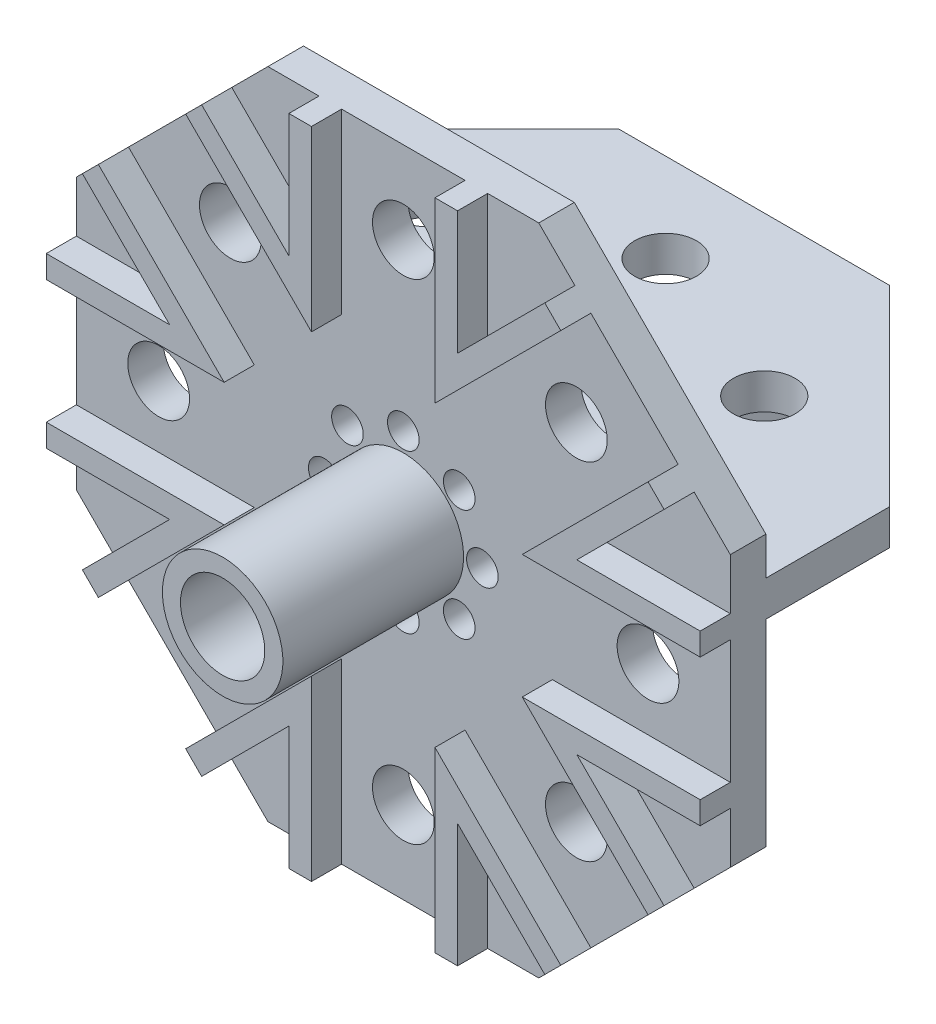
ISO-10303-21;
HEADER;
FILE_DESCRIPTION(('STEP AP214'),'2;1');
FILE_NAME('part.step','',(''),(''),'','','');
FILE_SCHEMA(('AUTOMOTIVE_DESIGN { 1 0 10303 214 1 1 1 1 }'));
ENDSEC;
DATA;
#1=APPLICATION_CONTEXT('core data for automotive mechanical design processes');
#2=APPLICATION_PROTOCOL_DEFINITION('international standard','automotive_design',2000,#1);
#3=PRODUCT_CONTEXT('',#1,'mechanical');
#4=PRODUCT('Part','Part','',(#3));
#5=PRODUCT_RELATED_PRODUCT_CATEGORY('part','',(#4));
#6=PRODUCT_DEFINITION_FORMATION('','',#4);
#7=PRODUCT_DEFINITION_CONTEXT('part definition',#1,'design');
#8=PRODUCT_DEFINITION('design','',#6,#7);
#9=PRODUCT_DEFINITION_SHAPE('','',#8);
#10=(LENGTH_UNIT() NAMED_UNIT(*) SI_UNIT(.MILLI.,.METRE.));
#11=(NAMED_UNIT(*) PLANE_ANGLE_UNIT() SI_UNIT($,.RADIAN.));
#12=(NAMED_UNIT(*) SI_UNIT($,.STERADIAN.) SOLID_ANGLE_UNIT());
#13=UNCERTAINTY_MEASURE_WITH_UNIT(LENGTH_MEASURE(1.E-05),#10,'distance_accuracy_value','');
#14=(GEOMETRIC_REPRESENTATION_CONTEXT(3) GLOBAL_UNCERTAINTY_ASSIGNED_CONTEXT((#13)) GLOBAL_UNIT_ASSIGNED_CONTEXT((#10,
#11,#12)) REPRESENTATION_CONTEXT('',''));
#15=CARTESIAN_POINT('',(0.,0.,0.));
#16=DIRECTION('',(0.,0.,1.));
#17=DIRECTION('',(1.,0.,0.));
#18=AXIS2_PLACEMENT_3D('',#15,#16,#17);
#19=CARTESIAN_POINT('',(-7.11199999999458,-16.1530610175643,5.54));
#20=DIRECTION('',(0.,1.,0.));
#21=DIRECTION('',(-1.,0.,0.));
#22=AXIS2_PLACEMENT_3D('',#19,#20,#21);
#23=PLANE('',#22);
#24=DIRECTION('',(1.,0.,0.));
#25=VECTOR('',#24,1.);
#26=CARTESIAN_POINT('',(-7.11199999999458,-16.1530610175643,3.));
#27=LINE('',#26,#25);
#28=CARTESIAN_POINT('',(-7.11199999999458,-16.1530610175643,3.));
#29=VERTEX_POINT('',#28);
#30=CARTESIAN_POINT('',(-5.20699999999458,-16.1530610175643,3.));
#31=VERTEX_POINT('',#30);
#32=EDGE_CURVE('E129',#29,#31,#27,.T.);
#33=ORIENTED_EDGE('',*,*,#32,.T.);
#34=DIRECTION('',(0.,0.,-1.));
#35=VECTOR('',#34,1.);
#36=CARTESIAN_POINT('',(-5.20699999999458,-16.1530610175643,5.54));
#37=LINE('',#36,#35);
#38=CARTESIAN_POINT('',(-5.20699999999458,-16.1530610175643,5.54));
#39=VERTEX_POINT('',#38);
#40=EDGE_CURVE('E12',#39,#31,#37,.T.);
#41=ORIENTED_EDGE('',*,*,#40,.F.);
#42=DIRECTION('',(1.,0.,0.));
#43=VECTOR('',#42,1.);
#44=CARTESIAN_POINT('',(-7.11199999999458,-16.1530610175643,5.54));
#45=LINE('',#44,#43);
#46=CARTESIAN_POINT('',(-7.11199999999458,-16.1530610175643,5.54));
#47=VERTEX_POINT('',#46);
#48=EDGE_CURVE('E139',#47,#39,#45,.T.);
#49=ORIENTED_EDGE('',*,*,#48,.F.);
#50=DIRECTION('',(0.,0.,-1.));
#51=VECTOR('',#50,1.);
#52=CARTESIAN_POINT('',(-7.11199999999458,-16.1530610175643,5.54));
#53=LINE('',#52,#51);
#54=EDGE_CURVE('E125',#47,#29,#53,.T.);
#55=ORIENTED_EDGE('',*,*,#54,.T.);
#56=EDGE_LOOP('',(#33,#41,#49,#55));
#57=FACE_BOUND('',#56,.T.);
#58=ADVANCED_FACE('F45',(#57),#23,.F.);
#59=CARTESIAN_POINT('',(-5.20699999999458,-16.1530610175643,5.54));
#60=DIRECTION('',(-1.,0.,0.));
#61=DIRECTION('',(0.,-1.,0.));
#62=AXIS2_PLACEMENT_3D('',#59,#60,#61);
#63=PLANE('',#62);
#64=DIRECTION('',(0.,1.,0.));
#65=VECTOR('',#64,1.);
#66=CARTESIAN_POINT('',(-5.20699999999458,-16.1530610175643,3.));
#67=LINE('',#66,#65);
#68=CARTESIAN_POINT('',(-5.20699999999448,-1.14887103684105,3.));
#69=VERTEX_POINT('',#68);
#70=EDGE_CURVE('E132',#31,#69,#67,.T.);
#71=ORIENTED_EDGE('',*,*,#70,.T.);
#72=DIRECTION('',(0.,0.,-1.));
#73=VECTOR('',#72,1.);
#74=CARTESIAN_POINT('',(-5.20699999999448,-1.14887103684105,5.54));
#75=LINE('',#74,#73);
#76=CARTESIAN_POINT('',(-5.20699999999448,-1.14887103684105,5.54));
#77=VERTEX_POINT('',#76);
#78=EDGE_CURVE('E53',#77,#69,#75,.T.);
#79=ORIENTED_EDGE('',*,*,#78,.F.);
#80=DIRECTION('',(0.,1.,0.));
#81=VECTOR('',#80,1.);
#82=CARTESIAN_POINT('',(-5.20699999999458,-16.1530610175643,5.54));
#83=LINE('',#82,#81);
#84=EDGE_CURVE('E98',#39,#77,#83,.T.);
#85=ORIENTED_EDGE('',*,*,#84,.F.);
#86=ORIENTED_EDGE('',*,*,#40,.T.);
#87=EDGE_LOOP('',(#71,#79,#85,#86));
#88=FACE_BOUND('',#87,.T.);
#89=ADVANCED_FACE('F163',(#88),#63,.F.);
#90=CARTESIAN_POINT('',(-5.20699999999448,-1.14887103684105,5.54));
#91=DIRECTION('',(0.707106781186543,-0.707106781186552,0.));
#92=DIRECTION('',(0.707106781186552,0.707106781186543,0.));
#93=AXIS2_PLACEMENT_3D('',#90,#91,#92);
#94=PLANE('',#93);
#95=DIRECTION('',(-0.707106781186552,-0.707106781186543,0.));
#96=VECTOR('',#95,1.);
#97=CARTESIAN_POINT('',(-5.20699999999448,-1.14887103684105,3.));
#98=LINE('',#97,#96);
#99=CARTESIAN_POINT('',(-15.8165644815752,-11.7584355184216,3.));
#100=VERTEX_POINT('',#99);
#101=EDGE_CURVE('E134',#69,#100,#98,.T.);
#102=ORIENTED_EDGE('',*,*,#101,.T.);
#103=DIRECTION('',(0.,0.,-1.));
#104=VECTOR('',#103,1.);
#105=CARTESIAN_POINT('',(-15.8165644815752,-11.7584355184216,5.54));
#106=LINE('',#105,#104);
#107=CARTESIAN_POINT('',(-15.8165644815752,-11.7584355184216,5.54));
#108=VERTEX_POINT('',#107);
#109=EDGE_CURVE('E120',#108,#100,#106,.T.);
#110=ORIENTED_EDGE('',*,*,#109,.F.);
#111=DIRECTION('',(-0.707106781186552,-0.707106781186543,0.));
#112=VECTOR('',#111,1.);
#113=CARTESIAN_POINT('',(-5.20699999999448,-1.14887103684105,5.54));
#114=LINE('',#113,#112);
#115=EDGE_CURVE('E111',#77,#108,#114,.T.);
#116=ORIENTED_EDGE('',*,*,#115,.F.);
#117=ORIENTED_EDGE('',*,*,#78,.T.);
#118=EDGE_LOOP('',(#102,#110,#116,#117));
#119=FACE_BOUND('',#118,.T.);
#120=ADVANCED_FACE('F145',(#119),#94,.F.);
#121=CARTESIAN_POINT('',(-14.4695260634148,-13.105473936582,5.54));
#122=DIRECTION('',(0.707106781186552,0.707106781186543,0.));
#123=DIRECTION('',(-0.707106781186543,0.707106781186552,0.));
#124=AXIS2_PLACEMENT_3D('',#121,#122,#123);
#125=PLANE('',#124);
#126=DIRECTION('',(0.707106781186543,-0.707106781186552,0.));
#127=VECTOR('',#126,1.);
#128=CARTESIAN_POINT('',(-14.4695260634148,-13.105473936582,3.));
#129=LINE('',#128,#127);
#130=CARTESIAN_POINT('',(-14.4695260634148,-13.105473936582,3.));
#131=VERTEX_POINT('',#130);
#132=EDGE_CURVE('E119',#100,#131,#129,.T.);
#133=ORIENTED_EDGE('',*,*,#132,.T.);
#134=DIRECTION('',(0.,0.,-1.));
#135=VECTOR('',#134,1.);
#136=CARTESIAN_POINT('',(-14.4695260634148,-13.105473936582,5.54));
#137=LINE('',#136,#135);
#138=CARTESIAN_POINT('',(-14.4695260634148,-13.105473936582,5.54));
#139=VERTEX_POINT('',#138);
#140=EDGE_CURVE('E116',#139,#131,#137,.T.);
#141=ORIENTED_EDGE('',*,*,#140,.F.);
#142=DIRECTION('',(0.707106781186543,-0.707106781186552,0.));
#143=VECTOR('',#142,1.);
#144=CARTESIAN_POINT('',(-14.4695260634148,-13.105473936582,5.54));
#145=LINE('',#144,#143);
#146=EDGE_CURVE('E105',#108,#139,#145,.T.);
#147=ORIENTED_EDGE('',*,*,#146,.F.);
#148=ORIENTED_EDGE('',*,*,#109,.T.);
#149=EDGE_LOOP('',(#133,#141,#147,#148));
#150=FACE_BOUND('',#149,.T.);
#151=ADVANCED_FACE('F117',(#150),#125,.F.);
#152=CARTESIAN_POINT('',(-7.11199999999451,-5.74794787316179,5.54));
#153=DIRECTION('',(-0.707106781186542,0.707106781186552,0.));
#154=DIRECTION('',(-0.707106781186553,-0.707106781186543,0.));
#155=AXIS2_PLACEMENT_3D('',#152,#153,#154);
#156=PLANE('',#155);
#157=DIRECTION('',(0.707106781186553,0.707106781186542,0.));
#158=VECTOR('',#157,1.);
#159=CARTESIAN_POINT('',(-7.11199999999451,-5.74794787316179,3.));
#160=LINE('',#159,#158);
#161=CARTESIAN_POINT('',(-7.11199999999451,-5.74794787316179,3.));
#162=VERTEX_POINT('',#161);
#163=EDGE_CURVE('E84',#131,#162,#160,.T.);
#164=ORIENTED_EDGE('',*,*,#163,.T.);
#165=DIRECTION('',(0.,0.,-1.));
#166=VECTOR('',#165,1.);
#167=CARTESIAN_POINT('',(-7.11199999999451,-5.74794787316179,5.54));
#168=LINE('',#167,#166);
#169=CARTESIAN_POINT('',(-7.11199999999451,-5.74794787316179,5.54));
#170=VERTEX_POINT('',#169);
#171=EDGE_CURVE('E121',#170,#162,#168,.T.);
#172=ORIENTED_EDGE('',*,*,#171,.F.);
#173=DIRECTION('',(0.707106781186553,0.707106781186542,0.));
#174=VECTOR('',#173,1.);
#175=CARTESIAN_POINT('',(-7.11199999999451,-5.74794787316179,5.54));
#176=LINE('',#175,#174);
#177=EDGE_CURVE('E109',#139,#170,#176,.T.);
#178=ORIENTED_EDGE('',*,*,#177,.F.);
#179=ORIENTED_EDGE('',*,*,#140,.T.);
#180=EDGE_LOOP('',(#164,#172,#178,#179));
#181=FACE_BOUND('',#180,.T.);
#182=ADVANCED_FACE('F123',(#181),#156,.F.);
#183=CARTESIAN_POINT('',(-7.11199999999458,-16.1530610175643,5.54));
#184=DIRECTION('',(1.,0.,0.));
#185=DIRECTION('',(0.,1.,0.));
#186=AXIS2_PLACEMENT_3D('',#183,#184,#185);
#187=PLANE('',#186);
#188=DIRECTION('',(0.,-1.,0.));
#189=VECTOR('',#188,1.);
#190=CARTESIAN_POINT('',(-7.11199999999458,-16.1530610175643,3.));
#191=LINE('',#190,#189);
#192=EDGE_CURVE('E90',#162,#29,#191,.T.);
#193=ORIENTED_EDGE('',*,*,#192,.T.);
#194=ORIENTED_EDGE('',*,*,#54,.F.);
#195=DIRECTION('',(0.,-1.,0.));
#196=VECTOR('',#195,1.);
#197=CARTESIAN_POINT('',(-7.11199999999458,-16.1530610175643,5.54));
#198=LINE('',#197,#196);
#199=EDGE_CURVE('E61',#170,#47,#198,.T.);
#200=ORIENTED_EDGE('',*,*,#199,.F.);
#201=ORIENTED_EDGE('',*,*,#171,.T.);
#202=EDGE_LOOP('',(#193,#194,#200,#201));
#203=FACE_BOUND('',#202,.T.);
#204=ADVANCED_FACE('F152',(#203),#187,.F.);
#205=CARTESIAN_POINT('',(0.,0.,5.54));
#206=DIRECTION('',(0.,0.,1.));
#207=DIRECTION('',(1.,0.,0.));
#208=AXIS2_PLACEMENT_3D('',#205,#206,#207);
#209=PLANE('',#208);
#210=ORIENTED_EDGE('',*,*,#48,.T.);
#211=ORIENTED_EDGE('',*,*,#84,.T.);
#212=ORIENTED_EDGE('',*,*,#115,.T.);
#213=ORIENTED_EDGE('',*,*,#146,.T.);
#214=ORIENTED_EDGE('',*,*,#177,.T.);
#215=ORIENTED_EDGE('',*,*,#199,.T.);
#216=EDGE_LOOP('',(#210,#211,#212,#213,#214,#215));
#217=FACE_BOUND('',#216,.T.);
#218=ADVANCED_FACE('F107',(#217),#209,.T.);
#219=CARTESIAN_POINT('',(0.,0.,3.));
#220=DIRECTION('',(0.,0.,1.));
#221=DIRECTION('',(1.,0.,0.));
#222=AXIS2_PLACEMENT_3D('',#219,#220,#221);
#223=PLANE('',#222);
#224=ORIENTED_EDGE('',*,*,#32,.F.);
#225=ORIENTED_EDGE('',*,*,#192,.F.);
#226=ORIENTED_EDGE('',*,*,#163,.F.);
#227=ORIENTED_EDGE('',*,*,#132,.F.);
#228=ORIENTED_EDGE('',*,*,#101,.F.);
#229=ORIENTED_EDGE('',*,*,#70,.F.);
#230=EDGE_LOOP('',(#224,#225,#226,#227,#228,#229));
#231=FACE_BOUND('',#230,.T.);
#232=ADVANCED_FACE('F148',(#231),#223,.F.);
#233=CLOSED_SHELL('',(#58,#89,#120,#151,#182,#204,#218,#232));
#234=MANIFOLD_SOLID_BREP('B2',#233);
#235=CARTESIAN_POINT('',(14.4695260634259,-13.1054739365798,5.54));
#236=DIRECTION('',(-0.707106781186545,0.70710678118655,0.));
#237=DIRECTION('',(-0.70710678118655,-0.707106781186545,0.));
#238=AXIS2_PLACEMENT_3D('',#235,#236,#237);
#239=PLANE('',#238);
#240=DIRECTION('',(0.70710678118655,0.707106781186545,0.));
#241=VECTOR('',#240,1.);
#242=CARTESIAN_POINT('',(14.4695260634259,-13.1054739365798,3.));
#243=LINE('',#242,#241);
#244=CARTESIAN_POINT('',(14.4695260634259,-13.1054739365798,3.));
#245=VERTEX_POINT('',#244);
#246=CARTESIAN_POINT('',(15.8165644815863,-11.7584355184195,3.));
#247=VERTEX_POINT('',#246);
#248=EDGE_CURVE('E313',#245,#247,#243,.T.);
#249=ORIENTED_EDGE('',*,*,#248,.T.);
#250=DIRECTION('',(0.,0.,-1.));
#251=VECTOR('',#250,1.);
#252=CARTESIAN_POINT('',(15.8165644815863,-11.7584355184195,5.54));
#253=LINE('',#252,#251);
#254=CARTESIAN_POINT('',(15.8165644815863,-11.7584355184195,5.54));
#255=VERTEX_POINT('',#254);
#256=EDGE_CURVE('E43',#255,#247,#253,.T.);
#257=ORIENTED_EDGE('',*,*,#256,.F.);
#258=DIRECTION('',(0.70710678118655,0.707106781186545,0.));
#259=VECTOR('',#258,1.);
#260=CARTESIAN_POINT('',(14.4695260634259,-13.1054739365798,5.54));
#261=LINE('',#260,#259);
#262=CARTESIAN_POINT('',(14.4695260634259,-13.1054739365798,5.54));
#263=VERTEX_POINT('',#262);
#264=EDGE_CURVE('E323',#263,#255,#261,.T.);
#265=ORIENTED_EDGE('',*,*,#264,.F.);
#266=DIRECTION('',(0.,0.,-1.));
#267=VECTOR('',#266,1.);
#268=CARTESIAN_POINT('',(14.4695260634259,-13.1054739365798,5.54));
#269=LINE('',#268,#267);
#270=EDGE_CURVE('E309',#263,#245,#269,.T.);
#271=ORIENTED_EDGE('',*,*,#270,.T.);
#272=EDGE_LOOP('',(#249,#257,#265,#271));
#273=FACE_BOUND('',#272,.T.);
#274=ADVANCED_FACE('F229',(#273),#239,.F.);
#275=CARTESIAN_POINT('',(15.8165644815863,-11.7584355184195,5.54));
#276=DIRECTION('',(-0.707106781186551,-0.707106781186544,0.));
#277=DIRECTION('',(0.707106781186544,-0.707106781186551,0.));
#278=AXIS2_PLACEMENT_3D('',#275,#276,#277);
#279=PLANE('',#278);
#280=DIRECTION('',(-0.707106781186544,0.707106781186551,0.));
#281=VECTOR('',#280,1.);
#282=CARTESIAN_POINT('',(15.8165644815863,-11.7584355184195,3.));
#283=LINE('',#282,#281);
#284=CARTESIAN_POINT('',(5.20700000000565,-1.14887103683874,3.));
#285=VERTEX_POINT('',#284);
#286=EDGE_CURVE('E316',#247,#285,#283,.T.);
#287=ORIENTED_EDGE('',*,*,#286,.T.);
#288=DIRECTION('',(0.,0.,-1.));
#289=VECTOR('',#288,1.);
#290=CARTESIAN_POINT('',(5.20700000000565,-1.14887103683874,5.54));
#291=LINE('',#290,#289);
#292=CARTESIAN_POINT('',(5.20700000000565,-1.14887103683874,5.54));
#293=VERTEX_POINT('',#292);
#294=EDGE_CURVE('E237',#293,#285,#291,.T.);
#295=ORIENTED_EDGE('',*,*,#294,.F.);
#296=DIRECTION('',(-0.707106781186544,0.707106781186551,0.));
#297=VECTOR('',#296,1.);
#298=CARTESIAN_POINT('',(15.8165644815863,-11.7584355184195,5.54));
#299=LINE('',#298,#297);
#300=EDGE_CURVE('E282',#255,#293,#299,.T.);
#301=ORIENTED_EDGE('',*,*,#300,.F.);
#302=ORIENTED_EDGE('',*,*,#256,.T.);
#303=EDGE_LOOP('',(#287,#295,#301,#302));
#304=FACE_BOUND('',#303,.T.);
#305=ADVANCED_FACE('F347',(#304),#279,.F.);
#306=CARTESIAN_POINT('',(5.20700000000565,-1.14887103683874,5.54));
#307=DIRECTION('',(1.,0.,0.));
#308=DIRECTION('',(0.,1.,0.));
#309=AXIS2_PLACEMENT_3D('',#306,#307,#308);
#310=PLANE('',#309);
#311=DIRECTION('',(0.,-1.,0.));
#312=VECTOR('',#311,1.);
#313=CARTESIAN_POINT('',(5.20700000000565,-1.14887103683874,3.));
#314=LINE('',#313,#312);
#315=CARTESIAN_POINT('',(5.20700000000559,-16.153061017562,3.));
#316=VERTEX_POINT('',#315);
#317=EDGE_CURVE('E318',#285,#316,#314,.T.);
#318=ORIENTED_EDGE('',*,*,#317,.T.);
#319=DIRECTION('',(0.,0.,-1.));
#320=VECTOR('',#319,1.);
#321=CARTESIAN_POINT('',(5.20700000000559,-16.153061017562,5.54));
#322=LINE('',#321,#320);
#323=CARTESIAN_POINT('',(5.20700000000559,-16.153061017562,5.54));
#324=VERTEX_POINT('',#323);
#325=EDGE_CURVE('E304',#324,#316,#322,.T.);
#326=ORIENTED_EDGE('',*,*,#325,.F.);
#327=DIRECTION('',(0.,-1.,0.));
#328=VECTOR('',#327,1.);
#329=CARTESIAN_POINT('',(5.20700000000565,-1.14887103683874,5.54));
#330=LINE('',#329,#328);
#331=EDGE_CURVE('E295',#293,#324,#330,.T.);
#332=ORIENTED_EDGE('',*,*,#331,.F.);
#333=ORIENTED_EDGE('',*,*,#294,.T.);
#334=EDGE_LOOP('',(#318,#326,#332,#333));
#335=FACE_BOUND('',#334,.T.);
#336=ADVANCED_FACE('F329',(#335),#310,.F.);
#337=CARTESIAN_POINT('',(7.11200000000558,-16.153061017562,5.54));
#338=DIRECTION('',(0.,1.,0.));
#339=DIRECTION('',(-1.,0.,0.));
#340=AXIS2_PLACEMENT_3D('',#337,#338,#339);
#341=PLANE('',#340);
#342=DIRECTION('',(1.,0.,0.));
#343=VECTOR('',#342,1.);
#344=CARTESIAN_POINT('',(7.11200000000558,-16.153061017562,3.));
#345=LINE('',#344,#343);
#346=CARTESIAN_POINT('',(7.11200000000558,-16.153061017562,3.));
#347=VERTEX_POINT('',#346);
#348=EDGE_CURVE('E303',#316,#347,#345,.T.);
#349=ORIENTED_EDGE('',*,*,#348,.T.);
#350=DIRECTION('',(0.,0.,-1.));
#351=VECTOR('',#350,1.);
#352=CARTESIAN_POINT('',(7.11200000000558,-16.153061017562,5.54));
#353=LINE('',#352,#351);
#354=CARTESIAN_POINT('',(7.11200000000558,-16.153061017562,5.54));
#355=VERTEX_POINT('',#354);
#356=EDGE_CURVE('E300',#355,#347,#353,.T.);
#357=ORIENTED_EDGE('',*,*,#356,.F.);
#358=DIRECTION('',(1.,0.,0.));
#359=VECTOR('',#358,1.);
#360=CARTESIAN_POINT('',(7.11200000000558,-16.153061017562,5.54));
#361=LINE('',#360,#359);
#362=EDGE_CURVE('E289',#324,#355,#361,.T.);
#363=ORIENTED_EDGE('',*,*,#362,.F.);
#364=ORIENTED_EDGE('',*,*,#325,.T.);
#365=EDGE_LOOP('',(#349,#357,#363,#364));
#366=FACE_BOUND('',#365,.T.);
#367=ADVANCED_FACE('F301',(#366),#341,.F.);
#368=CARTESIAN_POINT('',(7.11200000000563,-5.7479478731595,5.54));
#369=DIRECTION('',(-1.,0.,0.));
#370=DIRECTION('',(0.,-1.,0.));
#371=AXIS2_PLACEMENT_3D('',#368,#369,#370);
#372=PLANE('',#371);
#373=DIRECTION('',(0.,1.,0.));
#374=VECTOR('',#373,1.);
#375=CARTESIAN_POINT('',(7.11200000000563,-5.7479478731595,3.));
#376=LINE('',#375,#374);
#377=CARTESIAN_POINT('',(7.11200000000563,-5.7479478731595,3.));
#378=VERTEX_POINT('',#377);
#379=EDGE_CURVE('E268',#347,#378,#376,.T.);
#380=ORIENTED_EDGE('',*,*,#379,.T.);
#381=DIRECTION('',(0.,0.,-1.));
#382=VECTOR('',#381,1.);
#383=CARTESIAN_POINT('',(7.11200000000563,-5.7479478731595,5.54));
#384=LINE('',#383,#382);
#385=CARTESIAN_POINT('',(7.11200000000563,-5.7479478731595,5.54));
#386=VERTEX_POINT('',#385);
#387=EDGE_CURVE('E305',#386,#378,#384,.T.);
#388=ORIENTED_EDGE('',*,*,#387,.F.);
#389=DIRECTION('',(0.,1.,0.));
#390=VECTOR('',#389,1.);
#391=CARTESIAN_POINT('',(7.11200000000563,-5.7479478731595,5.54));
#392=LINE('',#391,#390);
#393=EDGE_CURVE('E293',#355,#386,#392,.T.);
#394=ORIENTED_EDGE('',*,*,#393,.F.);
#395=ORIENTED_EDGE('',*,*,#356,.T.);
#396=EDGE_LOOP('',(#380,#388,#394,#395));
#397=FACE_BOUND('',#396,.T.);
#398=ADVANCED_FACE('F307',(#397),#372,.F.);
#399=CARTESIAN_POINT('',(14.4695260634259,-13.1054739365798,5.54));
#400=DIRECTION('',(0.707106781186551,0.707106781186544,0.));
#401=DIRECTION('',(-0.707106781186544,0.707106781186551,0.));
#402=AXIS2_PLACEMENT_3D('',#399,#400,#401);
#403=PLANE('',#402);
#404=DIRECTION('',(0.707106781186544,-0.707106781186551,0.));
#405=VECTOR('',#404,1.);
#406=CARTESIAN_POINT('',(14.4695260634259,-13.1054739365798,3.));
#407=LINE('',#406,#405);
#408=EDGE_CURVE('E274',#378,#245,#407,.T.);
#409=ORIENTED_EDGE('',*,*,#408,.T.);
#410=ORIENTED_EDGE('',*,*,#270,.F.);
#411=DIRECTION('',(0.707106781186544,-0.707106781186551,0.));
#412=VECTOR('',#411,1.);
#413=CARTESIAN_POINT('',(14.4695260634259,-13.1054739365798,5.54));
#414=LINE('',#413,#412);
#415=EDGE_CURVE('E245',#386,#263,#414,.T.);
#416=ORIENTED_EDGE('',*,*,#415,.F.);
#417=ORIENTED_EDGE('',*,*,#387,.T.);
#418=EDGE_LOOP('',(#409,#410,#416,#417));
#419=FACE_BOUND('',#418,.T.);
#420=ADVANCED_FACE('F336',(#419),#403,.F.);
#421=CARTESIAN_POINT('',(0.,0.,5.54));
#422=DIRECTION('',(0.,0.,1.));
#423=DIRECTION('',(1.,0.,0.));
#424=AXIS2_PLACEMENT_3D('',#421,#422,#423);
#425=PLANE('',#424);
#426=ORIENTED_EDGE('',*,*,#264,.T.);
#427=ORIENTED_EDGE('',*,*,#300,.T.);
#428=ORIENTED_EDGE('',*,*,#331,.T.);
#429=ORIENTED_EDGE('',*,*,#362,.T.);
#430=ORIENTED_EDGE('',*,*,#393,.T.);
#431=ORIENTED_EDGE('',*,*,#415,.T.);
#432=EDGE_LOOP('',(#426,#427,#428,#429,#430,#431));
#433=FACE_BOUND('',#432,.T.);
#434=ADVANCED_FACE('F291',(#433),#425,.T.);
#435=CARTESIAN_POINT('',(0.,0.,3.));
#436=DIRECTION('',(0.,0.,1.));
#437=DIRECTION('',(1.,0.,0.));
#438=AXIS2_PLACEMENT_3D('',#435,#436,#437);
#439=PLANE('',#438);
#440=ORIENTED_EDGE('',*,*,#248,.F.);
#441=ORIENTED_EDGE('',*,*,#408,.F.);
#442=ORIENTED_EDGE('',*,*,#379,.F.);
#443=ORIENTED_EDGE('',*,*,#348,.F.);
#444=ORIENTED_EDGE('',*,*,#317,.F.);
#445=ORIENTED_EDGE('',*,*,#286,.F.);
#446=EDGE_LOOP('',(#440,#441,#442,#443,#444,#445));
#447=FACE_BOUND('',#446,.T.);
#448=ADVANCED_FACE('F332',(#447),#439,.F.);
#449=CLOSED_SHELL('',(#274,#305,#336,#367,#398,#420,#434,#448));
#450=MANIFOLD_SOLID_BREP('B6',#449);
#451=CARTESIAN_POINT('',(27.575,16.6289389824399,-26.6));
#452=DIRECTION('',(0.,1.,0.));
#453=DIRECTION('',(0.,0.,1.));
#454=AXIS2_PLACEMENT_3D('',#451,#452,#453);
#455=PLANE('',#454);
#456=DIRECTION('',(0.707106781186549,0.,0.707106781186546));
#457=VECTOR('',#456,1.);
#458=CARTESIAN_POINT('',(-14.5791276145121,16.6289389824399,-23.4428113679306));
#459=LINE('',#458,#457);
#460=CARTESIAN_POINT('',(-14.5791276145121,16.6289389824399,-23.4428113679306));
#461=VERTEX_POINT('',#460);
#462=CARTESIAN_POINT('',(-6.95700000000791,16.6289389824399,-15.8206837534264));
#463=VERTEX_POINT('',#462);
#464=EDGE_CURVE('E881',#461,#463,#459,.T.);
#465=ORIENTED_EDGE('',*,*,#464,.F.);
#466=DIRECTION('',(0.707106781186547,0.,-0.707106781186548));
#467=VECTOR('',#466,1.);
#468=CARTESIAN_POINT('',(-19.0109694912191,16.6289389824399,-19.0109694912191));
#469=LINE('',#468,#467);
#470=CARTESIAN_POINT('',(-11.4219389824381,16.6289389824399,-26.6));
#471=VERTEX_POINT('',#470);
#472=EDGE_CURVE('E1044',#461,#471,#469,.T.);
#473=ORIENTED_EDGE('',*,*,#472,.T.);
#474=DIRECTION('',(-1.,0.,0.));
#475=VECTOR('',#474,1.);
#476=CARTESIAN_POINT('',(27.575,16.6289389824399,-26.6));
#477=LINE('',#476,#475);
#478=CARTESIAN_POINT('',(-6.95700000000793,16.6289389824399,-26.6));
#479=VERTEX_POINT('',#478);
#480=EDGE_CURVE('E1059',#479,#471,#477,.T.);
#481=ORIENTED_EDGE('',*,*,#480,.F.);
#482=DIRECTION('',(0.,0.,-1.));
#483=VECTOR('',#482,1.);
#484=CARTESIAN_POINT('',(-6.95700000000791,16.6289389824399,-15.8206837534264));
#485=LINE('',#484,#483);
#486=EDGE_CURVE('E421',#463,#479,#485,.T.);
#487=ORIENTED_EDGE('',*,*,#486,.F.);
#488=EDGE_LOOP('',(#465,#473,#481,#487));
#489=FACE_BOUND('',#488,.T.);
#490=ADVANCED_FACE('F404',(#489),#455,.F.);
#491=CARTESIAN_POINT('',(-4.32844004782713,16.6289389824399,-3.35344004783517));
#492=DIRECTION('',(0.,-1.,0.));
#493=DIRECTION('',(0.,0.,-1.));
#494=AXIS2_PLACEMENT_3D('',#491,#492,#493);
#495=CIRCLE('',#494,1.275);
#496=CARTESIAN_POINT('',(-4.32844004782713,16.6289389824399,-4.62844004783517));
#497=VERTEX_POINT('',#496);
#498=EDGE_CURVE('E2836',#497,#497,#495,.T.);
#499=ORIENTED_EDGE('',*,*,#498,.F.);
#500=EDGE_LOOP('',(#499));
#501=FACE_BOUND('',#500,.T.);
#502=CARTESIAN_POINT('',(4.32844004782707,16.6289389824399,-3.35344004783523));
#503=DIRECTION('',(0.,-1.,0.));
#504=DIRECTION('',(0.,0.,-1.));
#505=AXIS2_PLACEMENT_3D('',#502,#503,#504);
#506=CIRCLE('',#505,1.275);
#507=CARTESIAN_POINT('',(4.32844004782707,16.6289389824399,-4.62844004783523));
#508=VERTEX_POINT('',#507);
#509=EDGE_CURVE('E2845',#508,#508,#506,.T.);
#510=ORIENTED_EDGE('',*,*,#509,.F.);
#511=EDGE_LOOP('',(#510));
#512=FACE_BOUND('',#511,.T.);
#513=CARTESIAN_POINT('',(0.,16.6289389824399,-5.14633861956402));
#514=DIRECTION('',(0.,-1.,0.));
#515=DIRECTION('',(0.,0.,-1.));
#516=AXIS2_PLACEMENT_3D('',#513,#514,#515);
#517=CIRCLE('',#516,1.275);
#518=CARTESIAN_POINT('',(0.,16.6289389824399,-6.42133861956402));
#519=VERTEX_POINT('',#518);
#520=EDGE_CURVE('E1495',#519,#519,#517,.T.);
#521=ORIENTED_EDGE('',*,*,#520,.F.);
#522=EDGE_LOOP('',(#521));
#523=FACE_BOUND('',#522,.T.);
#524=CARTESIAN_POINT('',(0.,16.6289389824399,-19.116338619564));
#525=DIRECTION('',(0.,-1.,0.));
#526=DIRECTION('',(0.,0.,-1.));
#527=AXIS2_PLACEMENT_3D('',#524,#525,#526);
#528=CIRCLE('',#527,2.6035);
#529=CARTESIAN_POINT('',(0.,16.6289389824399,-21.719838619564));
#530=VERTEX_POINT('',#529);
#531=EDGE_CURVE('E1024',#530,#530,#528,.T.);
#532=ORIENTED_EDGE('',*,*,#531,.F.);
#533=EDGE_LOOP('',(#532));
#534=FACE_BOUND('',#533,.T.);
#535=CARTESIAN_POINT('',(14.2067217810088,16.6289389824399,-13.2317217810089));
#536=DIRECTION('',(0.,-1.,0.));
#537=DIRECTION('',(0.,0.,-1.));
#538=AXIS2_PLACEMENT_3D('',#535,#536,#537);
#539=CIRCLE('',#538,2.6035);
#540=CARTESIAN_POINT('',(14.2067217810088,16.6289389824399,-15.8352217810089));
#541=VERTEX_POINT('',#540);
#542=EDGE_CURVE('E1023',#541,#541,#539,.T.);
#543=ORIENTED_EDGE('',*,*,#542,.F.);
#544=EDGE_LOOP('',(#543));
#545=FACE_BOUND('',#544,.T.);
#546=CARTESIAN_POINT('',(-14.2067217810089,16.6289389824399,-13.2317217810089));
#547=DIRECTION('',(0.,-1.,0.));
#548=DIRECTION('',(0.,0.,-1.));
#549=AXIS2_PLACEMENT_3D('',#546,#547,#548);
#550=CIRCLE('',#549,2.6035);
#551=CARTESIAN_POINT('',(-14.2067217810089,16.6289389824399,-15.8352217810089));
#552=VERTEX_POINT('',#551);
#553=EDGE_CURVE('E1030',#552,#552,#550,.T.);
#554=ORIENTED_EDGE('',*,*,#553,.F.);
#555=EDGE_LOOP('',(#554));
#556=FACE_BOUND('',#555,.T.);
#557=DIRECTION('',(0.,0.,1.));
#558=VECTOR('',#557,1.);
#559=CARTESIAN_POINT('',(-5.2070000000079,16.6289389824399,-11.5958100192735));
#560=LINE('',#559,#558);
#561=CARTESIAN_POINT('',(-5.2070000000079,16.6289389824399,-26.6));
#562=VERTEX_POINT('',#561);
#563=CARTESIAN_POINT('',(-5.2070000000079,16.6289389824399,-11.5958100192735));
#564=VERTEX_POINT('',#563);
#565=EDGE_CURVE('E900',#562,#564,#560,.T.);
#566=ORIENTED_EDGE('',*,*,#565,.F.);
#567=CARTESIAN_POINT('',(5.207,16.6289389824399,-26.6));
#568=VERTEX_POINT('',#567);
#569=EDGE_CURVE('E1058',#568,#562,#477,.T.);
#570=ORIENTED_EDGE('',*,*,#569,.F.);
#571=DIRECTION('',(0.,0.,-1.));
#572=VECTOR('',#571,1.);
#573=CARTESIAN_POINT('',(5.207,16.6289389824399,-26.6));
#574=LINE('',#573,#572);
#575=CARTESIAN_POINT('',(5.207,16.6289389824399,-11.5958100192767));
#576=VERTEX_POINT('',#575);
#577=EDGE_CURVE('E985',#576,#568,#574,.T.);
#578=ORIENTED_EDGE('',*,*,#577,.F.);
#579=DIRECTION('',(-0.707106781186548,0.,0.707106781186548));
#580=VECTOR('',#579,1.);
#581=CARTESIAN_POINT('',(5.207,16.6289389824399,-11.5958100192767));
#582=LINE('',#581,#580);
#583=CARTESIAN_POINT('',(15.8165644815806,16.6289389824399,-22.2053745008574));
#584=VERTEX_POINT('',#583);
#585=EDGE_CURVE('E1001',#584,#576,#582,.T.);
#586=ORIENTED_EDGE('',*,*,#585,.F.);
#587=DIRECTION('',(0.707106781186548,0.,0.707106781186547));
#588=VECTOR('',#587,1.);
#589=CARTESIAN_POINT('',(19.010969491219,16.6289389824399,-19.010969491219));
#590=LINE('',#589,#588);
#591=CARTESIAN_POINT('',(23.1803745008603,16.6289389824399,-14.8415644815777));
#592=VERTEX_POINT('',#591);
#593=EDGE_CURVE('E1038',#584,#592,#590,.T.);
#594=ORIENTED_EDGE('',*,*,#593,.T.);
#595=DIRECTION('',(0.707106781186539,0.,-0.707106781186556));
#596=VECTOR('',#595,1.);
#597=CARTESIAN_POINT('',(23.180374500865,16.6289389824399,-14.8415644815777));
#598=LINE('',#597,#596);
#599=CARTESIAN_POINT('',(12.5708100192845,16.6289389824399,-4.23199999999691));
#600=VERTEX_POINT('',#599);
#601=EDGE_CURVE('E935',#600,#592,#598,.T.);
#602=ORIENTED_EDGE('',*,*,#601,.F.);
#603=DIRECTION('',(-0.707106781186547,0.,-0.707106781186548));
#604=VECTOR('',#603,1.);
#605=CARTESIAN_POINT('',(12.5708100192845,16.6289389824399,-4.23199999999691));
#606=LINE('',#605,#604);
#607=CARTESIAN_POINT('',(13.808246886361,16.6289389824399,-2.99456313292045));
#608=VERTEX_POINT('',#607);
#609=EDGE_CURVE('E920',#608,#600,#606,.T.);
#610=ORIENTED_EDGE('',*,*,#609,.F.);
#611=DIRECTION('',(-0.707106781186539,0.,0.707106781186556));
#612=VECTOR('',#611,1.);
#613=CARTESIAN_POINT('',(24.4178113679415,16.6289389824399,-13.6041276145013));
#614=LINE('',#613,#612);
#615=CARTESIAN_POINT('',(24.4178113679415,16.6289389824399,-13.6041276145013));
#616=VERTEX_POINT('',#615);
#617=EDGE_CURVE('E925',#616,#608,#614,.T.);
#618=ORIENTED_EDGE('',*,*,#617,.F.);
#619=CARTESIAN_POINT('',(27.575,16.6289389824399,-10.4469389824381));
#620=VERTEX_POINT('',#619);
#621=EDGE_CURVE('E1039',#616,#620,#590,.T.);
#622=ORIENTED_EDGE('',*,*,#621,.T.);
#623=DIRECTION('',(0.,0.,1.));
#624=VECTOR('',#623,1.);
#625=CARTESIAN_POINT('',(27.575,16.6289389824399,-26.6));
#626=LINE('',#625,#624);
#627=CARTESIAN_POINT('',(27.575,16.6289389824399,0.));
#628=VERTEX_POINT('',#627);
#629=EDGE_CURVE('E1073',#620,#628,#626,.T.);
#630=ORIENTED_EDGE('',*,*,#629,.T.);
#631=DIRECTION('',(-1.,0.,0.));
#632=VECTOR('',#631,1.);
#633=CARTESIAN_POINT('',(27.575,16.6289389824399,0.));
#634=LINE('',#633,#632);
#635=CARTESIAN_POINT('',(-27.575,16.6289389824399,0.));
#636=VERTEX_POINT('',#635);
#637=EDGE_CURVE('E1053',#628,#636,#634,.T.);
#638=ORIENTED_EDGE('',*,*,#637,.T.);
#639=DIRECTION('',(0.,0.,1.));
#640=VECTOR('',#639,1.);
#641=CARTESIAN_POINT('',(-27.575,16.6289389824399,-26.6));
#642=LINE('',#641,#640);
#643=CARTESIAN_POINT('',(-27.575,16.6289389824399,-10.4469389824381));
#644=VERTEX_POINT('',#643);
#645=EDGE_CURVE('E1071',#644,#636,#642,.T.);
#646=ORIENTED_EDGE('',*,*,#645,.F.);
#647=CARTESIAN_POINT('',(-24.417811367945,16.6289389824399,-13.6041276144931));
#648=VERTEX_POINT('',#647);
#649=EDGE_CURVE('E1045',#644,#648,#469,.T.);
#650=ORIENTED_EDGE('',*,*,#649,.T.);
#651=DIRECTION('',(-0.70710678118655,0.,-0.707106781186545));
#652=VECTOR('',#651,1.);
#653=CARTESIAN_POINT('',(-16.7956837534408,16.6289389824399,-5.98199999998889));
#654=LINE('',#653,#652);
#655=CARTESIAN_POINT('',(-13.8082468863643,16.6289389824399,-2.99456313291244));
#656=VERTEX_POINT('',#655);
#657=EDGE_CURVE('E951',#656,#648,#654,.T.);
#658=ORIENTED_EDGE('',*,*,#657,.F.);
#659=DIRECTION('',(-0.707106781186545,0.,0.70710678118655));
#660=VECTOR('',#659,1.);
#661=CARTESIAN_POINT('',(-12.5708100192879,16.6289389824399,-4.23199999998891));
#662=LINE('',#661,#660);
#663=CARTESIAN_POINT('',(-12.5708100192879,16.6289389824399,-4.23199999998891));
#664=VERTEX_POINT('',#663);
#665=EDGE_CURVE('E955',#664,#656,#662,.T.);
#666=ORIENTED_EDGE('',*,*,#665,.F.);
#667=DIRECTION('',(0.70710678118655,0.,0.707106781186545));
#668=VECTOR('',#667,1.);
#669=CARTESIAN_POINT('',(-12.5708100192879,16.6289389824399,-4.23199999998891));
#670=LINE('',#669,#668);
#671=CARTESIAN_POINT('',(-23.1803745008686,16.6289389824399,-14.8415644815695));
#672=VERTEX_POINT('',#671);
#673=EDGE_CURVE('E964',#672,#664,#670,.T.);
#674=ORIENTED_EDGE('',*,*,#673,.F.);
#675=CARTESIAN_POINT('',(-15.8165644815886,16.6289389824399,-22.2053745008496));
#676=VERTEX_POINT('',#675);
#677=EDGE_CURVE('E1048',#672,#676,#469,.T.);
#678=ORIENTED_EDGE('',*,*,#677,.T.);
#679=DIRECTION('',(-0.707106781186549,0.,-0.707106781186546));
#680=VECTOR('',#679,1.);
#681=CARTESIAN_POINT('',(-15.8165644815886,16.6289389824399,-22.2053745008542));
#682=LINE('',#681,#680);
#683=EDGE_CURVE('E429',#564,#676,#682,.T.);
#684=ORIENTED_EDGE('',*,*,#683,.F.);
#685=EDGE_LOOP('',(#566,#570,#578,#586,#594,#602,#610,#618,#622,#630,#638,#646,#650,#658,#666,
#674,#678,#684));
#686=FACE_BOUND('',#685,.T.);
#687=ADVANCED_FACE('F1542',(#501,#512,#523,#534,#545,#556,#686),#455,.F.);
#688=DIRECTION('',(0.,0.,1.));
#689=VECTOR('',#688,1.);
#690=CARTESIAN_POINT('',(6.957,16.6289389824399,-26.6));
#691=LINE('',#690,#689);
#692=CARTESIAN_POINT('',(6.957,16.6289389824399,-26.6));
#693=VERTEX_POINT('',#692);
#694=CARTESIAN_POINT('',(6.957,16.6289389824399,-15.8206837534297));
#695=VERTEX_POINT('',#694);
#696=EDGE_CURVE('E980',#693,#695,#691,.T.);
#697=ORIENTED_EDGE('',*,*,#696,.F.);
#698=CARTESIAN_POINT('',(11.421938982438,16.6289389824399,-26.6));
#699=VERTEX_POINT('',#698);
#700=EDGE_CURVE('E1054',#699,#693,#477,.T.);
#701=ORIENTED_EDGE('',*,*,#700,.F.);
#702=CARTESIAN_POINT('',(14.5791276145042,16.6289389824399,-23.4428113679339));
#703=VERTEX_POINT('',#702);
#704=EDGE_CURVE('E1035',#699,#703,#590,.T.);
#705=ORIENTED_EDGE('',*,*,#704,.T.);
#706=DIRECTION('',(0.707106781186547,0.,-0.707106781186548));
#707=VECTOR('',#706,1.);
#708=CARTESIAN_POINT('',(6.957,16.6289389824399,-15.8206837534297));
#709=LINE('',#708,#707);
#710=EDGE_CURVE('E998',#695,#703,#709,.T.);
#711=ORIENTED_EDGE('',*,*,#710,.F.);
#712=EDGE_LOOP('',(#697,#701,#705,#711));
#713=FACE_BOUND('',#712,.T.);
#714=ADVANCED_FACE('F1544',(#713),#455,.F.);
#715=CARTESIAN_POINT('',(27.575,19.6289389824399,-26.6));
#716=DIRECTION('',(0.,-1.,0.));
#717=DIRECTION('',(0.,0.,-1.));
#718=AXIS2_PLACEMENT_3D('',#715,#716,#717);
#719=PLANE('',#718);
#720=CARTESIAN_POINT('',(0.,19.6289389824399,-19.116338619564));
#721=DIRECTION('',(0.,-1.,0.));
#722=DIRECTION('',(0.,0.,-1.));
#723=AXIS2_PLACEMENT_3D('',#720,#721,#722);
#724=CIRCLE('',#723,2.6035);
#725=CARTESIAN_POINT('',(0.,19.6289389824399,-21.719838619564));
#726=VERTEX_POINT('',#725);
#727=EDGE_CURVE('E1034',#726,#726,#724,.T.);
#728=ORIENTED_EDGE('',*,*,#727,.T.);
#729=EDGE_LOOP('',(#728));
#730=FACE_BOUND('',#729,.T.);
#731=CARTESIAN_POINT('',(14.2067217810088,19.6289389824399,-13.2317217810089));
#732=DIRECTION('',(0.,-1.,0.));
#733=DIRECTION('',(0.,0.,-1.));
#734=AXIS2_PLACEMENT_3D('',#731,#732,#733);
#735=CIRCLE('',#734,2.6035);
#736=CARTESIAN_POINT('',(14.2067217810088,19.6289389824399,-15.8352217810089));
#737=VERTEX_POINT('',#736);
#738=EDGE_CURVE('E1027',#737,#737,#735,.T.);
#739=ORIENTED_EDGE('',*,*,#738,.T.);
#740=EDGE_LOOP('',(#739));
#741=FACE_BOUND('',#740,.T.);
#742=CARTESIAN_POINT('',(-14.2067217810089,19.6289389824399,-13.2317217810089));
#743=DIRECTION('',(0.,-1.,0.));
#744=DIRECTION('',(0.,0.,-1.));
#745=AXIS2_PLACEMENT_3D('',#742,#743,#744);
#746=CIRCLE('',#745,2.6035);
#747=CARTESIAN_POINT('',(-14.2067217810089,19.6289389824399,-15.8352217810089));
#748=VERTEX_POINT('',#747);
#749=EDGE_CURVE('E1033',#748,#748,#746,.T.);
#750=ORIENTED_EDGE('',*,*,#749,.T.);
#751=EDGE_LOOP('',(#750));
#752=FACE_BOUND('',#751,.T.);
#753=DIRECTION('',(0.707106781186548,0.,0.707106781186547));
#754=VECTOR('',#753,1.);
#755=CARTESIAN_POINT('',(19.498469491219,19.6289389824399,-18.523469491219));
#756=LINE('',#755,#754);
#757=CARTESIAN_POINT('',(11.421938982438,19.6289389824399,-26.6));
#758=VERTEX_POINT('',#757);
#759=CARTESIAN_POINT('',(27.575,19.6289389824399,-10.446938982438));
#760=VERTEX_POINT('',#759);
#761=EDGE_CURVE('E1042',#758,#760,#756,.T.);
#762=ORIENTED_EDGE('',*,*,#761,.F.);
#763=DIRECTION('',(1.,0.,0.));
#764=VECTOR('',#763,1.);
#765=CARTESIAN_POINT('',(27.575,19.6289389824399,-26.6));
#766=LINE('',#765,#764);
#767=CARTESIAN_POINT('',(-11.4219389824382,19.6289389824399,-26.6));
#768=VERTEX_POINT('',#767);
#769=EDGE_CURVE('E1057',#768,#758,#766,.T.);
#770=ORIENTED_EDGE('',*,*,#769,.F.);
#771=DIRECTION('',(0.707106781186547,0.,-0.707106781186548));
#772=VECTOR('',#771,1.);
#773=CARTESIAN_POINT('',(8.07653050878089,19.6289389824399,-46.0984694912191));
#774=LINE('',#773,#772);
#775=CARTESIAN_POINT('',(-27.575,19.6289389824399,-10.4469389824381));
#776=VERTEX_POINT('',#775);
#777=EDGE_CURVE('E1051',#776,#768,#774,.T.);
#778=ORIENTED_EDGE('',*,*,#777,.F.);
#779=DIRECTION('',(0.,0.,1.));
#780=VECTOR('',#779,1.);
#781=CARTESIAN_POINT('',(-27.575,19.6289389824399,-26.6));
#782=LINE('',#781,#780);
#783=CARTESIAN_POINT('',(-27.575,19.6289389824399,0.));
#784=VERTEX_POINT('',#783);
#785=EDGE_CURVE('E1069',#776,#784,#782,.T.);
#786=ORIENTED_EDGE('',*,*,#785,.T.);
#787=DIRECTION('',(1.,0.,0.));
#788=VECTOR('',#787,1.);
#789=CARTESIAN_POINT('',(27.575,19.6289389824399,0.));
#790=LINE('',#789,#788);
#791=CARTESIAN_POINT('',(27.575,19.6289389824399,0.));
#792=VERTEX_POINT('',#791);
#793=EDGE_CURVE('E1065',#784,#792,#790,.T.);
#794=ORIENTED_EDGE('',*,*,#793,.T.);
#795=DIRECTION('',(0.,0.,1.));
#796=VECTOR('',#795,1.);
#797=CARTESIAN_POINT('',(27.575,19.6289389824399,-26.6));
#798=LINE('',#797,#796);
#799=EDGE_CURVE('E1062',#760,#792,#798,.T.);
#800=ORIENTED_EDGE('',*,*,#799,.F.);
#801=EDGE_LOOP('',(#762,#770,#778,#786,#794,#800));
#802=FACE_BOUND('',#801,.T.);
#803=ADVANCED_FACE('F1553',(#730,#741,#752,#802),#719,.F.);
#804=CARTESIAN_POINT('',(0.,0.,-26.6));
#805=DIRECTION('',(0.,0.,1.));
#806=DIRECTION('',(1.,0.,0.));
#807=AXIS2_PLACEMENT_3D('',#804,#805,#806);
#808=PLANE('',#807);
#809=DIRECTION('',(0.,-1.,0.));
#810=VECTOR('',#809,1.);
#811=CARTESIAN_POINT('',(11.421938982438,38.9969389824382,-26.6));
#812=LINE('',#811,#810);
#813=EDGE_CURVE('E1037',#758,#699,#812,.T.);
#814=ORIENTED_EDGE('',*,*,#813,.T.);
#815=ORIENTED_EDGE('',*,*,#700,.T.);
#816=DIRECTION('',(0.,1.,0.));
#817=VECTOR('',#816,1.);
#818=CARTESIAN_POINT('',(6.957,14.0889389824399,-26.6));
#819=LINE('',#818,#817);
#820=CARTESIAN_POINT('',(6.957,14.0889389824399,-26.6));
#821=VERTEX_POINT('',#820);
#822=EDGE_CURVE('E1020',#821,#693,#819,.T.);
#823=ORIENTED_EDGE('',*,*,#822,.F.);
#824=DIRECTION('',(1.,0.,0.));
#825=VECTOR('',#824,1.);
#826=CARTESIAN_POINT('',(5.207,14.0889389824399,-26.6));
#827=LINE('',#826,#825);
#828=CARTESIAN_POINT('',(5.207,14.0889389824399,-26.6));
#829=VERTEX_POINT('',#828);
#830=EDGE_CURVE('E981',#829,#821,#827,.T.);
#831=ORIENTED_EDGE('',*,*,#830,.F.);
#832=DIRECTION('',(0.,1.,0.));
#833=VECTOR('',#832,1.);
#834=CARTESIAN_POINT('',(5.207,14.0889389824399,-26.6));
#835=LINE('',#834,#833);
#836=EDGE_CURVE('E995',#829,#568,#835,.T.);
#837=ORIENTED_EDGE('',*,*,#836,.T.);
#838=ORIENTED_EDGE('',*,*,#569,.T.);
#839=DIRECTION('',(0.,1.,0.));
#840=VECTOR('',#839,1.);
#841=CARTESIAN_POINT('',(-5.20700000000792,14.0889389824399,-26.5999999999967));
#842=LINE('',#841,#840);
#843=CARTESIAN_POINT('',(-5.20700000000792,14.0889389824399,-26.5999999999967));
#844=VERTEX_POINT('',#843);
#845=EDGE_CURVE('E908',#844,#562,#842,.T.);
#846=ORIENTED_EDGE('',*,*,#845,.F.);
#847=DIRECTION('',(1.,0.,0.));
#848=VECTOR('',#847,1.);
#849=CARTESIAN_POINT('',(-6.95700000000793,14.0889389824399,-26.5999999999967));
#850=LINE('',#849,#848);
#851=CARTESIAN_POINT('',(-6.95700000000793,14.0889389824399,-26.5999999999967));
#852=VERTEX_POINT('',#851);
#853=EDGE_CURVE('E891',#852,#844,#850,.T.);
#854=ORIENTED_EDGE('',*,*,#853,.F.);
#855=DIRECTION('',(0.,1.,0.));
#856=VECTOR('',#855,1.);
#857=CARTESIAN_POINT('',(-6.95700000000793,14.0889389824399,-26.5999999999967));
#858=LINE('',#857,#856);
#859=EDGE_CURVE('E911',#852,#479,#858,.T.);
#860=ORIENTED_EDGE('',*,*,#859,.T.);
#861=ORIENTED_EDGE('',*,*,#480,.T.);
#862=DIRECTION('',(0.,-1.,0.));
#863=VECTOR('',#862,1.);
#864=CARTESIAN_POINT('',(-11.4219389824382,0.,-26.6));
#865=LINE('',#864,#863);
#866=EDGE_CURVE('E413',#768,#471,#865,.T.);
#867=ORIENTED_EDGE('',*,*,#866,.F.);
#868=ORIENTED_EDGE('',*,*,#769,.T.);
#869=EDGE_LOOP('',(#814,#815,#823,#831,#837,#838,#846,#854,#860,#861,#867,#868));
#870=FACE_BOUND('',#869,.T.);
#871=ADVANCED_FACE('F1558',(#870),#808,.F.);
#872=CARTESIAN_POINT('',(27.575,22.8438779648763,3.));
#873=DIRECTION('',(-1.,0.,0.));
#874=DIRECTION('',(0.,-1.,0.));
#875=AXIS2_PLACEMENT_3D('',#872,#873,#874);
#876=PLANE('',#875);
#877=DIRECTION('',(0.,-1.,0.));
#878=VECTOR('',#877,1.);
#879=CARTESIAN_POINT('',(27.575,22.8438779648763,-10.446938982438));
#880=LINE('',#879,#878);
#881=EDGE_CURVE('E227',#760,#620,#880,.T.);
#882=ORIENTED_EDGE('',*,*,#881,.F.);
#883=ORIENTED_EDGE('',*,*,#799,.T.);
#884=DIRECTION('',(0.,1.,0.));
#885=VECTOR('',#884,1.);
#886=CARTESIAN_POINT('',(27.575,22.8438779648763,0.));
#887=LINE('',#886,#885);
#888=CARTESIAN_POINT('',(27.575,22.8438779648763,0.));
#889=VERTEX_POINT('',#888);
#890=EDGE_CURVE('E1428',#792,#889,#887,.T.);
#891=ORIENTED_EDGE('',*,*,#890,.T.);
#892=DIRECTION('',(0.,0.,-1.));
#893=VECTOR('',#892,1.);
#894=CARTESIAN_POINT('',(27.575,22.8438779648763,3.));
#895=LINE('',#894,#893);
#896=CARTESIAN_POINT('',(27.575,22.8438779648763,3.));
#897=VERTEX_POINT('',#896);
#898=EDGE_CURVE('E1446',#897,#889,#895,.T.);
#899=ORIENTED_EDGE('',*,*,#898,.F.);
#900=DIRECTION('',(0.,1.,0.));
#901=VECTOR('',#900,1.);
#902=CARTESIAN_POINT('',(27.575,22.8438779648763,3.));
#903=LINE('',#902,#901);
#904=CARTESIAN_POINT('',(27.575,18.5339389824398,3.));
#905=VERTEX_POINT('',#904);
#906=EDGE_CURVE('E1406',#905,#897,#903,.T.);
#907=ORIENTED_EDGE('',*,*,#906,.F.);
#908=DIRECTION('',(0.,0.,-1.));
#909=VECTOR('',#908,1.);
#910=CARTESIAN_POINT('',(27.5750000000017,18.5339389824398,5.54));
#911=LINE('',#910,#909);
#912=CARTESIAN_POINT('',(27.5750000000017,18.5339389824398,5.54));
#913=VERTEX_POINT('',#912);
#914=EDGE_CURVE('E1273',#913,#905,#911,.T.);
#915=ORIENTED_EDGE('',*,*,#914,.F.);
#916=DIRECTION('',(0.,1.,0.));
#917=VECTOR('',#916,1.);
#918=CARTESIAN_POINT('',(27.5750000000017,18.5339389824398,5.54));
#919=LINE('',#918,#917);
#920=CARTESIAN_POINT('',(27.5750000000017,16.6289389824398,5.54));
#921=VERTEX_POINT('',#920);
#922=EDGE_CURVE('E1251',#921,#913,#919,.T.);
#923=ORIENTED_EDGE('',*,*,#922,.F.);
#924=DIRECTION('',(0.,0.,-1.));
#925=VECTOR('',#924,1.);
#926=CARTESIAN_POINT('',(27.5750000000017,16.6289389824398,5.54));
#927=LINE('',#926,#925);
#928=CARTESIAN_POINT('',(27.575,16.6289389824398,3.));
#929=VERTEX_POINT('',#928);
#930=EDGE_CURVE('E1276',#921,#929,#927,.T.);
#931=ORIENTED_EDGE('',*,*,#930,.T.);
#932=CARTESIAN_POINT('',(27.5750000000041,6.21493898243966,3.));
#933=VERTEX_POINT('',#932);
#934=EDGE_CURVE('E1412',#933,#929,#903,.T.);
#935=ORIENTED_EDGE('',*,*,#934,.F.);
#936=DIRECTION('',(0.,0.,-1.));
#937=VECTOR('',#936,1.);
#938=CARTESIAN_POINT('',(27.5750000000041,6.21493898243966,5.54));
#939=LINE('',#938,#937);
#940=CARTESIAN_POINT('',(27.5750000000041,6.21493898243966,5.54));
#941=VERTEX_POINT('',#940);
#942=EDGE_CURVE('E1239',#941,#933,#939,.T.);
#943=ORIENTED_EDGE('',*,*,#942,.F.);
#944=DIRECTION('',(0.,1.,0.));
#945=VECTOR('',#944,1.);
#946=CARTESIAN_POINT('',(27.575000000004,4.30993898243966,5.54));
#947=LINE('',#946,#945);
#948=CARTESIAN_POINT('',(27.575000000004,4.30993898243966,5.54));
#949=VERTEX_POINT('',#948);
#950=EDGE_CURVE('E1202',#949,#941,#947,.T.);
#951=ORIENTED_EDGE('',*,*,#950,.F.);
#952=DIRECTION('',(0.,0.,-1.));
#953=VECTOR('',#952,1.);
#954=CARTESIAN_POINT('',(27.575000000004,4.30993898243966,5.54));
#955=LINE('',#954,#953);
#956=CARTESIAN_POINT('',(27.575,4.30993898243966,3.));
#957=VERTEX_POINT('',#956);
#958=EDGE_CURVE('E1216',#949,#957,#955,.T.);
#959=ORIENTED_EDGE('',*,*,#958,.T.);
#960=CARTESIAN_POINT('',(27.575,0.,3.));
#961=VERTEX_POINT('',#960);
#962=EDGE_CURVE('E1409',#961,#957,#903,.T.);
#963=ORIENTED_EDGE('',*,*,#962,.F.);
#964=DIRECTION('',(0.,0.,-1.));
#965=VECTOR('',#964,1.);
#966=CARTESIAN_POINT('',(27.575,0.,3.));
#967=LINE('',#966,#965);
#968=CARTESIAN_POINT('',(27.575,0.,0.));
#969=VERTEX_POINT('',#968);
#970=EDGE_CURVE('E1449',#961,#969,#967,.T.);
#971=ORIENTED_EDGE('',*,*,#970,.T.);
#972=EDGE_CURVE('E1429',#969,#628,#887,.T.);
#973=ORIENTED_EDGE('',*,*,#972,.T.);
#974=ORIENTED_EDGE('',*,*,#629,.F.);
#975=EDGE_LOOP('',(#882,#883,#891,#899,#907,#915,#923,#931,#935,#943,#951,#959,#963,#971,#973,#974));
#976=FACE_BOUND('',#975,.T.);
#977=ADVANCED_FACE('F1594',(#976),#876,.F.);
#978=CARTESIAN_POINT('',(-27.575,0.,3.));
#979=DIRECTION('',(1.,0.,0.));
#980=DIRECTION('',(0.,1.,0.));
#981=AXIS2_PLACEMENT_3D('',#978,#979,#980);
#982=PLANE('',#981);
#983=DIRECTION('',(0.,-1.,0.));
#984=VECTOR('',#983,1.);
#985=CARTESIAN_POINT('',(-27.575,38.9969389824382,-10.4469389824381));
#986=LINE('',#985,#984);
#987=EDGE_CURVE('E1047',#776,#644,#986,.T.);
#988=ORIENTED_EDGE('',*,*,#987,.T.);
#989=ORIENTED_EDGE('',*,*,#645,.T.);
#990=DIRECTION('',(0.,-1.,0.));
#991=VECTOR('',#990,1.);
#992=CARTESIAN_POINT('',(-27.575,0.,0.));
#993=LINE('',#992,#991);
#994=CARTESIAN_POINT('',(-27.575,0.,0.));
#995=VERTEX_POINT('',#994);
#996=EDGE_CURVE('E1403',#636,#995,#993,.T.);
#997=ORIENTED_EDGE('',*,*,#996,.T.);
#998=DIRECTION('',(0.,0.,-1.));
#999=VECTOR('',#998,1.);
#1000=CARTESIAN_POINT('',(-27.575,0.,3.));
#1001=LINE('',#1000,#999);
#1002=CARTESIAN_POINT('',(-27.575,0.,3.));
#1003=VERTEX_POINT('',#1002);
#1004=EDGE_CURVE('E870',#1003,#995,#1001,.T.);
#1005=ORIENTED_EDGE('',*,*,#1004,.F.);
#1006=DIRECTION('',(0.,-1.,0.));
#1007=VECTOR('',#1006,1.);
#1008=CARTESIAN_POINT('',(-27.575,0.,3.));
#1009=LINE('',#1008,#1007);
#1010=CARTESIAN_POINT('',(-27.575,4.30993898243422,3.));
#1011=VERTEX_POINT('',#1010);
#1012=EDGE_CURVE('E1408',#1011,#1003,#1009,.T.);
#1013=ORIENTED_EDGE('',*,*,#1012,.F.);
#1014=DIRECTION('',(0.,0.,-1.));
#1015=VECTOR('',#1014,1.);
#1016=CARTESIAN_POINT('',(-27.5749999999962,4.30993898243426,5.54));
#1017=LINE('',#1016,#1015);
#1018=CARTESIAN_POINT('',(-27.5749999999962,4.30993898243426,5.54));
#1019=VERTEX_POINT('',#1018);
#1020=EDGE_CURVE('E1189',#1019,#1011,#1017,.T.);
#1021=ORIENTED_EDGE('',*,*,#1020,.F.);
#1022=DIRECTION('',(0.,-1.,0.));
#1023=VECTOR('',#1022,1.);
#1024=CARTESIAN_POINT('',(-27.5749999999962,4.30993898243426,5.54));
#1025=LINE('',#1024,#1023);
#1026=CARTESIAN_POINT('',(-27.5749999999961,6.21493898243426,5.54));
#1027=VERTEX_POINT('',#1026);
#1028=EDGE_CURVE('E1170',#1027,#1019,#1025,.T.);
#1029=ORIENTED_EDGE('',*,*,#1028,.F.);
#1030=DIRECTION('',(0.,0.,-1.));
#1031=VECTOR('',#1030,1.);
#1032=CARTESIAN_POINT('',(-27.5749999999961,6.21493898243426,5.54));
#1033=LINE('',#1032,#1031);
#1034=CARTESIAN_POINT('',(-27.575,6.21493898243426,3.));
#1035=VERTEX_POINT('',#1034);
#1036=EDGE_CURVE('E1192',#1027,#1035,#1033,.T.);
#1037=ORIENTED_EDGE('',*,*,#1036,.T.);
#1038=CARTESIAN_POINT('',(-27.575,16.6289389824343,3.));
#1039=VERTEX_POINT('',#1038);
#1040=EDGE_CURVE('E1407',#1039,#1035,#1009,.T.);
#1041=ORIENTED_EDGE('',*,*,#1040,.F.);
#1042=DIRECTION('',(0.,0.,-1.));
#1043=VECTOR('',#1042,1.);
#1044=CARTESIAN_POINT('',(-27.5749999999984,16.6289389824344,5.54));
#1045=LINE('',#1044,#1043);
#1046=CARTESIAN_POINT('',(-27.5749999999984,16.6289389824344,5.54));
#1047=VERTEX_POINT('',#1046);
#1048=EDGE_CURVE('E1158',#1047,#1039,#1045,.T.);
#1049=ORIENTED_EDGE('',*,*,#1048,.F.);
#1050=DIRECTION('',(0.,-1.,0.));
#1051=VECTOR('',#1050,1.);
#1052=CARTESIAN_POINT('',(-27.5749999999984,18.5339389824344,5.54));
#1053=LINE('',#1052,#1051);
#1054=CARTESIAN_POINT('',(-27.5749999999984,18.5339389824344,5.54));
#1055=VERTEX_POINT('',#1054);
#1056=EDGE_CURVE('E1119',#1055,#1047,#1053,.T.);
#1057=ORIENTED_EDGE('',*,*,#1056,.F.);
#1058=DIRECTION('',(0.,0.,-1.));
#1059=VECTOR('',#1058,1.);
#1060=CARTESIAN_POINT('',(-27.5749999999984,18.5339389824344,5.54));
#1061=LINE('',#1060,#1059);
#1062=CARTESIAN_POINT('',(-27.575,18.5339389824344,3.));
#1063=VERTEX_POINT('',#1062);
#1064=EDGE_CURVE('E1133',#1055,#1063,#1061,.T.);
#1065=ORIENTED_EDGE('',*,*,#1064,.T.);
#1066=CARTESIAN_POINT('',(-27.575,22.8438779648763,3.));
#1067=VERTEX_POINT('',#1066);
#1068=EDGE_CURVE('E1404',#1067,#1063,#1009,.T.);
#1069=ORIENTED_EDGE('',*,*,#1068,.F.);
#1070=DIRECTION('',(0.,0.,-1.));
#1071=VECTOR('',#1070,1.);
#1072=CARTESIAN_POINT('',(-27.575,22.8438779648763,3.));
#1073=LINE('',#1072,#1071);
#1074=CARTESIAN_POINT('',(-27.575,22.8438779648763,0.));
#1075=VERTEX_POINT('',#1074);
#1076=EDGE_CURVE('E1423',#1067,#1075,#1073,.T.);
#1077=ORIENTED_EDGE('',*,*,#1076,.T.);
#1078=EDGE_CURVE('E1425',#1075,#784,#993,.T.);
#1079=ORIENTED_EDGE('',*,*,#1078,.T.);
#1080=ORIENTED_EDGE('',*,*,#785,.F.);
#1081=EDGE_LOOP('',(#988,#989,#997,#1005,#1013,#1021,#1029,#1037,#1041,#1049,#1057,#1065,#1069,
#1077,#1079,#1080));
#1082=FACE_BOUND('',#1081,.T.);
#1083=ADVANCED_FACE('F406',(#1082),#982,.F.);
#1084=CARTESIAN_POINT('',(0.,0.,0.));
#1085=DIRECTION('',(0.,0.,-1.));
#1086=DIRECTION('',(-1.,0.,0.));
#1087=AXIS2_PLACEMENT_3D('',#1084,#1085,#1086);
#1088=PLANE('',#1087);
#1089=ORIENTED_EDGE('',*,*,#793,.F.);
#1090=ORIENTED_EDGE('',*,*,#1078,.F.);
#1091=DIRECTION('',(-0.707106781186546,-0.707106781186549,0.));
#1092=VECTOR('',#1091,1.);
#1093=CARTESIAN_POINT('',(-27.575,22.8438779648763,0.));
#1094=LINE('',#1093,#1092);
#1095=CARTESIAN_POINT('',(-11.4219389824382,38.9969389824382,0.));
#1096=VERTEX_POINT('',#1095);
#1097=EDGE_CURVE('E1436',#1096,#1075,#1094,.T.);
#1098=ORIENTED_EDGE('',*,*,#1097,.F.);
#1099=DIRECTION('',(-1.,0.,0.));
#1100=VECTOR('',#1099,1.);
#1101=CARTESIAN_POINT('',(-11.4219389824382,38.9969389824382,0.));
#1102=LINE('',#1101,#1100);
#1103=CARTESIAN_POINT('',(11.4219389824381,38.9969389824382,0.));
#1104=VERTEX_POINT('',#1103);
#1105=EDGE_CURVE('E1434',#1104,#1096,#1102,.T.);
#1106=ORIENTED_EDGE('',*,*,#1105,.F.);
#1107=DIRECTION('',(-0.707106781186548,0.707106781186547,0.));
#1108=VECTOR('',#1107,1.);
#1109=CARTESIAN_POINT('',(11.4219389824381,38.9969389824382,0.));
#1110=LINE('',#1109,#1108);
#1111=EDGE_CURVE('E1432',#889,#1104,#1110,.T.);
#1112=ORIENTED_EDGE('',*,*,#1111,.F.);
#1113=ORIENTED_EDGE('',*,*,#890,.F.);
#1114=EDGE_LOOP('',(#1089,#1090,#1098,#1106,#1112,#1113));
#1115=FACE_BOUND('',#1114,.T.);
#1116=CARTESIAN_POINT('',(14.5921575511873,26.0140965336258,0.));
#1117=DIRECTION('',(0.,0.,-1.));
#1118=DIRECTION('',(-1.,0.,0.));
#1119=AXIS2_PLACEMENT_3D('',#1116,#1117,#1118);
#1120=CIRCLE('',#1119,2.6035);
#1121=CARTESIAN_POINT('',(11.9886575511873,26.0140965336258,0.));
#1122=VERTEX_POINT('',#1121);
#1123=EDGE_CURVE('E1332',#1122,#1122,#1120,.T.);
#1124=ORIENTED_EDGE('',*,*,#1123,.F.);
#1125=EDGE_LOOP('',(#1124));
#1126=FACE_BOUND('',#1125,.T.);
#1127=CARTESIAN_POINT('',(-1.57512891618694E-12,32.0583660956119,0.));
#1128=DIRECTION('',(0.,0.,-1.));
#1129=DIRECTION('',(-1.,0.,0.));
#1130=AXIS2_PLACEMENT_3D('',#1127,#1128,#1129);
#1131=CIRCLE('',#1130,2.60350000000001);
#1132=CARTESIAN_POINT('',(-2.60350000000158,32.0583660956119,0.));
#1133=VERTEX_POINT('',#1132);
#1134=EDGE_CURVE('E1460',#1133,#1133,#1131,.T.);
#1135=ORIENTED_EDGE('',*,*,#1134,.F.);
#1136=EDGE_LOOP('',(#1135));
#1137=FACE_BOUND('',#1136,.T.);
#1138=CARTESIAN_POINT('',(-14.5921575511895,26.0140965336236,0.));
#1139=DIRECTION('',(0.,0.,-1.));
#1140=DIRECTION('',(-1.,0.,0.));
#1141=AXIS2_PLACEMENT_3D('',#1138,#1139,#1140);
#1142=CIRCLE('',#1141,2.6035);
#1143=CARTESIAN_POINT('',(-17.1956575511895,26.0140965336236,0.));
#1144=VERTEX_POINT('',#1143);
#1145=EDGE_CURVE('E1463',#1144,#1144,#1142,.T.);
#1146=ORIENTED_EDGE('',*,*,#1145,.F.);
#1147=EDGE_LOOP('',(#1146));
#1148=FACE_BOUND('',#1147,.T.);
#1149=ADVANCED_FACE('F1707',(#1115,#1126,#1137,#1148),#1088,.T.);
#1150=CARTESIAN_POINT('',(0.,0.,3.));
#1151=DIRECTION('',(0.,0.,-1.));
#1152=DIRECTION('',(-1.,0.,0.));
#1153=AXIS2_PLACEMENT_3D('',#1150,#1151,#1152);
#1154=PLANE('',#1153);
#1155=CARTESIAN_POINT('',(1.63237479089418E-12,-9.21448813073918,3.));
#1156=DIRECTION('',(0.,0.,1.));
#1157=DIRECTION('',(1.,0.,0.));
#1158=AXIS2_PLACEMENT_3D('',#1155,#1156,#1157);
#1159=CIRCLE('',#1158,2.6035);
#1160=CARTESIAN_POINT('',(2.60350000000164,-9.21448813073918,3.));
#1161=VERTEX_POINT('',#1160);
#1162=EDGE_CURVE('E1482',#1161,#1161,#1159,.T.);
#1163=ORIENTED_EDGE('',*,*,#1162,.F.);
#1164=EDGE_LOOP('',(#1163));
#1165=FACE_BOUND('',#1164,.T.);
#1166=CARTESIAN_POINT('',(14.5921575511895,-3.17021856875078,3.));
#1167=DIRECTION('',(0.,0.,1.));
#1168=DIRECTION('',(1.,0.,0.));
#1169=AXIS2_PLACEMENT_3D('',#1166,#1167,#1168);
#1170=CIRCLE('',#1169,2.6035);
#1171=CARTESIAN_POINT('',(17.1956575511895,-3.17021856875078,3.));
#1172=VERTEX_POINT('',#1171);
#1173=EDGE_CURVE('E1487',#1172,#1172,#1170,.T.);
#1174=ORIENTED_EDGE('',*,*,#1173,.F.);
#1175=EDGE_LOOP('',(#1174));
#1176=FACE_BOUND('',#1175,.T.);
#1177=CARTESIAN_POINT('',(-14.5921575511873,-3.17021856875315,3.));
#1178=DIRECTION('',(0.,0.,1.));
#1179=DIRECTION('',(1.,0.,0.));
#1180=AXIS2_PLACEMENT_3D('',#1177,#1178,#1179);
#1181=CIRCLE('',#1180,2.6035);
#1182=CARTESIAN_POINT('',(-11.9886575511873,-3.17021856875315,3.));
#1183=VERTEX_POINT('',#1182);
#1184=EDGE_CURVE('E1479',#1183,#1183,#1181,.T.);
#1185=ORIENTED_EDGE('',*,*,#1184,.F.);
#1186=EDGE_LOOP('',(#1185));
#1187=FACE_BOUND('',#1186,.T.);
#1188=CARTESIAN_POINT('',(-20.6364271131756,11.4219389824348,3.));
#1189=DIRECTION('',(0.,0.,1.));
#1190=DIRECTION('',(1.,0.,0.));
#1191=AXIS2_PLACEMENT_3D('',#1188,#1189,#1190);
#1192=CIRCLE('',#1191,2.6035);
#1193=CARTESIAN_POINT('',(-18.0329271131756,11.4219389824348,3.));
#1194=VERTEX_POINT('',#1193);
#1195=EDGE_CURVE('E1329',#1194,#1194,#1192,.T.);
#1196=ORIENTED_EDGE('',*,*,#1195,.F.);
#1197=EDGE_LOOP('',(#1196));
#1198=FACE_BOUND('',#1197,.T.);
#1199=CARTESIAN_POINT('',(-14.5921575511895,26.0140965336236,3.));
#1200=DIRECTION('',(0.,0.,1.));
#1201=DIRECTION('',(1.,0.,0.));
#1202=AXIS2_PLACEMENT_3D('',#1199,#1200,#1201);
#1203=CIRCLE('',#1202,2.6035);
#1204=CARTESIAN_POINT('',(-11.9886575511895,26.0140965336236,3.));
#1205=VERTEX_POINT('',#1204);
#1206=EDGE_CURVE('E1333',#1205,#1205,#1203,.T.);
#1207=ORIENTED_EDGE('',*,*,#1206,.F.);
#1208=EDGE_LOOP('',(#1207));
#1209=FACE_BOUND('',#1208,.T.);
#1210=CARTESIAN_POINT('',(-1.57512891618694E-12,32.0583660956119,3.));
#1211=DIRECTION('',(0.,0.,1.));
#1212=DIRECTION('',(1.,0.,0.));
#1213=AXIS2_PLACEMENT_3D('',#1210,#1211,#1212);
#1214=CIRCLE('',#1213,2.60350000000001);
#1215=CARTESIAN_POINT('',(2.60349999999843,32.0583660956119,3.));
#1216=VERTEX_POINT('',#1215);
#1217=EDGE_CURVE('E1336',#1216,#1216,#1214,.T.);
#1218=ORIENTED_EDGE('',*,*,#1217,.F.);
#1219=EDGE_LOOP('',(#1218));
#1220=FACE_BOUND('',#1219,.T.);
#1221=CARTESIAN_POINT('',(14.5921575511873,26.0140965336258,3.));
#1222=DIRECTION('',(0.,0.,1.));
#1223=DIRECTION('',(1.,0.,0.));
#1224=AXIS2_PLACEMENT_3D('',#1221,#1222,#1223);
#1225=CIRCLE('',#1224,2.6035);
#1226=CARTESIAN_POINT('',(17.1956575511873,26.0140965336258,3.));
#1227=VERTEX_POINT('',#1226);
#1228=EDGE_CURVE('E1328',#1227,#1227,#1225,.T.);
#1229=ORIENTED_EDGE('',*,*,#1228,.F.);
#1230=EDGE_LOOP('',(#1229));
#1231=FACE_BOUND('',#1230,.T.);
#1232=CARTESIAN_POINT('',(20.6364271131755,11.4219389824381,3.));
#1233=DIRECTION('',(0.,0.,1.));
#1234=DIRECTION('',(1.,0.,0.));
#1235=AXIS2_PLACEMENT_3D('',#1232,#1233,#1234);
#1236=CIRCLE('',#1235,2.6035);
#1237=CARTESIAN_POINT('',(23.2399271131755,11.4219389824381,3.));
#1238=VERTEX_POINT('',#1237);
#1239=EDGE_CURVE('E1341',#1238,#1238,#1236,.T.);
#1240=ORIENTED_EDGE('',*,*,#1239,.F.);
#1241=EDGE_LOOP('',(#1240));
#1242=FACE_BOUND('',#1241,.T.);
#1243=CARTESIAN_POINT('',(4.71387581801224,6.70806316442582,3.));
#1244=DIRECTION('',(0.,0.,1.));
#1245=DIRECTION('',(1.,0.,0.));
#1246=AXIS2_PLACEMENT_3D('',#1243,#1244,#1245);
#1247=CIRCLE('',#1246,1.3335);
#1248=CARTESIAN_POINT('',(6.04737581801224,6.70806316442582,3.));
#1249=VERTEX_POINT('',#1248);
#1250=EDGE_CURVE('E1350',#1249,#1249,#1247,.T.);
#1251=ORIENTED_EDGE('',*,*,#1250,.F.);
#1252=EDGE_LOOP('',(#1251));
#1253=FACE_BOUND('',#1252,.T.);
#1254=CARTESIAN_POINT('',(0.,4.75551186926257,3.));
#1255=DIRECTION('',(0.,0.,1.));
#1256=DIRECTION('',(1.,0.,0.));
#1257=AXIS2_PLACEMENT_3D('',#1254,#1255,#1256);
#1258=CIRCLE('',#1257,1.3335);
#1259=CARTESIAN_POINT('',(1.33349999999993,4.75551186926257,3.));
#1260=VERTEX_POINT('',#1259);
#1261=EDGE_CURVE('E1356',#1260,#1260,#1258,.T.);
#1262=ORIENTED_EDGE('',*,*,#1261,.F.);
#1263=EDGE_LOOP('',(#1262));
#1264=FACE_BOUND('',#1263,.T.);
#1265=CARTESIAN_POINT('',(-4.71387581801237,6.70806316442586,3.));
#1266=DIRECTION('',(0.,0.,1.));
#1267=DIRECTION('',(1.,0.,0.));
#1268=AXIS2_PLACEMENT_3D('',#1265,#1266,#1267);
#1269=CIRCLE('',#1268,1.3335);
#1270=CARTESIAN_POINT('',(-3.38037581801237,6.70806316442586,3.));
#1271=VERTEX_POINT('',#1270);
#1272=EDGE_CURVE('E1362',#1271,#1271,#1269,.T.);
#1273=ORIENTED_EDGE('',*,*,#1272,.F.);
#1274=EDGE_LOOP('',(#1273));
#1275=FACE_BOUND('',#1274,.T.);
#1276=CARTESIAN_POINT('',(-6.6664271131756,11.4219389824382,3.));
#1277=DIRECTION('',(0.,0.,1.));
#1278=DIRECTION('',(1.,0.,0.));
#1279=AXIS2_PLACEMENT_3D('',#1276,#1277,#1278);
#1280=CIRCLE('',#1279,1.3335);
#1281=CARTESIAN_POINT('',(-5.3329271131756,11.4219389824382,3.));
#1282=VERTEX_POINT('',#1281);
#1283=EDGE_CURVE('E1368',#1282,#1282,#1280,.T.);
#1284=ORIENTED_EDGE('',*,*,#1283,.F.);
#1285=EDGE_LOOP('',(#1284));
#1286=FACE_BOUND('',#1285,.T.);
#1287=CARTESIAN_POINT('',(-4.7138758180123,16.1358148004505,3.));
#1288=DIRECTION('',(0.,0.,1.));
#1289=DIRECTION('',(1.,0.,0.));
#1290=AXIS2_PLACEMENT_3D('',#1287,#1288,#1289);
#1291=CIRCLE('',#1290,1.3335);
#1292=CARTESIAN_POINT('',(-3.3803758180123,16.1358148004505,3.));
#1293=VERTEX_POINT('',#1292);
#1294=EDGE_CURVE('E1374',#1293,#1293,#1291,.T.);
#1295=ORIENTED_EDGE('',*,*,#1294,.F.);
#1296=EDGE_LOOP('',(#1295));
#1297=FACE_BOUND('',#1296,.T.);
#1298=CARTESIAN_POINT('',(0.,18.0883660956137,3.));
#1299=DIRECTION('',(0.,0.,1.));
#1300=DIRECTION('',(1.,0.,0.));
#1301=AXIS2_PLACEMENT_3D('',#1298,#1299,#1300);
#1302=CIRCLE('',#1301,1.3335);
#1303=CARTESIAN_POINT('',(1.33350000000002,18.0883660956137,3.));
#1304=VERTEX_POINT('',#1303);
#1305=EDGE_CURVE('E1380',#1304,#1304,#1302,.T.);
#1306=ORIENTED_EDGE('',*,*,#1305,.F.);
#1307=EDGE_LOOP('',(#1306));
#1308=FACE_BOUND('',#1307,.T.);
#1309=CARTESIAN_POINT('',(4.71387581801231,16.1358148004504,3.));
#1310=DIRECTION('',(0.,0.,1.));
#1311=DIRECTION('',(1.,0.,0.));
#1312=AXIS2_PLACEMENT_3D('',#1309,#1310,#1311);
#1313=CIRCLE('',#1312,1.3335);
#1314=CARTESIAN_POINT('',(6.04737581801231,16.1358148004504,3.));
#1315=VERTEX_POINT('',#1314);
#1316=EDGE_CURVE('E1386',#1315,#1315,#1313,.T.);
#1317=ORIENTED_EDGE('',*,*,#1316,.F.);
#1318=EDGE_LOOP('',(#1317));
#1319=FACE_BOUND('',#1318,.T.);
#1320=CARTESIAN_POINT('',(6.66642711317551,11.4219389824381,3.));
#1321=DIRECTION('',(0.,0.,1.));
#1322=DIRECTION('',(1.,0.,0.));
#1323=AXIS2_PLACEMENT_3D('',#1320,#1321,#1322);
#1324=CIRCLE('',#1323,1.3335);
#1325=CARTESIAN_POINT('',(7.99992711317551,11.4219389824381,3.));
#1326=VERTEX_POINT('',#1325);
#1327=EDGE_CURVE('E1349',#1326,#1326,#1324,.T.);
#1328=ORIENTED_EDGE('',*,*,#1327,.F.);
#1329=EDGE_LOOP('',(#1328));
#1330=FACE_BOUND('',#1329,.T.);
#1331=CARTESIAN_POINT('',(0.,11.4219389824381,3.));
#1332=DIRECTION('',(0.,0.,-1.));
#1333=DIRECTION('',(-1.,0.,0.));
#1334=AXIS2_PLACEMENT_3D('',#1331,#1332,#1333);
#1335=CIRCLE('',#1334,5.08);
#1336=CARTESIAN_POINT('',(-5.08000000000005,11.4219389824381,3.));
#1337=VERTEX_POINT('',#1336);
#1338=EDGE_CURVE('E1453',#1337,#1337,#1335,.F.);
#1339=ORIENTED_EDGE('',*,*,#1338,.F.);
#1340=EDGE_LOOP('',(#1339));
#1341=FACE_BOUND('',#1340,.T.);
#1342=DIRECTION('',(0.707106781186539,-0.707106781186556,0.));
#1343=VECTOR('',#1342,1.);
#1344=CARTESIAN_POINT('',(-15.8165644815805,34.6023134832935,3.));
#1345=LINE('',#1344,#1343);
#1346=CARTESIAN_POINT('',(-15.8165644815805,34.6023134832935,3.));
#1347=VERTEX_POINT('',#1346);
#1348=CARTESIAN_POINT('',(-5.20699999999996,23.9927490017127,3.));
#1349=VERTEX_POINT('',#1348);
#1350=EDGE_CURVE('E1075',#1347,#1349,#1345,.T.);
#1351=ORIENTED_EDGE('',*,*,#1350,.F.);
#1352=DIRECTION('',(-0.707106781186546,-0.707106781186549,0.));
#1353=VECTOR('',#1352,1.);
#1354=CARTESIAN_POINT('',(-27.575,22.8438779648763,3.));
#1355=LINE('',#1354,#1353);
#1356=CARTESIAN_POINT('',(-23.1803745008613,27.238503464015,3.));
#1357=VERTEX_POINT('',#1356);
#1358=EDGE_CURVE('E1424',#1347,#1357,#1355,.T.);
#1359=ORIENTED_EDGE('',*,*,#1358,.T.);
#1360=DIRECTION('',(-0.707106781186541,0.707106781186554,0.));
#1361=VECTOR('',#1360,1.);
#1362=CARTESIAN_POINT('',(-12.5708100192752,16.6289389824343,3.));
#1363=LINE('',#1362,#1361);
#1364=CARTESIAN_POINT('',(-12.5708100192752,16.6289389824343,3.));
#1365=VERTEX_POINT('',#1364);
#1366=EDGE_CURVE('E1136',#1365,#1357,#1363,.T.);
#1367=ORIENTED_EDGE('',*,*,#1366,.F.);
#1368=DIRECTION('',(1.,0.,0.));
#1369=VECTOR('',#1368,1.);
#1370=CARTESIAN_POINT('',(-27.5749999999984,16.6289389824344,3.));
#1371=LINE('',#1370,#1369);
#1372=EDGE_CURVE('E1118',#1039,#1365,#1371,.T.);
#1373=ORIENTED_EDGE('',*,*,#1372,.F.);
#1374=ORIENTED_EDGE('',*,*,#1040,.T.);
#1375=DIRECTION('',(-1.,0.,0.));
#1376=VECTOR('',#1375,1.);
#1377=CARTESIAN_POINT('',(-12.5708100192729,6.21493898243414,3.));
#1378=LINE('',#1377,#1376);
#1379=CARTESIAN_POINT('',(-12.5708100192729,6.21493898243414,3.));
#1380=VERTEX_POINT('',#1379);
#1381=EDGE_CURVE('E1178',#1380,#1035,#1378,.T.);
#1382=ORIENTED_EDGE('',*,*,#1381,.F.);
#1383=DIRECTION('',(0.707106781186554,0.707106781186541,0.));
#1384=VECTOR('',#1383,1.);
#1385=CARTESIAN_POINT('',(-23.1803745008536,-4.39462549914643,3.));
#1386=LINE('',#1385,#1384);
#1387=CARTESIAN_POINT('',(-23.1803744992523,-4.39462549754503,3.));
#1388=VERTEX_POINT('',#1387);
#1389=EDGE_CURVE('E1161',#1388,#1380,#1386,.T.);
#1390=ORIENTED_EDGE('',*,*,#1389,.F.);
#1391=DIRECTION('',(0.707106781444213,-0.707106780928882,0.));
#1392=VECTOR('',#1391,1.);
#1393=CARTESIAN_POINT('',(-13.7874999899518,-13.7875,3.));
#1394=LINE('',#1393,#1392);
#1395=CARTESIAN_POINT('',(-11.42193898,-16.1530610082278,3.));
#1396=VERTEX_POINT('',#1395);
#1397=EDGE_CURVE('E1478',#1388,#1396,#1394,.T.);
#1398=ORIENTED_EDGE('',*,*,#1397,.T.);
#1399=DIRECTION('',(1.,0.,0.));
#1400=VECTOR('',#1399,1.);
#1401=CARTESIAN_POINT('',(0.,-16.1530610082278,3.));
#1402=LINE('',#1401,#1400);
#1403=CARTESIAN_POINT('',(11.42193898,-16.1530610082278,3.));
#1404=VERTEX_POINT('',#1403);
#1405=EDGE_CURVE('E863',#1396,#1404,#1402,.T.);
#1406=ORIENTED_EDGE('',*,*,#1405,.T.);
#1407=DIRECTION('',(0.707106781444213,0.707106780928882,0.));
#1408=VECTOR('',#1407,1.);
#1409=CARTESIAN_POINT('',(13.7874999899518,-13.7875,3.));
#1410=LINE('',#1409,#1408);
#1411=CARTESIAN_POINT('',(23.1803744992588,-4.39462549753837,3.));
#1412=VERTEX_POINT('',#1411);
#1413=EDGE_CURVE('E872',#1404,#1412,#1410,.T.);
#1414=ORIENTED_EDGE('',*,*,#1413,.T.);
#1415=DIRECTION('',(0.707106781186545,-0.70710678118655,0.));
#1416=VECTOR('',#1415,1.);
#1417=CARTESIAN_POINT('',(12.5708100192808,6.21493898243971,3.));
#1418=LINE('',#1417,#1416);
#1419=CARTESIAN_POINT('',(12.5708100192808,6.21493898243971,3.));
#1420=VERTEX_POINT('',#1419);
#1421=EDGE_CURVE('E1219',#1420,#1412,#1418,.T.);
#1422=ORIENTED_EDGE('',*,*,#1421,.F.);
#1423=DIRECTION('',(-1.,0.,0.));
#1424=VECTOR('',#1423,1.);
#1425=CARTESIAN_POINT('',(27.5750000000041,6.21493898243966,3.));
#1426=LINE('',#1425,#1424);
#1427=EDGE_CURVE('E1201',#933,#1420,#1426,.T.);
#1428=ORIENTED_EDGE('',*,*,#1427,.F.);
#1429=ORIENTED_EDGE('',*,*,#934,.T.);
#1430=DIRECTION('',(1.,0.,0.));
#1431=VECTOR('',#1430,1.);
#1432=CARTESIAN_POINT('',(12.5708100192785,16.6289389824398,3.));
#1433=LINE('',#1432,#1431);
#1434=CARTESIAN_POINT('',(12.5708100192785,16.6289389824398,3.));
#1435=VERTEX_POINT('',#1434);
#1436=EDGE_CURVE('E1260',#1435,#929,#1433,.T.);
#1437=ORIENTED_EDGE('',*,*,#1436,.F.);
#1438=DIRECTION('',(-0.707106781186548,-0.707106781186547,0.));
#1439=VECTOR('',#1438,1.);
#1440=CARTESIAN_POINT('',(23.1803745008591,27.2385034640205,3.));
#1441=LINE('',#1440,#1439);
#1442=CARTESIAN_POINT('',(23.1803745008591,27.2385034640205,3.));
#1443=VERTEX_POINT('',#1442);
#1444=EDGE_CURVE('E1242',#1443,#1435,#1441,.T.);
#1445=ORIENTED_EDGE('',*,*,#1444,.F.);
#1446=DIRECTION('',(-0.707106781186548,0.707106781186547,0.));
#1447=VECTOR('',#1446,1.);
#1448=CARTESIAN_POINT('',(11.4219389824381,38.9969389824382,3.));
#1449=LINE('',#1448,#1447);
#1450=CARTESIAN_POINT('',(15.8165644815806,34.6023134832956,3.));
#1451=VERTEX_POINT('',#1450);
#1452=EDGE_CURVE('E1416',#1443,#1451,#1449,.T.);
#1453=ORIENTED_EDGE('',*,*,#1452,.T.);
#1454=DIRECTION('',(0.707106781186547,0.707106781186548,0.));
#1455=VECTOR('',#1454,1.);
#1456=CARTESIAN_POINT('',(5.207,23.992749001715,3.));
#1457=LINE('',#1456,#1455);
#1458=CARTESIAN_POINT('',(5.207,23.992749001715,3.));
#1459=VERTEX_POINT('',#1458);
#1460=EDGE_CURVE('E1303',#1459,#1451,#1457,.T.);
#1461=ORIENTED_EDGE('',*,*,#1460,.F.);
#1462=DIRECTION('',(0.,-1.,0.));
#1463=VECTOR('',#1462,1.);
#1464=CARTESIAN_POINT('',(5.207,38.9969389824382,3.));
#1465=LINE('',#1464,#1463);
#1466=CARTESIAN_POINT('',(5.207,38.9969389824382,3.));
#1467=VERTEX_POINT('',#1466);
#1468=EDGE_CURVE('E1285',#1467,#1459,#1465,.T.);
#1469=ORIENTED_EDGE('',*,*,#1468,.F.);
#1470=DIRECTION('',(-1.,0.,0.));
#1471=VECTOR('',#1470,1.);
#1472=CARTESIAN_POINT('',(-11.4219389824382,38.9969389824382,3.));
#1473=LINE('',#1472,#1471);
#1474=CARTESIAN_POINT('',(-5.20699999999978,38.9969389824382,3.));
#1475=VERTEX_POINT('',#1474);
#1476=EDGE_CURVE('E1420',#1467,#1475,#1473,.T.);
#1477=ORIENTED_EDGE('',*,*,#1476,.T.);
#1478=DIRECTION('',(0.,1.,0.));
#1479=VECTOR('',#1478,1.);
#1480=CARTESIAN_POINT('',(-5.20699999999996,23.9927490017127,3.));
#1481=LINE('',#1480,#1479);
#1482=EDGE_CURVE('E1093',#1349,#1475,#1481,.T.);
#1483=ORIENTED_EDGE('',*,*,#1482,.F.);
#1484=EDGE_LOOP('',(#1351,#1359,#1367,#1373,#1374,#1382,#1390,#1398,#1406,#1414,#1422,#1428,
#1429,#1437,#1445,#1453,#1461,#1469,#1477,#1483));
#1485=FACE_BOUND('',#1484,.T.);
#1486=ADVANCED_FACE('F1505',(#1165,#1176,#1187,#1198,#1209,#1220,#1231,#1242,#1253,#1264,#1275,
#1286,#1297,#1308,#1319,#1330,#1341,#1485),#1154,.F.);
#1487=DIRECTION('',(0.,-1.,0.));
#1488=VECTOR('',#1487,1.);
#1489=CARTESIAN_POINT('',(-7.1119999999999,28.5918258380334,3.));
#1490=LINE('',#1489,#1488);
#1491=CARTESIAN_POINT('',(-7.11199999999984,38.9969389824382,3.));
#1492=VERTEX_POINT('',#1491);
#1493=CARTESIAN_POINT('',(-7.1119999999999,28.5918258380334,3.));
#1494=VERTEX_POINT('',#1493);
#1495=EDGE_CURVE('E1096',#1492,#1494,#1490,.T.);
#1496=ORIENTED_EDGE('',*,*,#1495,.F.);
#1497=CARTESIAN_POINT('',(-11.4219389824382,38.9969389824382,3.));
#1498=VERTEX_POINT('',#1497);
#1499=EDGE_CURVE('E1415',#1492,#1498,#1473,.T.);
#1500=ORIENTED_EDGE('',*,*,#1499,.T.);
#1501=CARTESIAN_POINT('',(-14.4695260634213,35.949351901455,3.));
#1502=VERTEX_POINT('',#1501);
#1503=EDGE_CURVE('E1421',#1498,#1502,#1355,.T.);
#1504=ORIENTED_EDGE('',*,*,#1503,.T.);
#1505=DIRECTION('',(-0.707106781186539,0.707106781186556,0.));
#1506=VECTOR('',#1505,1.);
#1507=CARTESIAN_POINT('',(-14.4695260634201,35.9493519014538,3.));
#1508=LINE('',#1507,#1506);
#1509=EDGE_CURVE('E1080',#1494,#1502,#1508,.T.);
#1510=ORIENTED_EDGE('',*,*,#1509,.F.);
#1511=EDGE_LOOP('',(#1496,#1500,#1504,#1510));
#1512=FACE_BOUND('',#1511,.T.);
#1513=ADVANCED_FACE('F1728',(#1512),#1154,.F.);
#1514=DIRECTION('',(0.70710678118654,-0.707106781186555,0.));
#1515=VECTOR('',#1514,1.);
#1516=CARTESIAN_POINT('',(-17.1698868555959,18.5339389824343,3.));
#1517=LINE('',#1516,#1515);
#1518=CARTESIAN_POINT('',(-24.5274129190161,25.8914650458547,3.));
#1519=VERTEX_POINT('',#1518);
#1520=CARTESIAN_POINT('',(-17.1698868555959,18.5339389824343,3.));
#1521=VERTEX_POINT('',#1520);
#1522=EDGE_CURVE('E1139',#1519,#1521,#1517,.T.);
#1523=ORIENTED_EDGE('',*,*,#1522,.F.);
#1524=EDGE_CURVE('E1419',#1519,#1067,#1355,.T.);
#1525=ORIENTED_EDGE('',*,*,#1524,.T.);
#1526=ORIENTED_EDGE('',*,*,#1068,.T.);
#1527=DIRECTION('',(-1.,0.,0.));
#1528=VECTOR('',#1527,1.);
#1529=CARTESIAN_POINT('',(-27.5749999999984,18.5339389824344,3.));
#1530=LINE('',#1529,#1528);
#1531=EDGE_CURVE('E1123',#1521,#1063,#1530,.T.);
#1532=ORIENTED_EDGE('',*,*,#1531,.F.);
#1533=EDGE_LOOP('',(#1523,#1525,#1526,#1532));
#1534=FACE_BOUND('',#1533,.T.);
#1535=ADVANCED_FACE('F2071',(#1534),#1154,.F.);
#1536=DIRECTION('',(1.,0.,0.));
#1537=VECTOR('',#1536,1.);
#1538=CARTESIAN_POINT('',(-17.1698868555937,4.30993898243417,3.));
#1539=LINE('',#1538,#1537);
#1540=CARTESIAN_POINT('',(-17.1698868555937,4.30993898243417,3.));
#1541=VERTEX_POINT('',#1540);
#1542=EDGE_CURVE('E1181',#1011,#1541,#1539,.T.);
#1543=ORIENTED_EDGE('',*,*,#1542,.F.);
#1544=ORIENTED_EDGE('',*,*,#1012,.T.);
#1545=CARTESIAN_POINT('',(-24.527412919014,-3.04758708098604,3.));
#1546=VERTEX_POINT('',#1545);
#1547=EDGE_CURVE('E879',#1003,#1546,#1394,.T.);
#1548=ORIENTED_EDGE('',*,*,#1547,.T.);
#1549=DIRECTION('',(-0.707106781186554,-0.707106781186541,0.));
#1550=VECTOR('',#1549,1.);
#1551=CARTESIAN_POINT('',(-24.527412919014,-3.04758708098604,3.));
#1552=LINE('',#1551,#1550);
#1553=EDGE_CURVE('E1166',#1541,#1546,#1552,.T.);
#1554=ORIENTED_EDGE('',*,*,#1553,.F.);
#1555=EDGE_LOOP('',(#1543,#1544,#1548,#1554));
#1556=FACE_BOUND('',#1555,.T.);
#1557=ADVANCED_FACE('F1520',(#1556),#1154,.F.);
#1558=DIRECTION('',(1.,0.,0.));
#1559=VECTOR('',#1558,1.);
#1560=CARTESIAN_POINT('',(27.575000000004,4.30993898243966,3.));
#1561=LINE('',#1560,#1559);
#1562=CARTESIAN_POINT('',(17.1698868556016,4.30993898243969,3.));
#1563=VERTEX_POINT('',#1562);
#1564=EDGE_CURVE('E1206',#1563,#957,#1561,.T.);
#1565=ORIENTED_EDGE('',*,*,#1564,.F.);
#1566=DIRECTION('',(-0.707106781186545,0.70710678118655,0.));
#1567=VECTOR('',#1566,1.);
#1568=CARTESIAN_POINT('',(17.1698868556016,4.30993898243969,3.));
#1569=LINE('',#1568,#1567);
#1570=CARTESIAN_POINT('',(24.5274129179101,-3.04758707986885,3.));
#1571=VERTEX_POINT('',#1570);
#1572=EDGE_CURVE('E1221',#1571,#1563,#1569,.T.);
#1573=ORIENTED_EDGE('',*,*,#1572,.F.);
#1574=EDGE_CURVE('E875',#1571,#961,#1410,.T.);
#1575=ORIENTED_EDGE('',*,*,#1574,.T.);
#1576=ORIENTED_EDGE('',*,*,#962,.T.);
#1577=EDGE_LOOP('',(#1565,#1573,#1575,#1576));
#1578=FACE_BOUND('',#1577,.T.);
#1579=ADVANCED_FACE('F2070',(#1578),#1154,.F.);
#1580=DIRECTION('',(-1.,0.,0.));
#1581=VECTOR('',#1580,1.);
#1582=CARTESIAN_POINT('',(17.1698868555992,18.5339389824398,3.));
#1583=LINE('',#1582,#1581);
#1584=CARTESIAN_POINT('',(17.1698868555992,18.5339389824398,3.));
#1585=VERTEX_POINT('',#1584);
#1586=EDGE_CURVE('E1263',#905,#1585,#1583,.T.);
#1587=ORIENTED_EDGE('',*,*,#1586,.F.);
#1588=ORIENTED_EDGE('',*,*,#906,.T.);
#1589=CARTESIAN_POINT('',(24.5274129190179,25.8914650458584,3.));
#1590=VERTEX_POINT('',#1589);
#1591=EDGE_CURVE('E1413',#897,#1590,#1449,.T.);
#1592=ORIENTED_EDGE('',*,*,#1591,.T.);
#1593=DIRECTION('',(0.707106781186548,0.707106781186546,0.));
#1594=VECTOR('',#1593,1.);
#1595=CARTESIAN_POINT('',(24.5274129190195,25.8914650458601,3.));
#1596=LINE('',#1595,#1594);
#1597=EDGE_CURVE('E1247',#1585,#1590,#1596,.T.);
#1598=ORIENTED_EDGE('',*,*,#1597,.F.);
#1599=EDGE_LOOP('',(#1587,#1588,#1592,#1598));
#1600=FACE_BOUND('',#1599,.T.);
#1601=ADVANCED_FACE('F2080',(#1600),#1154,.F.);
#1602=DIRECTION('',(-0.707106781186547,-0.707106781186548,0.));
#1603=VECTOR('',#1602,1.);
#1604=CARTESIAN_POINT('',(7.112,28.5918258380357,3.));
#1605=LINE('',#1604,#1603);
#1606=CARTESIAN_POINT('',(14.4695260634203,35.949351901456,3.));
#1607=VERTEX_POINT('',#1606);
#1608=CARTESIAN_POINT('',(7.112,28.5918258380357,3.));
#1609=VERTEX_POINT('',#1608);
#1610=EDGE_CURVE('E1306',#1607,#1609,#1605,.T.);
#1611=ORIENTED_EDGE('',*,*,#1610,.F.);
#1612=CARTESIAN_POINT('',(11.4219389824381,38.9969389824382,3.));
#1613=VERTEX_POINT('',#1612);
#1614=EDGE_CURVE('E1411',#1607,#1613,#1449,.T.);
#1615=ORIENTED_EDGE('',*,*,#1614,.T.);
#1616=CARTESIAN_POINT('',(7.112,38.9969389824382,3.));
#1617=VERTEX_POINT('',#1616);
#1618=EDGE_CURVE('E1417',#1613,#1617,#1473,.T.);
#1619=ORIENTED_EDGE('',*,*,#1618,.T.);
#1620=DIRECTION('',(0.,1.,0.));
#1621=VECTOR('',#1620,1.);
#1622=CARTESIAN_POINT('',(7.112,38.9969389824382,3.));
#1623=LINE('',#1622,#1621);
#1624=EDGE_CURVE('E1290',#1609,#1617,#1623,.T.);
#1625=ORIENTED_EDGE('',*,*,#1624,.F.);
#1626=EDGE_LOOP('',(#1611,#1615,#1619,#1625));
#1627=FACE_BOUND('',#1626,.T.);
#1628=ADVANCED_FACE('F1713',(#1627),#1154,.F.);
#1629=CARTESIAN_POINT('',(11.4219389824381,38.9969389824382,3.));
#1630=DIRECTION('',(-0.707106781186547,-0.707106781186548,0.));
#1631=DIRECTION('',(0.707106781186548,-0.707106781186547,0.));
#1632=AXIS2_PLACEMENT_3D('',#1629,#1630,#1631);
#1633=PLANE('',#1632);
#1634=ORIENTED_EDGE('',*,*,#1111,.T.);
#1635=DIRECTION('',(0.,0.,-1.));
#1636=VECTOR('',#1635,1.);
#1637=CARTESIAN_POINT('',(11.4219389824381,38.9969389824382,3.));
#1638=LINE('',#1637,#1636);
#1639=EDGE_CURVE('E1443',#1613,#1104,#1638,.T.);
#1640=ORIENTED_EDGE('',*,*,#1639,.F.);
#1641=ORIENTED_EDGE('',*,*,#1614,.F.);
#1642=DIRECTION('',(0.,0.,-1.));
#1643=VECTOR('',#1642,1.);
#1644=CARTESIAN_POINT('',(14.4695260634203,35.949351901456,5.54));
#1645=LINE('',#1644,#1643);
#1646=CARTESIAN_POINT('',(14.4695260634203,35.949351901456,5.54));
#1647=VERTEX_POINT('',#1646);
#1648=EDGE_CURVE('E1316',#1647,#1607,#1645,.T.);
#1649=ORIENTED_EDGE('',*,*,#1648,.F.);
#1650=DIRECTION('',(-0.707106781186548,0.707106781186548,0.));
#1651=VECTOR('',#1650,1.);
#1652=CARTESIAN_POINT('',(14.4695260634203,35.949351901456,5.54));
#1653=LINE('',#1652,#1651);
#1654=CARTESIAN_POINT('',(15.8165644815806,34.6023134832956,5.54));
#1655=VERTEX_POINT('',#1654);
#1656=EDGE_CURVE('E1294',#1655,#1647,#1653,.T.);
#1657=ORIENTED_EDGE('',*,*,#1656,.F.);
#1658=DIRECTION('',(0.,0.,-1.));
#1659=VECTOR('',#1658,1.);
#1660=CARTESIAN_POINT('',(15.8165644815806,34.6023134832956,5.54));
#1661=LINE('',#1660,#1659);
#1662=EDGE_CURVE('E1319',#1655,#1451,#1661,.T.);
#1663=ORIENTED_EDGE('',*,*,#1662,.T.);
#1664=ORIENTED_EDGE('',*,*,#1452,.F.);
#1665=DIRECTION('',(0.,0.,-1.));
#1666=VECTOR('',#1665,1.);
#1667=CARTESIAN_POINT('',(23.1803745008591,27.2385034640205,5.54));
#1668=LINE('',#1667,#1666);
#1669=CARTESIAN_POINT('',(23.1803745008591,27.2385034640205,5.54));
#1670=VERTEX_POINT('',#1669);
#1671=EDGE_CURVE('E1282',#1670,#1443,#1668,.T.);
#1672=ORIENTED_EDGE('',*,*,#1671,.F.);
#1673=DIRECTION('',(-0.707106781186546,0.707106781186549,0.));
#1674=VECTOR('',#1673,1.);
#1675=CARTESIAN_POINT('',(24.5274129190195,25.8914650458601,5.54));
#1676=LINE('',#1675,#1674);
#1677=CARTESIAN_POINT('',(24.5274129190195,25.8914650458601,5.54));
#1678=VERTEX_POINT('',#1677);
#1679=EDGE_CURVE('E1243',#1678,#1670,#1676,.T.);
#1680=ORIENTED_EDGE('',*,*,#1679,.F.);
#1681=DIRECTION('',(0.,0.,-1.));
#1682=VECTOR('',#1681,1.);
#1683=CARTESIAN_POINT('',(24.5274129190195,25.8914650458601,5.54));
#1684=LINE('',#1683,#1682);
#1685=EDGE_CURVE('E1257',#1678,#1590,#1684,.T.);
#1686=ORIENTED_EDGE('',*,*,#1685,.T.);
#1687=ORIENTED_EDGE('',*,*,#1591,.F.);
#1688=ORIENTED_EDGE('',*,*,#898,.T.);
#1689=EDGE_LOOP('',(#1634,#1640,#1641,#1649,#1657,#1663,#1664,#1672,#1680,#1686,#1687,#1688));
#1690=FACE_BOUND('',#1689,.T.);
#1691=ADVANCED_FACE('F1709',(#1690),#1633,.F.);
#1692=CARTESIAN_POINT('',(-11.4219389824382,38.9969389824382,3.));
#1693=DIRECTION('',(0.,-1.,0.));
#1694=DIRECTION('',(1.,0.,0.));
#1695=AXIS2_PLACEMENT_3D('',#1692,#1693,#1694);
#1696=PLANE('',#1695);
#1697=ORIENTED_EDGE('',*,*,#1105,.T.);
#1698=DIRECTION('',(0.,0.,-1.));
#1699=VECTOR('',#1698,1.);
#1700=CARTESIAN_POINT('',(-11.4219389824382,38.9969389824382,3.));
#1701=LINE('',#1700,#1699);
#1702=EDGE_CURVE('E1440',#1498,#1096,#1701,.T.);
#1703=ORIENTED_EDGE('',*,*,#1702,.F.);
#1704=ORIENTED_EDGE('',*,*,#1499,.F.);
#1705=DIRECTION('',(0.,0.,-1.));
#1706=VECTOR('',#1705,1.);
#1707=CARTESIAN_POINT('',(-7.11199999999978,38.9969389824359,5.54));
#1708=LINE('',#1707,#1706);
#1709=CARTESIAN_POINT('',(-7.11199999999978,38.9969389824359,5.54));
#1710=VERTEX_POINT('',#1709);
#1711=EDGE_CURVE('E1106',#1710,#1492,#1708,.T.);
#1712=ORIENTED_EDGE('',*,*,#1711,.F.);
#1713=DIRECTION('',(-1.,0.,0.));
#1714=VECTOR('',#1713,1.);
#1715=CARTESIAN_POINT('',(-7.11199999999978,38.9969389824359,5.54));
#1716=LINE('',#1715,#1714);
#1717=CARTESIAN_POINT('',(-5.20699999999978,38.9969389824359,5.54));
#1718=VERTEX_POINT('',#1717);
#1719=EDGE_CURVE('E1084',#1718,#1710,#1716,.T.);
#1720=ORIENTED_EDGE('',*,*,#1719,.F.);
#1721=DIRECTION('',(0.,0.,-1.));
#1722=VECTOR('',#1721,1.);
#1723=CARTESIAN_POINT('',(-5.20699999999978,38.9969389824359,5.54));
#1724=LINE('',#1723,#1722);
#1725=EDGE_CURVE('E1109',#1718,#1475,#1724,.T.);
#1726=ORIENTED_EDGE('',*,*,#1725,.T.);
#1727=ORIENTED_EDGE('',*,*,#1476,.F.);
#1728=DIRECTION('',(0.,0.,-1.));
#1729=VECTOR('',#1728,1.);
#1730=CARTESIAN_POINT('',(5.207,38.9969389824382,5.54));
#1731=LINE('',#1730,#1729);
#1732=CARTESIAN_POINT('',(5.207,38.9969389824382,5.54));
#1733=VERTEX_POINT('',#1732);
#1734=EDGE_CURVE('E1325',#1733,#1467,#1731,.T.);
#1735=ORIENTED_EDGE('',*,*,#1734,.F.);
#1736=DIRECTION('',(-1.,0.,0.));
#1737=VECTOR('',#1736,1.);
#1738=CARTESIAN_POINT('',(7.112,38.9969389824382,5.54));
#1739=LINE('',#1738,#1737);
#1740=CARTESIAN_POINT('',(7.112,38.9969389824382,5.54));
#1741=VERTEX_POINT('',#1740);
#1742=EDGE_CURVE('E1286',#1741,#1733,#1739,.T.);
#1743=ORIENTED_EDGE('',*,*,#1742,.F.);
#1744=DIRECTION('',(0.,0.,-1.));
#1745=VECTOR('',#1744,1.);
#1746=CARTESIAN_POINT('',(7.112,38.9969389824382,5.54));
#1747=LINE('',#1746,#1745);
#1748=EDGE_CURVE('E1300',#1741,#1617,#1747,.T.);
#1749=ORIENTED_EDGE('',*,*,#1748,.T.);
#1750=ORIENTED_EDGE('',*,*,#1618,.F.);
#1751=ORIENTED_EDGE('',*,*,#1639,.T.);
#1752=EDGE_LOOP('',(#1697,#1703,#1704,#1712,#1720,#1726,#1727,#1735,#1743,#1749,#1750,#1751));
#1753=FACE_BOUND('',#1752,.T.);
#1754=ADVANCED_FACE('F1712',(#1753),#1696,.F.);
#1755=CARTESIAN_POINT('',(-27.575,22.8438779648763,3.));
#1756=DIRECTION('',(0.707106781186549,-0.707106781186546,0.));
#1757=DIRECTION('',(0.707106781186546,0.707106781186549,0.));
#1758=AXIS2_PLACEMENT_3D('',#1755,#1756,#1757);
#1759=PLANE('',#1758);
#1760=ORIENTED_EDGE('',*,*,#1097,.T.);
#1761=ORIENTED_EDGE('',*,*,#1076,.F.);
#1762=ORIENTED_EDGE('',*,*,#1524,.F.);
#1763=DIRECTION('',(0.,0.,-1.));
#1764=VECTOR('',#1763,1.);
#1765=CARTESIAN_POINT('',(-24.5274129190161,25.8914650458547,5.54));
#1766=LINE('',#1765,#1764);
#1767=CARTESIAN_POINT('',(-24.5274129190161,25.8914650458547,5.54));
#1768=VERTEX_POINT('',#1767);
#1769=EDGE_CURVE('E1149',#1768,#1519,#1766,.T.);
#1770=ORIENTED_EDGE('',*,*,#1769,.F.);
#1771=DIRECTION('',(-0.707106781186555,-0.70710678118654,0.));
#1772=VECTOR('',#1771,1.);
#1773=CARTESIAN_POINT('',(-24.5274129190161,25.8914650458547,5.54));
#1774=LINE('',#1773,#1772);
#1775=CARTESIAN_POINT('',(-23.1803745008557,27.238503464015,5.54));
#1776=VERTEX_POINT('',#1775);
#1777=EDGE_CURVE('E1127',#1776,#1768,#1774,.T.);
#1778=ORIENTED_EDGE('',*,*,#1777,.F.);
#1779=DIRECTION('',(0.,0.,-1.));
#1780=VECTOR('',#1779,1.);
#1781=CARTESIAN_POINT('',(-23.1803745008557,27.238503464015,5.54));
#1782=LINE('',#1781,#1780);
#1783=EDGE_CURVE('E1152',#1776,#1357,#1782,.T.);
#1784=ORIENTED_EDGE('',*,*,#1783,.T.);
#1785=ORIENTED_EDGE('',*,*,#1358,.F.);
#1786=DIRECTION('',(0.,0.,-1.));
#1787=VECTOR('',#1786,1.);
#1788=CARTESIAN_POINT('',(-15.8165644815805,34.6023134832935,5.54));
#1789=LINE('',#1788,#1787);
#1790=CARTESIAN_POINT('',(-15.8165644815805,34.6023134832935,5.54));
#1791=VERTEX_POINT('',#1790);
#1792=EDGE_CURVE('E1115',#1791,#1347,#1789,.T.);
#1793=ORIENTED_EDGE('',*,*,#1792,.F.);
#1794=DIRECTION('',(-0.707106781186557,-0.707106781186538,0.));
#1795=VECTOR('',#1794,1.);
#1796=CARTESIAN_POINT('',(-14.4695260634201,35.9493519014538,5.54));
#1797=LINE('',#1796,#1795);
#1798=CARTESIAN_POINT('',(-14.4695260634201,35.9493519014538,5.54));
#1799=VERTEX_POINT('',#1798);
#1800=EDGE_CURVE('E1076',#1799,#1791,#1797,.T.);
#1801=ORIENTED_EDGE('',*,*,#1800,.F.);
#1802=DIRECTION('',(0.,0.,-1.));
#1803=VECTOR('',#1802,1.);
#1804=CARTESIAN_POINT('',(-14.4695260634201,35.9493519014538,5.54));
#1805=LINE('',#1804,#1803);
#1806=EDGE_CURVE('E1090',#1799,#1502,#1805,.T.);
#1807=ORIENTED_EDGE('',*,*,#1806,.T.);
#1808=ORIENTED_EDGE('',*,*,#1503,.F.);
#1809=ORIENTED_EDGE('',*,*,#1702,.T.);
#1810=EDGE_LOOP('',(#1760,#1761,#1762,#1770,#1778,#1784,#1785,#1793,#1801,#1807,#1808,#1809));
#1811=FACE_BOUND('',#1810,.T.);
#1812=ADVANCED_FACE('F1717',(#1811),#1759,.F.);
#1813=CARTESIAN_POINT('',(1.63237479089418E-12,-9.21448813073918,0.));
#1814=DIRECTION('',(0.,0.,-1.));
#1815=DIRECTION('',(-1.,0.,0.));
#1816=AXIS2_PLACEMENT_3D('',#1813,#1814,#1815);
#1817=CIRCLE('',#1816,2.6035);
#1818=CARTESIAN_POINT('',(-2.60349999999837,-9.21448813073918,0.));
#1819=VERTEX_POINT('',#1818);
#1820=EDGE_CURVE('E408',#1819,#1819,#1817,.T.);
#1821=ORIENTED_EDGE('',*,*,#1820,.F.);
#1822=EDGE_LOOP('',(#1821));
#1823=FACE_BOUND('',#1822,.T.);
#1824=CARTESIAN_POINT('',(14.5921575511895,-3.17021856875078,0.));
#1825=DIRECTION('',(0.,0.,-1.));
#1826=DIRECTION('',(-1.,0.,0.));
#1827=AXIS2_PLACEMENT_3D('',#1824,#1825,#1826);
#1828=CIRCLE('',#1827,2.6035);
#1829=CARTESIAN_POINT('',(11.9886575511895,-3.17021856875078,0.));
#1830=VERTEX_POINT('',#1829);
#1831=EDGE_CURVE('E1480',#1830,#1830,#1828,.T.);
#1832=ORIENTED_EDGE('',*,*,#1831,.F.);
#1833=EDGE_LOOP('',(#1832));
#1834=FACE_BOUND('',#1833,.T.);
#1835=CARTESIAN_POINT('',(-14.5921575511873,-3.17021856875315,0.));
#1836=DIRECTION('',(0.,0.,-1.));
#1837=DIRECTION('',(-1.,0.,0.));
#1838=AXIS2_PLACEMENT_3D('',#1835,#1836,#1837);
#1839=CIRCLE('',#1838,2.6035);
#1840=CARTESIAN_POINT('',(-17.1956575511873,-3.17021856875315,0.));
#1841=VERTEX_POINT('',#1840);
#1842=EDGE_CURVE('E1476',#1841,#1841,#1839,.T.);
#1843=ORIENTED_EDGE('',*,*,#1842,.F.);
#1844=EDGE_LOOP('',(#1843));
#1845=FACE_BOUND('',#1844,.T.);
#1846=ORIENTED_EDGE('',*,*,#637,.F.);
#1847=ORIENTED_EDGE('',*,*,#972,.F.);
#1848=DIRECTION('',(0.707106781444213,0.707106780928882,0.));
#1849=VECTOR('',#1848,1.);
#1850=CARTESIAN_POINT('',(13.7874999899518,-13.7875,0.));
#1851=LINE('',#1850,#1849);
#1852=CARTESIAN_POINT('',(11.42193898,-16.1530610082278,0.));
#1853=VERTEX_POINT('',#1852);
#1854=EDGE_CURVE('E853',#1853,#969,#1851,.T.);
#1855=ORIENTED_EDGE('',*,*,#1854,.F.);
#1856=DIRECTION('',(1.,0.,0.));
#1857=VECTOR('',#1856,1.);
#1858=CARTESIAN_POINT('',(0.,-16.1530610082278,0.));
#1859=LINE('',#1858,#1857);
#1860=CARTESIAN_POINT('',(-11.42193898,-16.1530610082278,0.));
#1861=VERTEX_POINT('',#1860);
#1862=EDGE_CURVE('E843',#1861,#1853,#1859,.T.);
#1863=ORIENTED_EDGE('',*,*,#1862,.F.);
#1864=DIRECTION('',(0.707106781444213,-0.707106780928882,0.));
#1865=VECTOR('',#1864,1.);
#1866=CARTESIAN_POINT('',(-13.7874999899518,-13.7875,0.));
#1867=LINE('',#1866,#1865);
#1868=EDGE_CURVE('E850',#995,#1861,#1867,.T.);
#1869=ORIENTED_EDGE('',*,*,#1868,.F.);
#1870=ORIENTED_EDGE('',*,*,#996,.F.);
#1871=EDGE_LOOP('',(#1846,#1847,#1855,#1863,#1869,#1870));
#1872=FACE_BOUND('',#1871,.T.);
#1873=CARTESIAN_POINT('',(-20.6364271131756,11.4219389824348,0.));
#1874=DIRECTION('',(0.,0.,-1.));
#1875=DIRECTION('',(-1.,0.,0.));
#1876=AXIS2_PLACEMENT_3D('',#1873,#1874,#1875);
#1877=CIRCLE('',#1876,2.6035);
#1878=CARTESIAN_POINT('',(-23.2399271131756,11.4219389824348,0.));
#1879=VERTEX_POINT('',#1878);
#1880=EDGE_CURVE('E1345',#1879,#1879,#1877,.T.);
#1881=ORIENTED_EDGE('',*,*,#1880,.F.);
#1882=EDGE_LOOP('',(#1881));
#1883=FACE_BOUND('',#1882,.T.);
#1884=CARTESIAN_POINT('',(20.6364271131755,11.4219389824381,0.));
#1885=DIRECTION('',(0.,0.,-1.));
#1886=DIRECTION('',(-1.,0.,0.));
#1887=AXIS2_PLACEMENT_3D('',#1884,#1885,#1886);
#1888=CIRCLE('',#1887,2.6035);
#1889=CARTESIAN_POINT('',(18.0329271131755,11.4219389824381,0.));
#1890=VERTEX_POINT('',#1889);
#1891=EDGE_CURVE('E1344',#1890,#1890,#1888,.T.);
#1892=ORIENTED_EDGE('',*,*,#1891,.F.);
#1893=EDGE_LOOP('',(#1892));
#1894=FACE_BOUND('',#1893,.T.);
#1895=ADVANCED_FACE('F846',(#1823,#1834,#1845,#1872,#1883,#1894),#1088,.T.);
#1896=CARTESIAN_POINT('',(0.,11.4219389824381,18.24));
#1897=DIRECTION('',(0.,0.,1.));
#1898=DIRECTION('',(1.,0.,0.));
#1899=AXIS2_PLACEMENT_3D('',#1896,#1897,#1898);
#1900=PLANE('',#1899);
#1901=CARTESIAN_POINT('',(0.,11.4219389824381,18.24));
#1902=DIRECTION('',(0.,0.,1.));
#1903=DIRECTION('',(1.,0.,0.));
#1904=AXIS2_PLACEMENT_3D('',#1901,#1902,#1903);
#1905=CIRCLE('',#1904,5.08);
#1906=CARTESIAN_POINT('',(-5.08000000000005,11.4219389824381,18.24));
#1907=VERTEX_POINT('',#1906);
#1908=EDGE_CURVE('E1398',#1907,#1907,#1905,.T.);
#1909=ORIENTED_EDGE('',*,*,#1908,.T.);
#1910=EDGE_LOOP('',(#1909));
#1911=FACE_BOUND('',#1910,.T.);
#1912=CARTESIAN_POINT('',(0.,11.4219389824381,18.24));
#1913=DIRECTION('',(0.,0.,1.));
#1914=DIRECTION('',(1.,0.,0.));
#1915=AXIS2_PLACEMENT_3D('',#1912,#1913,#1914);
#1916=CIRCLE('',#1915,3.556);
#1917=CARTESIAN_POINT('',(-3.55600000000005,11.4219389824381,18.24));
#1918=VERTEX_POINT('',#1917);
#1919=EDGE_CURVE('E1395',#1918,#1918,#1916,.T.);
#1920=ORIENTED_EDGE('',*,*,#1919,.F.);
#1921=EDGE_LOOP('',(#1920));
#1922=FACE_BOUND('',#1921,.T.);
#1923=ADVANCED_FACE('F1724',(#1911,#1922),#1900,.T.);
#1924=CARTESIAN_POINT('',(0.,11.4219389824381,18.24));
#1925=DIRECTION('',(0.,0.,-1.));
#1926=DIRECTION('',(-1.,0.,0.));
#1927=AXIS2_PLACEMENT_3D('',#1924,#1925,#1926);
#1928=CYLINDRICAL_SURFACE('',#1927,5.08);
#1929=CARTESIAN_POINT('',(-5.08000000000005,11.4219389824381,18.24));
#1930=CARTESIAN_POINT('',(-5.08000000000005,11.4219389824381,18.08125));
#1931=CARTESIAN_POINT('',(-5.08000000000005,11.4219389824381,17.9225));
#1932=CARTESIAN_POINT('',(-5.08000000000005,11.4219389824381,17.605));
#1933=CARTESIAN_POINT('',(-5.08000000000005,11.4219389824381,17.44625));
#1934=CARTESIAN_POINT('',(-5.08000000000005,11.4219389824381,17.12875));
#1935=CARTESIAN_POINT('',(-5.08000000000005,11.4219389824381,16.97));
#1936=CARTESIAN_POINT('',(-5.08000000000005,11.4219389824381,16.6525));
#1937=CARTESIAN_POINT('',(-5.08000000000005,11.4219389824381,16.49375));
#1938=CARTESIAN_POINT('',(-5.08000000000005,11.4219389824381,16.17625));
#1939=CARTESIAN_POINT('',(-5.08000000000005,11.4219389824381,16.0175));
#1940=CARTESIAN_POINT('',(-5.08000000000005,11.4219389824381,15.7));
#1941=CARTESIAN_POINT('',(-5.08000000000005,11.4219389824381,15.54125));
#1942=CARTESIAN_POINT('',(-5.08000000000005,11.4219389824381,15.22375));
#1943=CARTESIAN_POINT('',(-5.08000000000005,11.4219389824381,15.065));
#1944=CARTESIAN_POINT('',(-5.08000000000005,11.4219389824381,14.7475));
#1945=CARTESIAN_POINT('',(-5.08000000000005,11.4219389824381,14.58875));
#1946=CARTESIAN_POINT('',(-5.08000000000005,11.4219389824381,14.27125));
#1947=CARTESIAN_POINT('',(-5.08000000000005,11.4219389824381,14.1125));
#1948=CARTESIAN_POINT('',(-5.08000000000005,11.4219389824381,13.795));
#1949=CARTESIAN_POINT('',(-5.08000000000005,11.4219389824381,13.63625));
#1950=CARTESIAN_POINT('',(-5.08000000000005,11.4219389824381,13.31875));
#1951=CARTESIAN_POINT('',(-5.08000000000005,11.4219389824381,13.16));
#1952=CARTESIAN_POINT('',(-5.08000000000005,11.4219389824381,12.8425));
#1953=CARTESIAN_POINT('',(-5.08000000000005,11.4219389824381,12.68375));
#1954=CARTESIAN_POINT('',(-5.08000000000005,11.4219389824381,12.36625));
#1955=CARTESIAN_POINT('',(-5.08000000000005,11.4219389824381,12.2075));
#1956=CARTESIAN_POINT('',(-5.08000000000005,11.4219389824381,11.89));
#1957=CARTESIAN_POINT('',(-5.08000000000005,11.4219389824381,11.73125));
#1958=CARTESIAN_POINT('',(-5.08000000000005,11.4219389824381,11.41375));
#1959=CARTESIAN_POINT('',(-5.08000000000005,11.4219389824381,11.255));
#1960=CARTESIAN_POINT('',(-5.08000000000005,11.4219389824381,10.9375));
#1961=CARTESIAN_POINT('',(-5.08000000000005,11.4219389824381,10.77875));
#1962=CARTESIAN_POINT('',(-5.08000000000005,11.4219389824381,10.46125));
#1963=CARTESIAN_POINT('',(-5.08000000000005,11.4219389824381,10.3025));
#1964=CARTESIAN_POINT('',(-5.08000000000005,11.4219389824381,9.985));
#1965=CARTESIAN_POINT('',(-5.08000000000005,11.4219389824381,9.82625));
#1966=CARTESIAN_POINT('',(-5.08000000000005,11.4219389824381,9.50875));
#1967=CARTESIAN_POINT('',(-5.08000000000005,11.4219389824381,9.35));
#1968=CARTESIAN_POINT('',(-5.08000000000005,11.4219389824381,9.0325));
#1969=CARTESIAN_POINT('',(-5.08000000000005,11.4219389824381,8.87375));
#1970=CARTESIAN_POINT('',(-5.08000000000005,11.4219389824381,8.55625));
#1971=CARTESIAN_POINT('',(-5.08000000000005,11.4219389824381,8.3975));
#1972=CARTESIAN_POINT('',(-5.08000000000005,11.4219389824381,8.08));
#1973=CARTESIAN_POINT('',(-5.08000000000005,11.4219389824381,7.92125));
#1974=CARTESIAN_POINT('',(-5.08000000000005,11.4219389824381,7.60375));
#1975=CARTESIAN_POINT('',(-5.08000000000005,11.4219389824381,7.445));
#1976=CARTESIAN_POINT('',(-5.08000000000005,11.4219389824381,7.1275));
#1977=CARTESIAN_POINT('',(-5.08000000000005,11.4219389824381,6.96875));
#1978=CARTESIAN_POINT('',(-5.08000000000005,11.4219389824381,6.65125));
#1979=CARTESIAN_POINT('',(-5.08000000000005,11.4219389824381,6.4925));
#1980=CARTESIAN_POINT('',(-5.08000000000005,11.4219389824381,6.175));
#1981=CARTESIAN_POINT('',(-5.08000000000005,11.4219389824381,6.01625));
#1982=CARTESIAN_POINT('',(-5.08000000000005,11.4219389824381,5.69875));
#1983=CARTESIAN_POINT('',(-5.08000000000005,11.4219389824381,5.54));
#1984=CARTESIAN_POINT('',(-5.08000000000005,11.4219389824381,5.2225));
#1985=CARTESIAN_POINT('',(-5.08000000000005,11.4219389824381,5.06375));
#1986=CARTESIAN_POINT('',(-5.08000000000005,11.4219389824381,4.74625));
#1987=CARTESIAN_POINT('',(-5.08000000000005,11.4219389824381,4.5875));
#1988=CARTESIAN_POINT('',(-5.08000000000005,11.4219389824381,4.27));
#1989=CARTESIAN_POINT('',(-5.08000000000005,11.4219389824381,4.11125));
#1990=CARTESIAN_POINT('',(-5.08000000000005,11.4219389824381,3.79375));
#1991=CARTESIAN_POINT('',(-5.08000000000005,11.4219389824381,3.635));
#1992=CARTESIAN_POINT('',(-5.08000000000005,11.4219389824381,3.3175));
#1993=CARTESIAN_POINT('',(-5.08000000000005,11.4219389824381,3.15875));
#1994=CARTESIAN_POINT('',(-5.08000000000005,11.4219389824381,3.));
#1995=B_SPLINE_CURVE_WITH_KNOTS('',3,(#1929,#1930,#1931,#1932,#1933,#1934,#1935,#1936,#1937,
#1938,#1939,#1940,#1941,#1942,#1943,#1944,#1945,#1946,#1947,#1948,#1949,#1950,#1951,#1952,#1953,
#1954,#1955,#1956,#1957,#1958,#1959,#1960,#1961,#1962,#1963,#1964,#1965,#1966,#1967,#1968,#1969,
#1970,#1971,#1972,#1973,#1974,#1975,#1976,#1977,#1978,#1979,#1980,#1981,#1982,#1983,#1984,#1985,
#1986,#1987,#1988,#1989,#1990,#1991,#1992,#1993,#1994),.UNSPECIFIED.,.F.,.F.,(4,2,2,2,2,2,2,2,2,
2,2,2,2,2,2,2,2,2,2,2,2,2,2,2,2,2,2,2,2,2,2,2,4),(0.,0.476249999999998,0.952499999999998,
1.42875,1.905,2.38125,2.8575,3.33375,3.81,4.28625,4.7625,5.23875,5.715,6.19125,6.6675,7.14375,
7.62,8.09625,8.57249999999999,9.04875,9.525,10.00125,10.4775,10.95375,11.43,11.90625,12.3825,
12.85875,13.335,13.81125,14.2875,14.76375,15.24),.UNSPECIFIED.);
#1996=EDGE_CURVE('BSEAM1731',#1907,#1337,#1995,.T.);
#1997=ORIENTED_EDGE('',*,*,#1908,.F.);
#1998=ORIENTED_EDGE('',*,*,#1338,.T.);
#1999=ORIENTED_EDGE('',*,*,#1996,.T.);
#2000=ORIENTED_EDGE('',*,*,#1996,.F.);
#2001=EDGE_LOOP('',(#1997,#1999,#1998,#2000));
#2002=FACE_BOUND('',#2001,.T.);
#2003=ADVANCED_FACE('F1731',(#2002),#1928,.T.);
#2004=CARTESIAN_POINT('',(0.,11.4219389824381,18.24));
#2005=DIRECTION('',(0.,0.,-1.));
#2006=DIRECTION('',(-1.,0.,0.));
#2007=AXIS2_PLACEMENT_3D('',#2004,#2005,#2006);
#2008=CYLINDRICAL_SURFACE('',#2007,3.556);
#2009=CARTESIAN_POINT('',(0.,11.4219389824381,3.));
#2010=DIRECTION('',(0.,0.,1.));
#2011=DIRECTION('',(1.,0.,0.));
#2012=AXIS2_PLACEMENT_3D('',#2009,#2010,#2011);
#2013=CIRCLE('',#2012,3.556);
#2014=CARTESIAN_POINT('',(-3.55600000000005,11.4219389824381,3.));
#2015=VERTEX_POINT('',#2014);
#2016=EDGE_CURVE('E1392',#2015,#2015,#2013,.T.);
#2017=CARTESIAN_POINT('',(-3.55600000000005,11.4219389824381,18.24));
#2018=CARTESIAN_POINT('',(-3.55600000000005,11.4219389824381,18.08125));
#2019=CARTESIAN_POINT('',(-3.55600000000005,11.4219389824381,17.9225));
#2020=CARTESIAN_POINT('',(-3.55600000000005,11.4219389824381,17.605));
#2021=CARTESIAN_POINT('',(-3.55600000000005,11.4219389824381,17.44625));
#2022=CARTESIAN_POINT('',(-3.55600000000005,11.4219389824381,17.12875));
#2023=CARTESIAN_POINT('',(-3.55600000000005,11.4219389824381,16.97));
#2024=CARTESIAN_POINT('',(-3.55600000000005,11.4219389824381,16.6525));
#2025=CARTESIAN_POINT('',(-3.55600000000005,11.4219389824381,16.49375));
#2026=CARTESIAN_POINT('',(-3.55600000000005,11.4219389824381,16.17625));
#2027=CARTESIAN_POINT('',(-3.55600000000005,11.4219389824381,16.0175));
#2028=CARTESIAN_POINT('',(-3.55600000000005,11.4219389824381,15.7));
#2029=CARTESIAN_POINT('',(-3.55600000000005,11.4219389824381,15.54125));
#2030=CARTESIAN_POINT('',(-3.55600000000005,11.4219389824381,15.22375));
#2031=CARTESIAN_POINT('',(-3.55600000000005,11.4219389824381,15.065));
#2032=CARTESIAN_POINT('',(-3.55600000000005,11.4219389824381,14.7475));
#2033=CARTESIAN_POINT('',(-3.55600000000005,11.4219389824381,14.58875));
#2034=CARTESIAN_POINT('',(-3.55600000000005,11.4219389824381,14.27125));
#2035=CARTESIAN_POINT('',(-3.55600000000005,11.4219389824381,14.1125));
#2036=CARTESIAN_POINT('',(-3.55600000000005,11.4219389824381,13.795));
#2037=CARTESIAN_POINT('',(-3.55600000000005,11.4219389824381,13.63625));
#2038=CARTESIAN_POINT('',(-3.55600000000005,11.4219389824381,13.31875));
#2039=CARTESIAN_POINT('',(-3.55600000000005,11.4219389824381,13.16));
#2040=CARTESIAN_POINT('',(-3.55600000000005,11.4219389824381,12.8425));
#2041=CARTESIAN_POINT('',(-3.55600000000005,11.4219389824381,12.68375));
#2042=CARTESIAN_POINT('',(-3.55600000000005,11.4219389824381,12.36625));
#2043=CARTESIAN_POINT('',(-3.55600000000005,11.4219389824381,12.2075));
#2044=CARTESIAN_POINT('',(-3.55600000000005,11.4219389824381,11.89));
#2045=CARTESIAN_POINT('',(-3.55600000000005,11.4219389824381,11.73125));
#2046=CARTESIAN_POINT('',(-3.55600000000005,11.4219389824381,11.41375));
#2047=CARTESIAN_POINT('',(-3.55600000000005,11.4219389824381,11.255));
#2048=CARTESIAN_POINT('',(-3.55600000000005,11.4219389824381,10.9375));
#2049=CARTESIAN_POINT('',(-3.55600000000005,11.4219389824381,10.77875));
#2050=CARTESIAN_POINT('',(-3.55600000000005,11.4219389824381,10.46125));
#2051=CARTESIAN_POINT('',(-3.55600000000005,11.4219389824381,10.3025));
#2052=CARTESIAN_POINT('',(-3.55600000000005,11.4219389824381,9.985));
#2053=CARTESIAN_POINT('',(-3.55600000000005,11.4219389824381,9.82625));
#2054=CARTESIAN_POINT('',(-3.55600000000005,11.4219389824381,9.50875));
#2055=CARTESIAN_POINT('',(-3.55600000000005,11.4219389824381,9.35));
#2056=CARTESIAN_POINT('',(-3.55600000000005,11.4219389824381,9.0325));
#2057=CARTESIAN_POINT('',(-3.55600000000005,11.4219389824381,8.87375));
#2058=CARTESIAN_POINT('',(-3.55600000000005,11.4219389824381,8.55625));
#2059=CARTESIAN_POINT('',(-3.55600000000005,11.4219389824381,8.3975));
#2060=CARTESIAN_POINT('',(-3.55600000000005,11.4219389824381,8.08));
#2061=CARTESIAN_POINT('',(-3.55600000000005,11.4219389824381,7.92125));
#2062=CARTESIAN_POINT('',(-3.55600000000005,11.4219389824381,7.60375));
#2063=CARTESIAN_POINT('',(-3.55600000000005,11.4219389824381,7.445));
#2064=CARTESIAN_POINT('',(-3.55600000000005,11.4219389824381,7.1275));
#2065=CARTESIAN_POINT('',(-3.55600000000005,11.4219389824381,6.96875));
#2066=CARTESIAN_POINT('',(-3.55600000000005,11.4219389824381,6.65125));
#2067=CARTESIAN_POINT('',(-3.55600000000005,11.4219389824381,6.4925));
#2068=CARTESIAN_POINT('',(-3.55600000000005,11.4219389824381,6.175));
#2069=CARTESIAN_POINT('',(-3.55600000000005,11.4219389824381,6.01625));
#2070=CARTESIAN_POINT('',(-3.55600000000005,11.4219389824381,5.69875));
#2071=CARTESIAN_POINT('',(-3.55600000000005,11.4219389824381,5.54));
#2072=CARTESIAN_POINT('',(-3.55600000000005,11.4219389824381,5.2225));
#2073=CARTESIAN_POINT('',(-3.55600000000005,11.4219389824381,5.06375));
#2074=CARTESIAN_POINT('',(-3.55600000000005,11.4219389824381,4.74625));
#2075=CARTESIAN_POINT('',(-3.55600000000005,11.4219389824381,4.5875));
#2076=CARTESIAN_POINT('',(-3.55600000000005,11.4219389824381,4.27));
#2077=CARTESIAN_POINT('',(-3.55600000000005,11.4219389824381,4.11125));
#2078=CARTESIAN_POINT('',(-3.55600000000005,11.4219389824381,3.79375));
#2079=CARTESIAN_POINT('',(-3.55600000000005,11.4219389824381,3.635));
#2080=CARTESIAN_POINT('',(-3.55600000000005,11.4219389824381,3.3175));
#2081=CARTESIAN_POINT('',(-3.55600000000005,11.4219389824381,3.15875));
#2082=CARTESIAN_POINT('',(-3.55600000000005,11.4219389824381,3.));
#2083=B_SPLINE_CURVE_WITH_KNOTS('',3,(#2017,#2018,#2019,#2020,#2021,#2022,#2023,#2024,#2025,
#2026,#2027,#2028,#2029,#2030,#2031,#2032,#2033,#2034,#2035,#2036,#2037,#2038,#2039,#2040,#2041,
#2042,#2043,#2044,#2045,#2046,#2047,#2048,#2049,#2050,#2051,#2052,#2053,#2054,#2055,#2056,#2057,
#2058,#2059,#2060,#2061,#2062,#2063,#2064,#2065,#2066,#2067,#2068,#2069,#2070,#2071,#2072,#2073,
#2074,#2075,#2076,#2077,#2078,#2079,#2080,#2081,#2082),.UNSPECIFIED.,.F.,.F.,(4,2,2,2,2,2,2,2,2,
2,2,2,2,2,2,2,2,2,2,2,2,2,2,2,2,2,2,2,2,2,2,2,4),(0.,0.476250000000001,0.952500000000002,
1.42875,1.905,2.38125,2.8575,3.33375,3.81,4.28625,4.7625,5.23875,5.715,6.19125,6.6675,7.14375,
7.62,8.09625,8.5725,9.04875,9.525,10.00125,10.4775,10.95375,11.43,11.90625,12.3825,12.85875,
13.335,13.81125,14.2875,14.76375,15.24),.UNSPECIFIED.);
#2084=EDGE_CURVE('BSEAM1734',#1918,#2015,#2083,.T.);
#2085=ORIENTED_EDGE('',*,*,#1919,.T.);
#2086=ORIENTED_EDGE('',*,*,#2016,.F.);
#2087=ORIENTED_EDGE('',*,*,#2084,.T.);
#2088=ORIENTED_EDGE('',*,*,#2084,.F.);
#2089=EDGE_LOOP('',(#2085,#2087,#2086,#2088));
#2090=FACE_BOUND('',#2089,.T.);
#2091=ADVANCED_FACE('F1734',(#2090),#2008,.F.);
#2092=ORIENTED_EDGE('',*,*,#2016,.T.);
#2093=EDGE_LOOP('',(#2092));
#2094=FACE_BOUND('',#2093,.T.);
#2095=ADVANCED_FACE('F1730',(#2094),#1154,.F.);
#2096=CARTESIAN_POINT('',(6.66642711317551,11.4219389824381,0.8));
#2097=DIRECTION('',(0.,0.,1.));
#2098=DIRECTION('',(1.,0.,0.));
#2099=AXIS2_PLACEMENT_3D('',#2096,#2097,#2098);
#2100=CYLINDRICAL_SURFACE('',#2099,1.3335);
#2101=CARTESIAN_POINT('',(6.66642711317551,11.4219389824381,0.8));
#2102=DIRECTION('',(0.,0.,1.));
#2103=DIRECTION('',(1.,0.,0.));
#2104=AXIS2_PLACEMENT_3D('',#2101,#2102,#2103);
#2105=CIRCLE('',#2104,1.3335);
#2106=CARTESIAN_POINT('',(7.99992711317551,11.4219389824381,0.8));
#2107=VERTEX_POINT('',#2106);
#2108=EDGE_CURVE('E1389',#2107,#2107,#2105,.T.);
#2109=ORIENTED_EDGE('',*,*,#2108,.F.);
#2110=EDGE_LOOP('',(#2109));
#2111=FACE_BOUND('',#2110,.T.);
#2112=ORIENTED_EDGE('',*,*,#1327,.T.);
#2113=EDGE_LOOP('',(#2112));
#2114=FACE_BOUND('',#2113,.T.);
#2115=ADVANCED_FACE('F1742',(#2111,#2114),#2100,.F.);
#2116=CARTESIAN_POINT('',(6.66642711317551,11.4219389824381,0.8));
#2117=DIRECTION('',(0.,0.,1.));
#2118=DIRECTION('',(1.,0.,0.));
#2119=AXIS2_PLACEMENT_3D('',#2116,#2117,#2118);
#2120=PLANE('',#2119);
#2121=ORIENTED_EDGE('',*,*,#2108,.T.);
#2122=EDGE_LOOP('',(#2121));
#2123=FACE_BOUND('',#2122,.T.);
#2124=ADVANCED_FACE('F1745',(#2123),#2120,.T.);
#2125=CARTESIAN_POINT('',(4.71387581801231,16.1358148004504,0.8));
#2126=DIRECTION('',(0.,0.,1.));
#2127=DIRECTION('',(1.,0.,0.));
#2128=AXIS2_PLACEMENT_3D('',#2125,#2126,#2127);
#2129=CYLINDRICAL_SURFACE('',#2128,1.3335);
#2130=CARTESIAN_POINT('',(4.71387581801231,16.1358148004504,0.8));
#2131=DIRECTION('',(0.,0.,1.));
#2132=DIRECTION('',(1.,0.,0.));
#2133=AXIS2_PLACEMENT_3D('',#2130,#2131,#2132);
#2134=CIRCLE('',#2133,1.3335);
#2135=CARTESIAN_POINT('',(6.04737581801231,16.1358148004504,0.8));
#2136=VERTEX_POINT('',#2135);
#2137=EDGE_CURVE('E1383',#2136,#2136,#2134,.T.);
#2138=ORIENTED_EDGE('',*,*,#2137,.F.);
#2139=EDGE_LOOP('',(#2138));
#2140=FACE_BOUND('',#2139,.T.);
#2141=ORIENTED_EDGE('',*,*,#1316,.T.);
#2142=EDGE_LOOP('',(#2141));
#2143=FACE_BOUND('',#2142,.T.);
#2144=ADVANCED_FACE('F1749',(#2140,#2143),#2129,.F.);
#2145=CARTESIAN_POINT('',(4.71387581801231,16.1358148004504,0.8));
#2146=DIRECTION('',(0.,0.,1.));
#2147=DIRECTION('',(1.,0.,0.));
#2148=AXIS2_PLACEMENT_3D('',#2145,#2146,#2147);
#2149=PLANE('',#2148);
#2150=ORIENTED_EDGE('',*,*,#2137,.T.);
#2151=EDGE_LOOP('',(#2150));
#2152=FACE_BOUND('',#2151,.T.);
#2153=ADVANCED_FACE('F1753',(#2152),#2149,.T.);
#2154=CARTESIAN_POINT('',(0.,18.0883660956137,0.8));
#2155=DIRECTION('',(0.,0.,1.));
#2156=DIRECTION('',(1.,0.,0.));
#2157=AXIS2_PLACEMENT_3D('',#2154,#2155,#2156);
#2158=CYLINDRICAL_SURFACE('',#2157,1.3335);
#2159=CARTESIAN_POINT('',(0.,18.0883660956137,0.8));
#2160=DIRECTION('',(0.,0.,1.));
#2161=DIRECTION('',(1.,0.,0.));
#2162=AXIS2_PLACEMENT_3D('',#2159,#2160,#2161);
#2163=CIRCLE('',#2162,1.3335);
#2164=CARTESIAN_POINT('',(1.33350000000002,18.0883660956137,0.8));
#2165=VERTEX_POINT('',#2164);
#2166=EDGE_CURVE('E1377',#2165,#2165,#2163,.T.);
#2167=ORIENTED_EDGE('',*,*,#2166,.F.);
#2168=EDGE_LOOP('',(#2167));
#2169=FACE_BOUND('',#2168,.T.);
#2170=ORIENTED_EDGE('',*,*,#1305,.T.);
#2171=EDGE_LOOP('',(#2170));
#2172=FACE_BOUND('',#2171,.T.);
#2173=ADVANCED_FACE('F1757',(#2169,#2172),#2158,.F.);
#2174=CARTESIAN_POINT('',(0.,18.0883660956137,0.8));
#2175=DIRECTION('',(0.,0.,1.));
#2176=DIRECTION('',(1.,0.,0.));
#2177=AXIS2_PLACEMENT_3D('',#2174,#2175,#2176);
#2178=PLANE('',#2177);
#2179=ORIENTED_EDGE('',*,*,#2166,.T.);
#2180=EDGE_LOOP('',(#2179));
#2181=FACE_BOUND('',#2180,.T.);
#2182=ADVANCED_FACE('F1761',(#2181),#2178,.T.);
#2183=CARTESIAN_POINT('',(-4.7138758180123,16.1358148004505,0.8));
#2184=DIRECTION('',(0.,0.,1.));
#2185=DIRECTION('',(1.,0.,0.));
#2186=AXIS2_PLACEMENT_3D('',#2183,#2184,#2185);
#2187=CYLINDRICAL_SURFACE('',#2186,1.3335);
#2188=CARTESIAN_POINT('',(-4.7138758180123,16.1358148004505,0.8));
#2189=DIRECTION('',(0.,0.,1.));
#2190=DIRECTION('',(1.,0.,0.));
#2191=AXIS2_PLACEMENT_3D('',#2188,#2189,#2190);
#2192=CIRCLE('',#2191,1.3335);
#2193=CARTESIAN_POINT('',(-3.3803758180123,16.1358148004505,0.8));
#2194=VERTEX_POINT('',#2193);
#2195=EDGE_CURVE('E1371',#2194,#2194,#2192,.T.);
#2196=ORIENTED_EDGE('',*,*,#2195,.F.);
#2197=EDGE_LOOP('',(#2196));
#2198=FACE_BOUND('',#2197,.T.);
#2199=ORIENTED_EDGE('',*,*,#1294,.T.);
#2200=EDGE_LOOP('',(#2199));
#2201=FACE_BOUND('',#2200,.T.);
#2202=ADVANCED_FACE('F1765',(#2198,#2201),#2187,.F.);
#2203=CARTESIAN_POINT('',(-4.7138758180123,16.1358148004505,0.8));
#2204=DIRECTION('',(0.,0.,1.));
#2205=DIRECTION('',(1.,0.,0.));
#2206=AXIS2_PLACEMENT_3D('',#2203,#2204,#2205);
#2207=PLANE('',#2206);
#2208=ORIENTED_EDGE('',*,*,#2195,.T.);
#2209=EDGE_LOOP('',(#2208));
#2210=FACE_BOUND('',#2209,.T.);
#2211=ADVANCED_FACE('F1769',(#2210),#2207,.T.);
#2212=CARTESIAN_POINT('',(-6.6664271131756,11.4219389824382,0.8));
#2213=DIRECTION('',(0.,0.,1.));
#2214=DIRECTION('',(1.,0.,0.));
#2215=AXIS2_PLACEMENT_3D('',#2212,#2213,#2214);
#2216=CYLINDRICAL_SURFACE('',#2215,1.3335);
#2217=CARTESIAN_POINT('',(-6.6664271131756,11.4219389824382,0.8));
#2218=DIRECTION('',(0.,0.,1.));
#2219=DIRECTION('',(1.,0.,0.));
#2220=AXIS2_PLACEMENT_3D('',#2217,#2218,#2219);
#2221=CIRCLE('',#2220,1.3335);
#2222=CARTESIAN_POINT('',(-5.3329271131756,11.4219389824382,0.8));
#2223=VERTEX_POINT('',#2222);
#2224=EDGE_CURVE('E1365',#2223,#2223,#2221,.T.);
#2225=ORIENTED_EDGE('',*,*,#2224,.F.);
#2226=EDGE_LOOP('',(#2225));
#2227=FACE_BOUND('',#2226,.T.);
#2228=ORIENTED_EDGE('',*,*,#1283,.T.);
#2229=EDGE_LOOP('',(#2228));
#2230=FACE_BOUND('',#2229,.T.);
#2231=ADVANCED_FACE('F1773',(#2227,#2230),#2216,.F.);
#2232=CARTESIAN_POINT('',(-6.6664271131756,11.4219389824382,0.8));
#2233=DIRECTION('',(0.,0.,1.));
#2234=DIRECTION('',(1.,0.,0.));
#2235=AXIS2_PLACEMENT_3D('',#2232,#2233,#2234);
#2236=PLANE('',#2235);
#2237=ORIENTED_EDGE('',*,*,#2224,.T.);
#2238=EDGE_LOOP('',(#2237));
#2239=FACE_BOUND('',#2238,.T.);
#2240=ADVANCED_FACE('F1777',(#2239),#2236,.T.);
#2241=CARTESIAN_POINT('',(-4.71387581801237,6.70806316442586,0.8));
#2242=DIRECTION('',(0.,0.,1.));
#2243=DIRECTION('',(1.,0.,0.));
#2244=AXIS2_PLACEMENT_3D('',#2241,#2242,#2243);
#2245=CYLINDRICAL_SURFACE('',#2244,1.3335);
#2246=CARTESIAN_POINT('',(-4.71387581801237,6.70806316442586,0.8));
#2247=DIRECTION('',(0.,0.,1.));
#2248=DIRECTION('',(1.,0.,0.));
#2249=AXIS2_PLACEMENT_3D('',#2246,#2247,#2248);
#2250=CIRCLE('',#2249,1.3335);
#2251=CARTESIAN_POINT('',(-3.38037581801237,6.70806316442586,0.8));
#2252=VERTEX_POINT('',#2251);
#2253=EDGE_CURVE('E1359',#2252,#2252,#2250,.T.);
#2254=ORIENTED_EDGE('',*,*,#2253,.F.);
#2255=EDGE_LOOP('',(#2254));
#2256=FACE_BOUND('',#2255,.T.);
#2257=ORIENTED_EDGE('',*,*,#1272,.T.);
#2258=EDGE_LOOP('',(#2257));
#2259=FACE_BOUND('',#2258,.T.);
#2260=ADVANCED_FACE('F1781',(#2256,#2259),#2245,.F.);
#2261=CARTESIAN_POINT('',(-4.71387581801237,6.70806316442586,0.8));
#2262=DIRECTION('',(0.,0.,1.));
#2263=DIRECTION('',(1.,0.,0.));
#2264=AXIS2_PLACEMENT_3D('',#2261,#2262,#2263);
#2265=PLANE('',#2264);
#2266=ORIENTED_EDGE('',*,*,#2253,.T.);
#2267=EDGE_LOOP('',(#2266));
#2268=FACE_BOUND('',#2267,.T.);
#2269=ADVANCED_FACE('F1785',(#2268),#2265,.T.);
#2270=CARTESIAN_POINT('',(0.,4.75551186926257,0.8));
#2271=DIRECTION('',(0.,0.,1.));
#2272=DIRECTION('',(1.,0.,0.));
#2273=AXIS2_PLACEMENT_3D('',#2270,#2271,#2272);
#2274=CYLINDRICAL_SURFACE('',#2273,1.3335);
#2275=CARTESIAN_POINT('',(0.,4.75551186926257,0.8));
#2276=DIRECTION('',(0.,0.,1.));
#2277=DIRECTION('',(1.,0.,0.));
#2278=AXIS2_PLACEMENT_3D('',#2275,#2276,#2277);
#2279=CIRCLE('',#2278,1.3335);
#2280=CARTESIAN_POINT('',(1.33349999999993,4.75551186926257,0.8));
#2281=VERTEX_POINT('',#2280);
#2282=EDGE_CURVE('E1353',#2281,#2281,#2279,.T.);
#2283=ORIENTED_EDGE('',*,*,#2282,.F.);
#2284=EDGE_LOOP('',(#2283));
#2285=FACE_BOUND('',#2284,.T.);
#2286=ORIENTED_EDGE('',*,*,#1261,.T.);
#2287=EDGE_LOOP('',(#2286));
#2288=FACE_BOUND('',#2287,.T.);
#2289=ADVANCED_FACE('F1789',(#2285,#2288),#2274,.F.);
#2290=CARTESIAN_POINT('',(0.,4.75551186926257,0.8));
#2291=DIRECTION('',(0.,0.,1.));
#2292=DIRECTION('',(1.,0.,0.));
#2293=AXIS2_PLACEMENT_3D('',#2290,#2291,#2292);
#2294=PLANE('',#2293);
#2295=ORIENTED_EDGE('',*,*,#2282,.T.);
#2296=EDGE_LOOP('',(#2295));
#2297=FACE_BOUND('',#2296,.T.);
#2298=ADVANCED_FACE('F1793',(#2297),#2294,.T.);
#2299=CARTESIAN_POINT('',(4.71387581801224,6.70806316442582,0.8));
#2300=DIRECTION('',(0.,0.,1.));
#2301=DIRECTION('',(1.,0.,0.));
#2302=AXIS2_PLACEMENT_3D('',#2299,#2300,#2301);
#2303=CYLINDRICAL_SURFACE('',#2302,1.3335);
#2304=CARTESIAN_POINT('',(4.71387581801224,6.70806316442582,0.8));
#2305=DIRECTION('',(0.,0.,1.));
#2306=DIRECTION('',(1.,0.,0.));
#2307=AXIS2_PLACEMENT_3D('',#2304,#2305,#2306);
#2308=CIRCLE('',#2307,1.3335);
#2309=CARTESIAN_POINT('',(6.04737581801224,6.70806316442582,0.8));
#2310=VERTEX_POINT('',#2309);
#2311=EDGE_CURVE('E1346',#2310,#2310,#2308,.T.);
#2312=ORIENTED_EDGE('',*,*,#2311,.F.);
#2313=EDGE_LOOP('',(#2312));
#2314=FACE_BOUND('',#2313,.T.);
#2315=ORIENTED_EDGE('',*,*,#1250,.T.);
#2316=EDGE_LOOP('',(#2315));
#2317=FACE_BOUND('',#2316,.T.);
#2318=ADVANCED_FACE('F1797',(#2314,#2317),#2303,.F.);
#2319=CARTESIAN_POINT('',(4.71387581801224,6.70806316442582,0.8));
#2320=DIRECTION('',(0.,0.,1.));
#2321=DIRECTION('',(1.,0.,0.));
#2322=AXIS2_PLACEMENT_3D('',#2319,#2320,#2321);
#2323=PLANE('',#2322);
#2324=ORIENTED_EDGE('',*,*,#2311,.T.);
#2325=EDGE_LOOP('',(#2324));
#2326=FACE_BOUND('',#2325,.T.);
#2327=ADVANCED_FACE('F1801',(#2326),#2323,.T.);
#2328=CARTESIAN_POINT('',(20.6364271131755,11.4219389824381,-13.637));
#2329=DIRECTION('',(0.,0.,1.));
#2330=DIRECTION('',(1.,0.,0.));
#2331=AXIS2_PLACEMENT_3D('',#2328,#2329,#2330);
#2332=CYLINDRICAL_SURFACE('',#2331,2.6035);
#2333=ORIENTED_EDGE('',*,*,#1891,.T.);
#2334=EDGE_LOOP('',(#2333));
#2335=FACE_BOUND('',#2334,.T.);
#2336=ORIENTED_EDGE('',*,*,#1239,.T.);
#2337=EDGE_LOOP('',(#2336));
#2338=FACE_BOUND('',#2337,.T.);
#2339=ADVANCED_FACE('F1805',(#2335,#2338),#2332,.F.);
#2340=CARTESIAN_POINT('',(14.5921575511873,26.0140965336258,-13.637));
#2341=DIRECTION('',(0.,0.,1.));
#2342=DIRECTION('',(1.,0.,0.));
#2343=AXIS2_PLACEMENT_3D('',#2340,#2341,#2342);
#2344=CYLINDRICAL_SURFACE('',#2343,2.6035);
#2345=ORIENTED_EDGE('',*,*,#1123,.T.);
#2346=EDGE_LOOP('',(#2345));
#2347=FACE_BOUND('',#2346,.T.);
#2348=ORIENTED_EDGE('',*,*,#1228,.T.);
#2349=EDGE_LOOP('',(#2348));
#2350=FACE_BOUND('',#2349,.T.);
#2351=ADVANCED_FACE('F1809',(#2347,#2350),#2344,.F.);
#2352=CARTESIAN_POINT('',(-1.57512891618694E-12,32.0583660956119,-13.637));
#2353=DIRECTION('',(0.,0.,1.));
#2354=DIRECTION('',(1.,0.,0.));
#2355=AXIS2_PLACEMENT_3D('',#2352,#2353,#2354);
#2356=CYLINDRICAL_SURFACE('',#2355,2.60350000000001);
#2357=ORIENTED_EDGE('',*,*,#1134,.T.);
#2358=EDGE_LOOP('',(#2357));
#2359=FACE_BOUND('',#2358,.T.);
#2360=ORIENTED_EDGE('',*,*,#1217,.T.);
#2361=EDGE_LOOP('',(#2360));
#2362=FACE_BOUND('',#2361,.T.);
#2363=ADVANCED_FACE('F1813',(#2359,#2362),#2356,.F.);
#2364=CARTESIAN_POINT('',(-14.5921575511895,26.0140965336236,-13.637));
#2365=DIRECTION('',(0.,0.,1.));
#2366=DIRECTION('',(1.,0.,0.));
#2367=AXIS2_PLACEMENT_3D('',#2364,#2365,#2366);
#2368=CYLINDRICAL_SURFACE('',#2367,2.6035);
#2369=ORIENTED_EDGE('',*,*,#1145,.T.);
#2370=EDGE_LOOP('',(#2369));
#2371=FACE_BOUND('',#2370,.T.);
#2372=ORIENTED_EDGE('',*,*,#1206,.T.);
#2373=EDGE_LOOP('',(#2372));
#2374=FACE_BOUND('',#2373,.T.);
#2375=ADVANCED_FACE('F1817',(#2371,#2374),#2368,.F.);
#2376=CARTESIAN_POINT('',(-20.6364271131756,11.4219389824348,-13.637));
#2377=DIRECTION('',(0.,0.,1.));
#2378=DIRECTION('',(1.,0.,0.));
#2379=AXIS2_PLACEMENT_3D('',#2376,#2377,#2378);
#2380=CYLINDRICAL_SURFACE('',#2379,2.6035);
#2381=ORIENTED_EDGE('',*,*,#1880,.T.);
#2382=EDGE_LOOP('',(#2381));
#2383=FACE_BOUND('',#2382,.T.);
#2384=ORIENTED_EDGE('',*,*,#1195,.T.);
#2385=EDGE_LOOP('',(#2384));
#2386=FACE_BOUND('',#2385,.T.);
#2387=ADVANCED_FACE('F1821',(#2383,#2386),#2380,.F.);
#2388=CARTESIAN_POINT('',(5.207,38.9969389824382,5.54));
#2389=DIRECTION('',(1.,0.,0.));
#2390=DIRECTION('',(0.,0.,-1.));
#2391=AXIS2_PLACEMENT_3D('',#2388,#2389,#2390);
#2392=PLANE('',#2391);
#2393=ORIENTED_EDGE('',*,*,#1468,.T.);
#2394=DIRECTION('',(0.,0.,-1.));
#2395=VECTOR('',#2394,1.);
#2396=CARTESIAN_POINT('',(5.207,23.992749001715,5.54));
#2397=LINE('',#2396,#2395);
#2398=CARTESIAN_POINT('',(5.207,23.992749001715,5.54));
#2399=VERTEX_POINT('',#2398);
#2400=EDGE_CURVE('E1322',#2399,#1459,#2397,.T.);
#2401=ORIENTED_EDGE('',*,*,#2400,.F.);
#2402=DIRECTION('',(0.,-1.,0.));
#2403=VECTOR('',#2402,1.);
#2404=CARTESIAN_POINT('',(5.207,38.9969389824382,5.54));
#2405=LINE('',#2404,#2403);
#2406=EDGE_CURVE('E1289',#1733,#2399,#2405,.T.);
#2407=ORIENTED_EDGE('',*,*,#2406,.F.);
#2408=ORIENTED_EDGE('',*,*,#1734,.T.);
#2409=EDGE_LOOP('',(#2393,#2401,#2407,#2408));
#2410=FACE_BOUND('',#2409,.T.);
#2411=ADVANCED_FACE('F1825',(#2410),#2392,.F.);
#2412=CARTESIAN_POINT('',(5.207,23.992749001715,5.54));
#2413=DIRECTION('',(-0.707106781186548,0.707106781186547,0.));
#2414=DIRECTION('',(-0.707106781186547,-0.707106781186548,0.));
#2415=AXIS2_PLACEMENT_3D('',#2412,#2413,#2414);
#2416=PLANE('',#2415);
#2417=ORIENTED_EDGE('',*,*,#1460,.T.);
#2418=ORIENTED_EDGE('',*,*,#1662,.F.);
#2419=DIRECTION('',(0.707106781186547,0.707106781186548,0.));
#2420=VECTOR('',#2419,1.);
#2421=CARTESIAN_POINT('',(5.207,23.992749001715,5.54));
#2422=LINE('',#2421,#2420);
#2423=EDGE_CURVE('E1292',#2399,#1655,#2422,.T.);
#2424=ORIENTED_EDGE('',*,*,#2423,.F.);
#2425=ORIENTED_EDGE('',*,*,#2400,.T.);
#2426=EDGE_LOOP('',(#2417,#2418,#2424,#2425));
#2427=FACE_BOUND('',#2426,.T.);
#2428=ADVANCED_FACE('F1829',(#2427),#2416,.F.);
#2429=CARTESIAN_POINT('',(7.112,28.5918258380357,5.54));
#2430=DIRECTION('',(0.707106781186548,-0.707106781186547,0.));
#2431=DIRECTION('',(0.707106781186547,0.707106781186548,0.));
#2432=AXIS2_PLACEMENT_3D('',#2429,#2430,#2431);
#2433=PLANE('',#2432);
#2434=ORIENTED_EDGE('',*,*,#1610,.T.);
#2435=DIRECTION('',(0.,0.,-1.));
#2436=VECTOR('',#2435,1.);
#2437=CARTESIAN_POINT('',(7.112,28.5918258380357,5.54));
#2438=LINE('',#2437,#2436);
#2439=CARTESIAN_POINT('',(7.112,28.5918258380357,5.54));
#2440=VERTEX_POINT('',#2439);
#2441=EDGE_CURVE('E1313',#2440,#1609,#2438,.T.);
#2442=ORIENTED_EDGE('',*,*,#2441,.F.);
#2443=DIRECTION('',(-0.707106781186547,-0.707106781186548,0.));
#2444=VECTOR('',#2443,1.);
#2445=CARTESIAN_POINT('',(7.112,28.5918258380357,5.54));
#2446=LINE('',#2445,#2444);
#2447=EDGE_CURVE('E1296',#1647,#2440,#2446,.T.);
#2448=ORIENTED_EDGE('',*,*,#2447,.F.);
#2449=ORIENTED_EDGE('',*,*,#1648,.T.);
#2450=EDGE_LOOP('',(#2434,#2442,#2448,#2449));
#2451=FACE_BOUND('',#2450,.T.);
#2452=ADVANCED_FACE('F1833',(#2451),#2433,.F.);
#2453=CARTESIAN_POINT('',(7.112,38.9969389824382,5.54));
#2454=DIRECTION('',(-1.,0.,0.));
#2455=DIRECTION('',(0.,0.,1.));
#2456=AXIS2_PLACEMENT_3D('',#2453,#2454,#2455);
#2457=PLANE('',#2456);
#2458=ORIENTED_EDGE('',*,*,#1624,.T.);
#2459=ORIENTED_EDGE('',*,*,#1748,.F.);
#2460=DIRECTION('',(0.,1.,0.));
#2461=VECTOR('',#2460,1.);
#2462=CARTESIAN_POINT('',(7.112,38.9969389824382,5.54));
#2463=LINE('',#2462,#2461);
#2464=EDGE_CURVE('E1298',#2440,#1741,#2463,.T.);
#2465=ORIENTED_EDGE('',*,*,#2464,.F.);
#2466=ORIENTED_EDGE('',*,*,#2441,.T.);
#2467=EDGE_LOOP('',(#2458,#2459,#2465,#2466));
#2468=FACE_BOUND('',#2467,.T.);
#2469=ADVANCED_FACE('F1837',(#2468),#2457,.F.);
#2470=CARTESIAN_POINT('',(0.,0.,5.54));
#2471=DIRECTION('',(0.,0.,1.));
#2472=DIRECTION('',(1.,0.,0.));
#2473=AXIS2_PLACEMENT_3D('',#2470,#2471,#2472);
#2474=PLANE('',#2473);
#2475=ORIENTED_EDGE('',*,*,#1742,.T.);
#2476=ORIENTED_EDGE('',*,*,#2406,.T.);
#2477=ORIENTED_EDGE('',*,*,#2423,.T.);
#2478=ORIENTED_EDGE('',*,*,#1656,.T.);
#2479=ORIENTED_EDGE('',*,*,#2447,.T.);
#2480=ORIENTED_EDGE('',*,*,#2464,.T.);
#2481=EDGE_LOOP('',(#2475,#2476,#2477,#2478,#2479,#2480));
#2482=FACE_BOUND('',#2481,.T.);
#2483=ADVANCED_FACE('F1841',(#2482),#2474,.T.);
#2484=CARTESIAN_POINT('',(23.1803745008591,27.2385034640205,5.54));
#2485=DIRECTION('',(0.707106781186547,-0.707106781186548,0.));
#2486=DIRECTION('',(0.707106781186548,0.707106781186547,0.));
#2487=AXIS2_PLACEMENT_3D('',#2484,#2485,#2486);
#2488=PLANE('',#2487);
#2489=ORIENTED_EDGE('',*,*,#1444,.T.);
#2490=DIRECTION('',(0.,0.,-1.));
#2491=VECTOR('',#2490,1.);
#2492=CARTESIAN_POINT('',(12.5708100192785,16.6289389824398,5.54));
#2493=LINE('',#2492,#2491);
#2494=CARTESIAN_POINT('',(12.5708100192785,16.6289389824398,5.54));
#2495=VERTEX_POINT('',#2494);
#2496=EDGE_CURVE('E1279',#2495,#1435,#2493,.T.);
#2497=ORIENTED_EDGE('',*,*,#2496,.F.);
#2498=DIRECTION('',(-0.707106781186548,-0.707106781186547,0.));
#2499=VECTOR('',#2498,1.);
#2500=CARTESIAN_POINT('',(23.1803745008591,27.2385034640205,5.54));
#2501=LINE('',#2500,#2499);
#2502=EDGE_CURVE('E1246',#1670,#2495,#2501,.T.);
#2503=ORIENTED_EDGE('',*,*,#2502,.F.);
#2504=ORIENTED_EDGE('',*,*,#1671,.T.);
#2505=EDGE_LOOP('',(#2489,#2497,#2503,#2504));
#2506=FACE_BOUND('',#2505,.T.);
#2507=ADVANCED_FACE('F1845',(#2506),#2488,.F.);
#2508=CARTESIAN_POINT('',(12.5708100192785,16.6289389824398,5.54));
#2509=DIRECTION('',(0.,1.,0.));
#2510=DIRECTION('',(-1.,0.,0.));
#2511=AXIS2_PLACEMENT_3D('',#2508,#2509,#2510);
#2512=PLANE('',#2511);
#2513=ORIENTED_EDGE('',*,*,#1436,.T.);
#2514=ORIENTED_EDGE('',*,*,#930,.F.);
#2515=DIRECTION('',(1.,0.,0.));
#2516=VECTOR('',#2515,1.);
#2517=CARTESIAN_POINT('',(12.5708100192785,16.6289389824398,5.54));
#2518=LINE('',#2517,#2516);
#2519=EDGE_CURVE('E1249',#2495,#921,#2518,.T.);
#2520=ORIENTED_EDGE('',*,*,#2519,.F.);
#2521=ORIENTED_EDGE('',*,*,#2496,.T.);
#2522=EDGE_LOOP('',(#2513,#2514,#2520,#2521));
#2523=FACE_BOUND('',#2522,.T.);
#2524=ADVANCED_FACE('F1849',(#2523),#2512,.F.);
#2525=CARTESIAN_POINT('',(17.1698868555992,18.5339389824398,5.54));
#2526=DIRECTION('',(0.,-1.,0.));
#2527=DIRECTION('',(1.,0.,0.));
#2528=AXIS2_PLACEMENT_3D('',#2525,#2526,#2527);
#2529=PLANE('',#2528);
#2530=ORIENTED_EDGE('',*,*,#1586,.T.);
#2531=DIRECTION('',(0.,0.,-1.));
#2532=VECTOR('',#2531,1.);
#2533=CARTESIAN_POINT('',(17.1698868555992,18.5339389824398,5.54));
#2534=LINE('',#2533,#2532);
#2535=CARTESIAN_POINT('',(17.1698868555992,18.5339389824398,5.54));
#2536=VERTEX_POINT('',#2535);
#2537=EDGE_CURVE('E1270',#2536,#1585,#2534,.T.);
#2538=ORIENTED_EDGE('',*,*,#2537,.F.);
#2539=DIRECTION('',(-1.,0.,0.));
#2540=VECTOR('',#2539,1.);
#2541=CARTESIAN_POINT('',(17.1698868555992,18.5339389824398,5.54));
#2542=LINE('',#2541,#2540);
#2543=EDGE_CURVE('E1253',#913,#2536,#2542,.T.);
#2544=ORIENTED_EDGE('',*,*,#2543,.F.);
#2545=ORIENTED_EDGE('',*,*,#914,.T.);
#2546=EDGE_LOOP('',(#2530,#2538,#2544,#2545));
#2547=FACE_BOUND('',#2546,.T.);
#2548=ADVANCED_FACE('F1853',(#2547),#2529,.F.);
#2549=CARTESIAN_POINT('',(24.5274129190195,25.8914650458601,5.54));
#2550=DIRECTION('',(-0.707106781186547,0.707106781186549,0.));
#2551=DIRECTION('',(-0.707106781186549,-0.707106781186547,0.));
#2552=AXIS2_PLACEMENT_3D('',#2549,#2550,#2551);
#2553=PLANE('',#2552);
#2554=ORIENTED_EDGE('',*,*,#1597,.T.);
#2555=ORIENTED_EDGE('',*,*,#1685,.F.);
#2556=DIRECTION('',(0.707106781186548,0.707106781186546,0.));
#2557=VECTOR('',#2556,1.);
#2558=CARTESIAN_POINT('',(24.5274129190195,25.8914650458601,5.54));
#2559=LINE('',#2558,#2557);
#2560=EDGE_CURVE('E1255',#2536,#1678,#2559,.T.);
#2561=ORIENTED_EDGE('',*,*,#2560,.F.);
#2562=ORIENTED_EDGE('',*,*,#2537,.T.);
#2563=EDGE_LOOP('',(#2554,#2555,#2561,#2562));
#2564=FACE_BOUND('',#2563,.T.);
#2565=ADVANCED_FACE('F1857',(#2564),#2553,.F.);
#2566=CARTESIAN_POINT('',(0.,0.,5.54));
#2567=DIRECTION('',(0.,0.,1.));
#2568=DIRECTION('',(1.,0.,0.));
#2569=AXIS2_PLACEMENT_3D('',#2566,#2567,#2568);
#2570=PLANE('',#2569);
#2571=ORIENTED_EDGE('',*,*,#1679,.T.);
#2572=ORIENTED_EDGE('',*,*,#2502,.T.);
#2573=ORIENTED_EDGE('',*,*,#2519,.T.);
#2574=ORIENTED_EDGE('',*,*,#922,.T.);
#2575=ORIENTED_EDGE('',*,*,#2543,.T.);
#2576=ORIENTED_EDGE('',*,*,#2560,.T.);
#2577=EDGE_LOOP('',(#2571,#2572,#2573,#2574,#2575,#2576));
#2578=FACE_BOUND('',#2577,.T.);
#2579=ADVANCED_FACE('F1861',(#2578),#2570,.T.);
#2580=CARTESIAN_POINT('',(27.5750000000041,6.21493898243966,5.54));
#2581=DIRECTION('',(0.,-1.,0.));
#2582=DIRECTION('',(1.,0.,0.));
#2583=AXIS2_PLACEMENT_3D('',#2580,#2581,#2582);
#2584=PLANE('',#2583);
#2585=ORIENTED_EDGE('',*,*,#1427,.T.);
#2586=DIRECTION('',(0.,0.,-1.));
#2587=VECTOR('',#2586,1.);
#2588=CARTESIAN_POINT('',(12.5708100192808,6.21493898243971,5.54));
#2589=LINE('',#2588,#2587);
#2590=CARTESIAN_POINT('',(12.5708100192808,6.21493898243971,5.54));
#2591=VERTEX_POINT('',#2590);
#2592=EDGE_CURVE('E1236',#2591,#1420,#2589,.T.);
#2593=ORIENTED_EDGE('',*,*,#2592,.F.);
#2594=DIRECTION('',(-1.,0.,0.));
#2595=VECTOR('',#2594,1.);
#2596=CARTESIAN_POINT('',(27.5750000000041,6.21493898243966,5.54));
#2597=LINE('',#2596,#2595);
#2598=EDGE_CURVE('E1205',#941,#2591,#2597,.T.);
#2599=ORIENTED_EDGE('',*,*,#2598,.F.);
#2600=ORIENTED_EDGE('',*,*,#942,.T.);
#2601=EDGE_LOOP('',(#2585,#2593,#2599,#2600));
#2602=FACE_BOUND('',#2601,.T.);
#2603=ADVANCED_FACE('F1865',(#2602),#2584,.F.);
#2604=CARTESIAN_POINT('',(12.5708100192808,6.21493898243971,5.54));
#2605=DIRECTION('',(0.70710678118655,0.707106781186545,0.));
#2606=DIRECTION('',(-0.707106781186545,0.70710678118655,0.));
#2607=AXIS2_PLACEMENT_3D('',#2604,#2605,#2606);
#2608=PLANE('',#2607);
#2609=ORIENTED_EDGE('',*,*,#1421,.T.);
#2610=DIRECTION('',(0.,0.,-1.));
#2611=VECTOR('',#2610,1.);
#2612=CARTESIAN_POINT('',(23.1803745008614,-4.39462549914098,5.54));
#2613=LINE('',#2612,#2611);
#2614=CARTESIAN_POINT('',(23.1803745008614,-4.39462549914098,5.54));
#2615=VERTEX_POINT('',#2614);
#2616=EDGE_CURVE('E1233',#2615,#1412,#2613,.T.);
#2617=ORIENTED_EDGE('',*,*,#2616,.F.);
#2618=DIRECTION('',(0.707106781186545,-0.70710678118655,0.));
#2619=VECTOR('',#2618,1.);
#2620=CARTESIAN_POINT('',(12.5708100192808,6.21493898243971,5.54));
#2621=LINE('',#2620,#2619);
#2622=EDGE_CURVE('E1208',#2591,#2615,#2621,.T.);
#2623=ORIENTED_EDGE('',*,*,#2622,.F.);
#2624=ORIENTED_EDGE('',*,*,#2592,.T.);
#2625=EDGE_LOOP('',(#2609,#2617,#2623,#2624));
#2626=FACE_BOUND('',#2625,.T.);
#2627=ADVANCED_FACE('F1869',(#2626),#2608,.F.);
#2628=CARTESIAN_POINT('',(24.5274129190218,-3.04758708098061,5.54));
#2629=DIRECTION('',(-0.707106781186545,0.70710678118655,0.));
#2630=DIRECTION('',(-0.70710678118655,-0.707106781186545,0.));
#2631=AXIS2_PLACEMENT_3D('',#2628,#2629,#2630);
#2632=PLANE('',#2631);
#2633=ORIENTED_EDGE('',*,*,#2616,.T.);
#2634=ORIENTED_EDGE('',*,*,#1413,.F.);
#2635=DIRECTION('',(0.,0.,1.));
#2636=VECTOR('',#2635,1.);
#2637=CARTESIAN_POINT('',(11.42193898,-16.1530610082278,-57.4668937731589));
#2638=LINE('',#2637,#2636);
#2639=EDGE_CURVE('E856',#1853,#1404,#2638,.T.);
#2640=ORIENTED_EDGE('',*,*,#2639,.F.);
#2641=ORIENTED_EDGE('',*,*,#1854,.T.);
#2642=ORIENTED_EDGE('',*,*,#970,.F.);
#2643=ORIENTED_EDGE('',*,*,#1574,.F.);
#2644=DIRECTION('',(0.,0.,-1.));
#2645=VECTOR('',#2644,1.);
#2646=CARTESIAN_POINT('',(24.5274129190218,-3.04758708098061,5.54));
#2647=LINE('',#2646,#2645);
#2648=CARTESIAN_POINT('',(24.5274129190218,-3.04758708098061,5.54));
#2649=VERTEX_POINT('',#2648);
#2650=EDGE_CURVE('E1230',#2649,#1571,#2647,.T.);
#2651=ORIENTED_EDGE('',*,*,#2650,.F.);
#2652=DIRECTION('',(0.70710678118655,0.707106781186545,0.));
#2653=VECTOR('',#2652,1.);
#2654=CARTESIAN_POINT('',(24.5274129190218,-3.04758708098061,5.54));
#2655=LINE('',#2654,#2653);
#2656=EDGE_CURVE('E1210',#2615,#2649,#2655,.T.);
#2657=ORIENTED_EDGE('',*,*,#2656,.F.);
#2658=EDGE_LOOP('',(#2633,#2634,#2640,#2641,#2642,#2643,#2651,#2657));
#2659=FACE_BOUND('',#2658,.T.);
#2660=ADVANCED_FACE('F1873',(#2659),#2632,.F.);
#2661=CARTESIAN_POINT('',(17.1698868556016,4.30993898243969,5.54));
#2662=DIRECTION('',(-0.70710678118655,-0.707106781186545,0.));
#2663=DIRECTION('',(0.707106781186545,-0.70710678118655,0.));
#2664=AXIS2_PLACEMENT_3D('',#2661,#2662,#2663);
#2665=PLANE('',#2664);
#2666=ORIENTED_EDGE('',*,*,#1572,.T.);
#2667=DIRECTION('',(0.,0.,-1.));
#2668=VECTOR('',#2667,1.);
#2669=CARTESIAN_POINT('',(17.1698868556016,4.30993898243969,5.54));
#2670=LINE('',#2669,#2668);
#2671=CARTESIAN_POINT('',(17.1698868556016,4.30993898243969,5.54));
#2672=VERTEX_POINT('',#2671);
#2673=EDGE_CURVE('E1227',#2672,#1563,#2670,.T.);
#2674=ORIENTED_EDGE('',*,*,#2673,.F.);
#2675=DIRECTION('',(-0.707106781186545,0.70710678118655,0.));
#2676=VECTOR('',#2675,1.);
#2677=CARTESIAN_POINT('',(17.1698868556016,4.30993898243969,5.54));
#2678=LINE('',#2677,#2676);
#2679=EDGE_CURVE('E1212',#2649,#2672,#2678,.T.);
#2680=ORIENTED_EDGE('',*,*,#2679,.F.);
#2681=ORIENTED_EDGE('',*,*,#2650,.T.);
#2682=EDGE_LOOP('',(#2666,#2674,#2680,#2681));
#2683=FACE_BOUND('',#2682,.T.);
#2684=ADVANCED_FACE('F1877',(#2683),#2665,.F.);
#2685=CARTESIAN_POINT('',(27.575000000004,4.30993898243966,5.54));
#2686=DIRECTION('',(0.,1.,0.));
#2687=DIRECTION('',(-1.,0.,0.));
#2688=AXIS2_PLACEMENT_3D('',#2685,#2686,#2687);
#2689=PLANE('',#2688);
#2690=ORIENTED_EDGE('',*,*,#1564,.T.);
#2691=ORIENTED_EDGE('',*,*,#958,.F.);
#2692=DIRECTION('',(1.,0.,0.));
#2693=VECTOR('',#2692,1.);
#2694=CARTESIAN_POINT('',(27.575000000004,4.30993898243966,5.54));
#2695=LINE('',#2694,#2693);
#2696=EDGE_CURVE('E1214',#2672,#949,#2695,.T.);
#2697=ORIENTED_EDGE('',*,*,#2696,.F.);
#2698=ORIENTED_EDGE('',*,*,#2673,.T.);
#2699=EDGE_LOOP('',(#2690,#2691,#2697,#2698));
#2700=FACE_BOUND('',#2699,.T.);
#2701=ADVANCED_FACE('F1881',(#2700),#2689,.F.);
#2702=CARTESIAN_POINT('',(0.,0.,5.54));
#2703=DIRECTION('',(0.,0.,1.));
#2704=DIRECTION('',(1.,0.,0.));
#2705=AXIS2_PLACEMENT_3D('',#2702,#2703,#2704);
#2706=PLANE('',#2705);
#2707=ORIENTED_EDGE('',*,*,#950,.T.);
#2708=ORIENTED_EDGE('',*,*,#2598,.T.);
#2709=ORIENTED_EDGE('',*,*,#2622,.T.);
#2710=ORIENTED_EDGE('',*,*,#2656,.T.);
#2711=ORIENTED_EDGE('',*,*,#2679,.T.);
#2712=ORIENTED_EDGE('',*,*,#2696,.T.);
#2713=EDGE_LOOP('',(#2707,#2708,#2709,#2710,#2711,#2712));
#2714=FACE_BOUND('',#2713,.T.);
#2715=ADVANCED_FACE('F1885',(#2714),#2706,.T.);
#2716=CARTESIAN_POINT('',(-24.527412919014,-3.04758708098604,5.54));
#2717=DIRECTION('',(0.707106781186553,0.707106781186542,0.));
#2718=DIRECTION('',(-0.707106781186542,0.707106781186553,0.));
#2719=AXIS2_PLACEMENT_3D('',#2716,#2717,#2718);
#2720=PLANE('',#2719);
#2721=DIRECTION('',(0.,0.,-1.));
#2722=VECTOR('',#2721,1.);
#2723=CARTESIAN_POINT('',(-24.527412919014,-3.04758708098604,5.54));
#2724=LINE('',#2723,#2722);
#2725=CARTESIAN_POINT('',(-24.527412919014,-3.04758708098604,5.54));
#2726=VERTEX_POINT('',#2725);
#2727=EDGE_CURVE('E1176',#2726,#1546,#2724,.T.);
#2728=ORIENTED_EDGE('',*,*,#2727,.T.);
#2729=ORIENTED_EDGE('',*,*,#1547,.F.);
#2730=ORIENTED_EDGE('',*,*,#1004,.T.);
#2731=ORIENTED_EDGE('',*,*,#1868,.T.);
#2732=DIRECTION('',(0.,0.,1.));
#2733=VECTOR('',#2732,1.);
#2734=CARTESIAN_POINT('',(-11.42193898,-16.1530610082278,-57.4668937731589));
#2735=LINE('',#2734,#2733);
#2736=EDGE_CURVE('E857',#1861,#1396,#2735,.T.);
#2737=ORIENTED_EDGE('',*,*,#2736,.T.);
#2738=ORIENTED_EDGE('',*,*,#1397,.F.);
#2739=DIRECTION('',(0.,0.,-1.));
#2740=VECTOR('',#2739,1.);
#2741=CARTESIAN_POINT('',(-23.1803745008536,-4.39462549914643,5.54));
#2742=LINE('',#2741,#2740);
#2743=CARTESIAN_POINT('',(-23.1803745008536,-4.39462549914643,5.54));
#2744=VERTEX_POINT('',#2743);
#2745=EDGE_CURVE('E1198',#2744,#1388,#2742,.T.);
#2746=ORIENTED_EDGE('',*,*,#2745,.F.);
#2747=DIRECTION('',(0.707106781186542,-0.707106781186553,0.));
#2748=VECTOR('',#2747,1.);
#2749=CARTESIAN_POINT('',(-24.527412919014,-3.04758708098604,5.54));
#2750=LINE('',#2749,#2748);
#2751=EDGE_CURVE('E1162',#2726,#2744,#2750,.T.);
#2752=ORIENTED_EDGE('',*,*,#2751,.F.);
#2753=EDGE_LOOP('',(#2728,#2729,#2730,#2731,#2737,#2738,#2746,#2752));
#2754=FACE_BOUND('',#2753,.T.);
#2755=ADVANCED_FACE('F868',(#2754),#2720,.F.);
#2756=CARTESIAN_POINT('',(-23.1803745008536,-4.39462549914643,5.54));
#2757=DIRECTION('',(-0.707106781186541,0.707106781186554,0.));
#2758=DIRECTION('',(-0.707106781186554,-0.707106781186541,0.));
#2759=AXIS2_PLACEMENT_3D('',#2756,#2757,#2758);
#2760=PLANE('',#2759);
#2761=ORIENTED_EDGE('',*,*,#1389,.T.);
#2762=DIRECTION('',(0.,0.,-1.));
#2763=VECTOR('',#2762,1.);
#2764=CARTESIAN_POINT('',(-12.5708100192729,6.21493898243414,5.54));
#2765=LINE('',#2764,#2763);
#2766=CARTESIAN_POINT('',(-12.5708100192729,6.21493898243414,5.54));
#2767=VERTEX_POINT('',#2766);
#2768=EDGE_CURVE('E1195',#2767,#1380,#2765,.T.);
#2769=ORIENTED_EDGE('',*,*,#2768,.F.);
#2770=DIRECTION('',(0.707106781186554,0.707106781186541,0.));
#2771=VECTOR('',#2770,1.);
#2772=CARTESIAN_POINT('',(-23.1803745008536,-4.39462549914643,5.54));
#2773=LINE('',#2772,#2771);
#2774=EDGE_CURVE('E1165',#2744,#2767,#2773,.T.);
#2775=ORIENTED_EDGE('',*,*,#2774,.F.);
#2776=ORIENTED_EDGE('',*,*,#2745,.T.);
#2777=EDGE_LOOP('',(#2761,#2769,#2775,#2776));
#2778=FACE_BOUND('',#2777,.T.);
#2779=ADVANCED_FACE('F1510',(#2778),#2760,.F.);
#2780=CARTESIAN_POINT('',(-12.5708100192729,6.21493898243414,5.54));
#2781=DIRECTION('',(0.,-1.,0.));
#2782=DIRECTION('',(1.,0.,0.));
#2783=AXIS2_PLACEMENT_3D('',#2780,#2781,#2782);
#2784=PLANE('',#2783);
#2785=ORIENTED_EDGE('',*,*,#1381,.T.);
#2786=ORIENTED_EDGE('',*,*,#1036,.F.);
#2787=DIRECTION('',(-1.,0.,0.));
#2788=VECTOR('',#2787,1.);
#2789=CARTESIAN_POINT('',(-12.5708100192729,6.21493898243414,5.54));
#2790=LINE('',#2789,#2788);
#2791=EDGE_CURVE('E1168',#2767,#1027,#2790,.T.);
#2792=ORIENTED_EDGE('',*,*,#2791,.F.);
#2793=ORIENTED_EDGE('',*,*,#2768,.T.);
#2794=EDGE_LOOP('',(#2785,#2786,#2792,#2793));
#2795=FACE_BOUND('',#2794,.T.);
#2796=ADVANCED_FACE('F1532',(#2795),#2784,.F.);
#2797=CARTESIAN_POINT('',(-17.1698868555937,4.30993898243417,5.54));
#2798=DIRECTION('',(0.,1.,0.));
#2799=DIRECTION('',(-1.,0.,0.));
#2800=AXIS2_PLACEMENT_3D('',#2797,#2798,#2799);
#2801=PLANE('',#2800);
#2802=ORIENTED_EDGE('',*,*,#1542,.T.);
#2803=DIRECTION('',(0.,0.,-1.));
#2804=VECTOR('',#2803,1.);
#2805=CARTESIAN_POINT('',(-17.1698868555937,4.30993898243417,5.54));
#2806=LINE('',#2805,#2804);
#2807=CARTESIAN_POINT('',(-17.1698868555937,4.30993898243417,5.54));
#2808=VERTEX_POINT('',#2807);
#2809=EDGE_CURVE('E1186',#2808,#1541,#2806,.T.);
#2810=ORIENTED_EDGE('',*,*,#2809,.F.);
#2811=DIRECTION('',(1.,0.,0.));
#2812=VECTOR('',#2811,1.);
#2813=CARTESIAN_POINT('',(-17.1698868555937,4.30993898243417,5.54));
#2814=LINE('',#2813,#2812);
#2815=EDGE_CURVE('E1172',#1019,#2808,#2814,.T.);
#2816=ORIENTED_EDGE('',*,*,#2815,.F.);
#2817=ORIENTED_EDGE('',*,*,#1020,.T.);
#2818=EDGE_LOOP('',(#2802,#2810,#2816,#2817));
#2819=FACE_BOUND('',#2818,.T.);
#2820=ADVANCED_FACE('F1523',(#2819),#2801,.F.);
#2821=CARTESIAN_POINT('',(-24.527412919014,-3.04758708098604,5.54));
#2822=DIRECTION('',(0.707106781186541,-0.707106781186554,0.));
#2823=DIRECTION('',(0.707106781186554,0.707106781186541,0.));
#2824=AXIS2_PLACEMENT_3D('',#2821,#2822,#2823);
#2825=PLANE('',#2824);
#2826=ORIENTED_EDGE('',*,*,#1553,.T.);
#2827=ORIENTED_EDGE('',*,*,#2727,.F.);
#2828=DIRECTION('',(-0.707106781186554,-0.707106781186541,0.));
#2829=VECTOR('',#2828,1.);
#2830=CARTESIAN_POINT('',(-24.527412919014,-3.04758708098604,5.54));
#2831=LINE('',#2830,#2829);
#2832=EDGE_CURVE('E1174',#2808,#2726,#2831,.T.);
#2833=ORIENTED_EDGE('',*,*,#2832,.F.);
#2834=ORIENTED_EDGE('',*,*,#2809,.T.);
#2835=EDGE_LOOP('',(#2826,#2827,#2833,#2834));
#2836=FACE_BOUND('',#2835,.T.);
#2837=ADVANCED_FACE('F1518',(#2836),#2825,.F.);
#2838=CARTESIAN_POINT('',(0.,0.,5.54));
#2839=DIRECTION('',(0.,0.,1.));
#2840=DIRECTION('',(1.,0.,0.));
#2841=AXIS2_PLACEMENT_3D('',#2838,#2839,#2840);
#2842=PLANE('',#2841);
#2843=ORIENTED_EDGE('',*,*,#2751,.T.);
#2844=ORIENTED_EDGE('',*,*,#2774,.T.);
#2845=ORIENTED_EDGE('',*,*,#2791,.T.);
#2846=ORIENTED_EDGE('',*,*,#1028,.T.);
#2847=ORIENTED_EDGE('',*,*,#2815,.T.);
#2848=ORIENTED_EDGE('',*,*,#2832,.T.);
#2849=EDGE_LOOP('',(#2843,#2844,#2845,#2846,#2847,#2848));
#2850=FACE_BOUND('',#2849,.T.);
#2851=ADVANCED_FACE('F1514',(#2850),#2842,.T.);
#2852=CARTESIAN_POINT('',(-27.5749999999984,16.6289389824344,5.54));
#2853=DIRECTION('',(0.,1.,0.));
#2854=DIRECTION('',(-1.,0.,0.));
#2855=AXIS2_PLACEMENT_3D('',#2852,#2853,#2854);
#2856=PLANE('',#2855);
#2857=ORIENTED_EDGE('',*,*,#1372,.T.);
#2858=DIRECTION('',(0.,0.,-1.));
#2859=VECTOR('',#2858,1.);
#2860=CARTESIAN_POINT('',(-12.5708100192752,16.6289389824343,5.54));
#2861=LINE('',#2860,#2859);
#2862=CARTESIAN_POINT('',(-12.5708100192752,16.6289389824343,5.54));
#2863=VERTEX_POINT('',#2862);
#2864=EDGE_CURVE('E1155',#2863,#1365,#2861,.T.);
#2865=ORIENTED_EDGE('',*,*,#2864,.F.);
#2866=DIRECTION('',(1.,0.,0.));
#2867=VECTOR('',#2866,1.);
#2868=CARTESIAN_POINT('',(-27.5749999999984,16.6289389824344,5.54));
#2869=LINE('',#2868,#2867);
#2870=EDGE_CURVE('E1122',#1047,#2863,#2869,.T.);
#2871=ORIENTED_EDGE('',*,*,#2870,.F.);
#2872=ORIENTED_EDGE('',*,*,#1048,.T.);
#2873=EDGE_LOOP('',(#2857,#2865,#2871,#2872));
#2874=FACE_BOUND('',#2873,.T.);
#2875=ADVANCED_FACE('F2128',(#2874),#2856,.F.);
#2876=CARTESIAN_POINT('',(-12.5708100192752,16.6289389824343,5.54));
#2877=DIRECTION('',(-0.707106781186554,-0.707106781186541,0.));
#2878=DIRECTION('',(0.707106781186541,-0.707106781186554,0.));
#2879=AXIS2_PLACEMENT_3D('',#2876,#2877,#2878);
#2880=PLANE('',#2879);
#2881=ORIENTED_EDGE('',*,*,#1366,.T.);
#2882=ORIENTED_EDGE('',*,*,#1783,.F.);
#2883=DIRECTION('',(-0.707106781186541,0.707106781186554,0.));
#2884=VECTOR('',#2883,1.);
#2885=CARTESIAN_POINT('',(-12.5708100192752,16.6289389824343,5.54));
#2886=LINE('',#2885,#2884);
#2887=EDGE_CURVE('E1125',#2863,#1776,#2886,.T.);
#2888=ORIENTED_EDGE('',*,*,#2887,.F.);
#2889=ORIENTED_EDGE('',*,*,#2864,.T.);
#2890=EDGE_LOOP('',(#2881,#2882,#2888,#2889));
#2891=FACE_BOUND('',#2890,.T.);
#2892=ADVANCED_FACE('F2137',(#2891),#2880,.F.);
#2893=CARTESIAN_POINT('',(-17.1698868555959,18.5339389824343,5.54));
#2894=DIRECTION('',(0.707106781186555,0.70710678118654,0.));
#2895=DIRECTION('',(-0.70710678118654,0.707106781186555,0.));
#2896=AXIS2_PLACEMENT_3D('',#2893,#2894,#2895);
#2897=PLANE('',#2896);
#2898=ORIENTED_EDGE('',*,*,#1522,.T.);
#2899=DIRECTION('',(0.,0.,-1.));
#2900=VECTOR('',#2899,1.);
#2901=CARTESIAN_POINT('',(-17.1698868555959,18.5339389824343,5.54));
#2902=LINE('',#2901,#2900);
#2903=CARTESIAN_POINT('',(-17.1698868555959,18.5339389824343,5.54));
#2904=VERTEX_POINT('',#2903);
#2905=EDGE_CURVE('E1146',#2904,#1521,#2902,.T.);
#2906=ORIENTED_EDGE('',*,*,#2905,.F.);
#2907=DIRECTION('',(0.70710678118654,-0.707106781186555,0.));
#2908=VECTOR('',#2907,1.);
#2909=CARTESIAN_POINT('',(-17.1698868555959,18.5339389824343,5.54));
#2910=LINE('',#2909,#2908);
#2911=EDGE_CURVE('E1129',#1768,#2904,#2910,.T.);
#2912=ORIENTED_EDGE('',*,*,#2911,.F.);
#2913=ORIENTED_EDGE('',*,*,#1769,.T.);
#2914=EDGE_LOOP('',(#2898,#2906,#2912,#2913));
#2915=FACE_BOUND('',#2914,.T.);
#2916=ADVANCED_FACE('F2147',(#2915),#2897,.F.);
#2917=CARTESIAN_POINT('',(-27.5749999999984,18.5339389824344,5.54));
#2918=DIRECTION('',(0.,-1.,0.));
#2919=DIRECTION('',(1.,0.,0.));
#2920=AXIS2_PLACEMENT_3D('',#2917,#2918,#2919);
#2921=PLANE('',#2920);
#2922=ORIENTED_EDGE('',*,*,#1531,.T.);
#2923=ORIENTED_EDGE('',*,*,#1064,.F.);
#2924=DIRECTION('',(-1.,0.,0.));
#2925=VECTOR('',#2924,1.);
#2926=CARTESIAN_POINT('',(-27.5749999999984,18.5339389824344,5.54));
#2927=LINE('',#2926,#2925);
#2928=EDGE_CURVE('E1131',#2904,#1055,#2927,.T.);
#2929=ORIENTED_EDGE('',*,*,#2928,.F.);
#2930=ORIENTED_EDGE('',*,*,#2905,.T.);
#2931=EDGE_LOOP('',(#2922,#2923,#2929,#2930));
#2932=FACE_BOUND('',#2931,.T.);
#2933=ADVANCED_FACE('F2157',(#2932),#2921,.F.);
#2934=CARTESIAN_POINT('',(0.,0.,5.54));
#2935=DIRECTION('',(0.,0.,1.));
#2936=DIRECTION('',(1.,0.,0.));
#2937=AXIS2_PLACEMENT_3D('',#2934,#2935,#2936);
#2938=PLANE('',#2937);
#2939=ORIENTED_EDGE('',*,*,#1056,.T.);
#2940=ORIENTED_EDGE('',*,*,#2870,.T.);
#2941=ORIENTED_EDGE('',*,*,#2887,.T.);
#2942=ORIENTED_EDGE('',*,*,#1777,.T.);
#2943=ORIENTED_EDGE('',*,*,#2911,.T.);
#2944=ORIENTED_EDGE('',*,*,#2928,.T.);
#2945=EDGE_LOOP('',(#2939,#2940,#2941,#2942,#2943,#2944));
#2946=FACE_BOUND('',#2945,.T.);
#2947=ADVANCED_FACE('F2167',(#2946),#2938,.T.);
#2948=CARTESIAN_POINT('',(-15.8165644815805,34.6023134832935,5.54));
#2949=DIRECTION('',(0.707106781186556,0.707106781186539,0.));
#2950=DIRECTION('',(-0.707106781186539,0.707106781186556,0.));
#2951=AXIS2_PLACEMENT_3D('',#2948,#2949,#2950);
#2952=PLANE('',#2951);
#2953=ORIENTED_EDGE('',*,*,#1350,.T.);
#2954=DIRECTION('',(0.,0.,-1.));
#2955=VECTOR('',#2954,1.);
#2956=CARTESIAN_POINT('',(-5.20699999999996,23.9927490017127,5.54));
#2957=LINE('',#2956,#2955);
#2958=CARTESIAN_POINT('',(-5.20699999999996,23.9927490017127,5.54));
#2959=VERTEX_POINT('',#2958);
#2960=EDGE_CURVE('E1112',#2959,#1349,#2957,.T.);
#2961=ORIENTED_EDGE('',*,*,#2960,.F.);
#2962=DIRECTION('',(0.707106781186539,-0.707106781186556,0.));
#2963=VECTOR('',#2962,1.);
#2964=CARTESIAN_POINT('',(-15.8165644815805,34.6023134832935,5.54));
#2965=LINE('',#2964,#2963);
#2966=EDGE_CURVE('E1079',#1791,#2959,#2965,.T.);
#2967=ORIENTED_EDGE('',*,*,#2966,.F.);
#2968=ORIENTED_EDGE('',*,*,#1792,.T.);
#2969=EDGE_LOOP('',(#2953,#2961,#2967,#2968));
#2970=FACE_BOUND('',#2969,.T.);
#2971=ADVANCED_FACE('F2177',(#2970),#2952,.F.);
#2972=CARTESIAN_POINT('',(-5.20699999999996,23.9927490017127,5.54));
#2973=DIRECTION('',(-1.,0.,0.));
#2974=DIRECTION('',(0.,-1.,0.));
#2975=AXIS2_PLACEMENT_3D('',#2972,#2973,#2974);
#2976=PLANE('',#2975);
#2977=ORIENTED_EDGE('',*,*,#1482,.T.);
#2978=ORIENTED_EDGE('',*,*,#1725,.F.);
#2979=DIRECTION('',(0.,1.,0.));
#2980=VECTOR('',#2979,1.);
#2981=CARTESIAN_POINT('',(-5.20699999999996,23.9927490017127,5.54));
#2982=LINE('',#2981,#2980);
#2983=EDGE_CURVE('E1082',#2959,#1718,#2982,.T.);
#2984=ORIENTED_EDGE('',*,*,#2983,.F.);
#2985=ORIENTED_EDGE('',*,*,#2960,.T.);
#2986=EDGE_LOOP('',(#2977,#2978,#2984,#2985));
#2987=FACE_BOUND('',#2986,.T.);
#2988=ADVANCED_FACE('F2187',(#2987),#2976,.F.);
#2989=CARTESIAN_POINT('',(-7.1119999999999,28.5918258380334,5.54));
#2990=DIRECTION('',(1.,0.,0.));
#2991=DIRECTION('',(0.,1.,0.));
#2992=AXIS2_PLACEMENT_3D('',#2989,#2990,#2991);
#2993=PLANE('',#2992);
#2994=ORIENTED_EDGE('',*,*,#1495,.T.);
#2995=DIRECTION('',(0.,0.,-1.));
#2996=VECTOR('',#2995,1.);
#2997=CARTESIAN_POINT('',(-7.1119999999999,28.5918258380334,5.54));
#2998=LINE('',#2997,#2996);
#2999=CARTESIAN_POINT('',(-7.1119999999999,28.5918258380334,5.54));
#3000=VERTEX_POINT('',#2999);
#3001=EDGE_CURVE('E1103',#3000,#1494,#2998,.T.);
#3002=ORIENTED_EDGE('',*,*,#3001,.F.);
#3003=DIRECTION('',(0.,-1.,0.));
#3004=VECTOR('',#3003,1.);
#3005=CARTESIAN_POINT('',(-7.1119999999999,28.5918258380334,5.54));
#3006=LINE('',#3005,#3004);
#3007=EDGE_CURVE('E1086',#1710,#3000,#3006,.T.);
#3008=ORIENTED_EDGE('',*,*,#3007,.F.);
#3009=ORIENTED_EDGE('',*,*,#1711,.T.);
#3010=EDGE_LOOP('',(#2994,#3002,#3008,#3009));
#3011=FACE_BOUND('',#3010,.T.);
#3012=ADVANCED_FACE('F2197',(#3011),#2993,.F.);
#3013=CARTESIAN_POINT('',(-14.4695260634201,35.9493519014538,5.54));
#3014=DIRECTION('',(-0.707106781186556,-0.707106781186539,0.));
#3015=DIRECTION('',(0.707106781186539,-0.707106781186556,0.));
#3016=AXIS2_PLACEMENT_3D('',#3013,#3014,#3015);
#3017=PLANE('',#3016);
#3018=ORIENTED_EDGE('',*,*,#1509,.T.);
#3019=ORIENTED_EDGE('',*,*,#1806,.F.);
#3020=DIRECTION('',(-0.707106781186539,0.707106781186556,0.));
#3021=VECTOR('',#3020,1.);
#3022=CARTESIAN_POINT('',(-14.4695260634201,35.9493519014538,5.54));
#3023=LINE('',#3022,#3021);
#3024=EDGE_CURVE('E1088',#3000,#1799,#3023,.T.);
#3025=ORIENTED_EDGE('',*,*,#3024,.F.);
#3026=ORIENTED_EDGE('',*,*,#3001,.T.);
#3027=EDGE_LOOP('',(#3018,#3019,#3025,#3026));
#3028=FACE_BOUND('',#3027,.T.);
#3029=ADVANCED_FACE('F2207',(#3028),#3017,.F.);
#3030=CARTESIAN_POINT('',(0.,0.,5.54));
#3031=DIRECTION('',(0.,0.,1.));
#3032=DIRECTION('',(1.,0.,0.));
#3033=AXIS2_PLACEMENT_3D('',#3030,#3031,#3032);
#3034=PLANE('',#3033);
#3035=ORIENTED_EDGE('',*,*,#1800,.T.);
#3036=ORIENTED_EDGE('',*,*,#2966,.T.);
#3037=ORIENTED_EDGE('',*,*,#2983,.T.);
#3038=ORIENTED_EDGE('',*,*,#1719,.T.);
#3039=ORIENTED_EDGE('',*,*,#3007,.T.);
#3040=ORIENTED_EDGE('',*,*,#3024,.T.);
#3041=EDGE_LOOP('',(#3035,#3036,#3037,#3038,#3039,#3040));
#3042=FACE_BOUND('',#3041,.T.);
#3043=ADVANCED_FACE('F1699',(#3042),#3034,.T.);
#3044=CARTESIAN_POINT('',(-19.0109694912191,38.9969389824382,-19.0109694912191));
#3045=DIRECTION('',(-0.707106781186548,0.,-0.707106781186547));
#3046=DIRECTION('',(-0.707106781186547,0.,0.707106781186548));
#3047=AXIS2_PLACEMENT_3D('',#3044,#3045,#3046);
#3048=PLANE('',#3047);
#3049=ORIENTED_EDGE('',*,*,#777,.T.);
#3050=ORIENTED_EDGE('',*,*,#866,.T.);
#3051=ORIENTED_EDGE('',*,*,#472,.F.);
#3052=DIRECTION('',(0.,1.,0.));
#3053=VECTOR('',#3052,1.);
#3054=CARTESIAN_POINT('',(-14.5791276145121,14.0889389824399,-23.4428113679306));
#3055=LINE('',#3054,#3053);
#3056=CARTESIAN_POINT('',(-14.5791276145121,14.0889389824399,-23.4428113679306));
#3057=VERTEX_POINT('',#3056);
#3058=EDGE_CURVE('E917',#3057,#461,#3055,.T.);
#3059=ORIENTED_EDGE('',*,*,#3058,.F.);
#3060=DIRECTION('',(0.707106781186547,0.,-0.707106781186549));
#3061=VECTOR('',#3060,1.);
#3062=CARTESIAN_POINT('',(-15.8165644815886,14.0889389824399,-22.2053745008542));
#3063=LINE('',#3062,#3061);
#3064=CARTESIAN_POINT('',(-15.8165644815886,14.0889389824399,-22.2053745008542));
#3065=VERTEX_POINT('',#3064);
#3066=EDGE_CURVE('E884',#3065,#3057,#3063,.T.);
#3067=ORIENTED_EDGE('',*,*,#3066,.F.);
#3068=DIRECTION('',(0.,1.,0.));
#3069=VECTOR('',#3068,1.);
#3070=CARTESIAN_POINT('',(-15.8165644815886,14.0889389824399,-22.2053745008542));
#3071=LINE('',#3070,#3069);
#3072=EDGE_CURVE('E897',#3065,#676,#3071,.T.);
#3073=ORIENTED_EDGE('',*,*,#3072,.T.);
#3074=ORIENTED_EDGE('',*,*,#677,.F.);
#3075=DIRECTION('',(0.,1.,0.));
#3076=VECTOR('',#3075,1.);
#3077=CARTESIAN_POINT('',(-23.1803745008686,14.0889389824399,-14.8415644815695));
#3078=LINE('',#3077,#3076);
#3079=CARTESIAN_POINT('',(-23.1803745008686,14.0889389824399,-14.8415644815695));
#3080=VERTEX_POINT('',#3079);
#3081=EDGE_CURVE('E974',#3080,#672,#3078,.T.);
#3082=ORIENTED_EDGE('',*,*,#3081,.F.);
#3083=DIRECTION('',(0.707106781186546,0.,-0.70710678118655));
#3084=VECTOR('',#3083,1.);
#3085=CARTESIAN_POINT('',(-24.417811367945,14.0889389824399,-13.6041276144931));
#3086=LINE('',#3085,#3084);
#3087=CARTESIAN_POINT('',(-24.417811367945,14.0889389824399,-13.6041276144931));
#3088=VERTEX_POINT('',#3087);
#3089=EDGE_CURVE('E954',#3088,#3080,#3086,.T.);
#3090=ORIENTED_EDGE('',*,*,#3089,.F.);
#3091=DIRECTION('',(0.,1.,0.));
#3092=VECTOR('',#3091,1.);
#3093=CARTESIAN_POINT('',(-24.417811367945,14.0889389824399,-13.6041276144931));
#3094=LINE('',#3093,#3092);
#3095=EDGE_CURVE('E977',#3088,#648,#3094,.T.);
#3096=ORIENTED_EDGE('',*,*,#3095,.T.);
#3097=ORIENTED_EDGE('',*,*,#649,.F.);
#3098=ORIENTED_EDGE('',*,*,#987,.F.);
#3099=EDGE_LOOP('',(#3049,#3050,#3051,#3059,#3067,#3073,#3074,#3082,#3090,#3096,#3097,#3098));
#3100=FACE_BOUND('',#3099,.T.);
#3101=ADVANCED_FACE('F1601',(#3100),#3048,.T.);
#3102=CARTESIAN_POINT('',(19.010969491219,38.9969389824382,-19.010969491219));
#3103=DIRECTION('',(0.707106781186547,0.,-0.707106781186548));
#3104=DIRECTION('',(-0.707106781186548,0.,-0.707106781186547));
#3105=AXIS2_PLACEMENT_3D('',#3102,#3103,#3104);
#3106=PLANE('',#3105);
#3107=ORIENTED_EDGE('',*,*,#761,.T.);
#3108=ORIENTED_EDGE('',*,*,#881,.T.);
#3109=ORIENTED_EDGE('',*,*,#621,.F.);
#3110=DIRECTION('',(0.,1.,0.));
#3111=VECTOR('',#3110,1.);
#3112=CARTESIAN_POINT('',(24.4178113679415,14.0889389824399,-13.6041276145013));
#3113=LINE('',#3112,#3111);
#3114=CARTESIAN_POINT('',(24.4178113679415,14.0889389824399,-13.6041276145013));
#3115=VERTEX_POINT('',#3114);
#3116=EDGE_CURVE('E932',#3115,#616,#3113,.T.);
#3117=ORIENTED_EDGE('',*,*,#3116,.F.);
#3118=DIRECTION('',(0.707106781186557,0.,0.707106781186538));
#3119=VECTOR('',#3118,1.);
#3120=CARTESIAN_POINT('',(23.180374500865,14.0889389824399,-14.8415644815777));
#3121=LINE('',#3120,#3119);
#3122=CARTESIAN_POINT('',(23.180374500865,14.0889389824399,-14.8415644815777));
#3123=VERTEX_POINT('',#3122);
#3124=EDGE_CURVE('E929',#3123,#3115,#3121,.T.);
#3125=ORIENTED_EDGE('',*,*,#3124,.F.);
#3126=DIRECTION('',(0.,1.,0.));
#3127=VECTOR('',#3126,1.);
#3128=CARTESIAN_POINT('',(23.180374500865,14.0889389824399,-14.8415644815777));
#3129=LINE('',#3128,#3127);
#3130=EDGE_CURVE('E942',#3123,#592,#3129,.T.);
#3131=ORIENTED_EDGE('',*,*,#3130,.T.);
#3132=ORIENTED_EDGE('',*,*,#593,.F.);
#3133=DIRECTION('',(0.,1.,0.));
#3134=VECTOR('',#3133,1.);
#3135=CARTESIAN_POINT('',(15.8165644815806,14.0889389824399,-22.2053745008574));
#3136=LINE('',#3135,#3134);
#3137=CARTESIAN_POINT('',(15.8165644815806,14.0889389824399,-22.2053745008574));
#3138=VERTEX_POINT('',#3137);
#3139=EDGE_CURVE('E1011',#3138,#584,#3136,.T.);
#3140=ORIENTED_EDGE('',*,*,#3139,.F.);
#3141=DIRECTION('',(0.707106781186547,0.,0.707106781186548));
#3142=VECTOR('',#3141,1.);
#3143=CARTESIAN_POINT('',(14.5791276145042,14.0889389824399,-23.4428113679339));
#3144=LINE('',#3143,#3142);
#3145=CARTESIAN_POINT('',(14.5791276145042,14.0889389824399,-23.4428113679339));
#3146=VERTEX_POINT('',#3145);
#3147=EDGE_CURVE('E989',#3146,#3138,#3144,.T.);
#3148=ORIENTED_EDGE('',*,*,#3147,.F.);
#3149=DIRECTION('',(0.,1.,0.));
#3150=VECTOR('',#3149,1.);
#3151=CARTESIAN_POINT('',(14.5791276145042,14.0889389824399,-23.4428113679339));
#3152=LINE('',#3151,#3150);
#3153=EDGE_CURVE('E1014',#3146,#703,#3152,.T.);
#3154=ORIENTED_EDGE('',*,*,#3153,.T.);
#3155=ORIENTED_EDGE('',*,*,#704,.F.);
#3156=ORIENTED_EDGE('',*,*,#813,.F.);
#3157=EDGE_LOOP('',(#3107,#3108,#3109,#3117,#3125,#3131,#3132,#3140,#3148,#3154,#3155,#3156));
#3158=FACE_BOUND('',#3157,.T.);
#3159=ADVANCED_FACE('F1584',(#3158),#3106,.T.);
#3160=CARTESIAN_POINT('',(-14.2067217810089,38.9969389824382,-13.2317217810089));
#3161=DIRECTION('',(0.,-1.,0.));
#3162=DIRECTION('',(0.,0.,-1.));
#3163=AXIS2_PLACEMENT_3D('',#3160,#3161,#3162);
#3164=CYLINDRICAL_SURFACE('',#3163,2.6035);
#3165=ORIENTED_EDGE('',*,*,#553,.T.);
#3166=EDGE_LOOP('',(#3165));
#3167=FACE_BOUND('',#3166,.T.);
#3168=ORIENTED_EDGE('',*,*,#749,.F.);
#3169=EDGE_LOOP('',(#3168));
#3170=FACE_BOUND('',#3169,.T.);
#3171=ADVANCED_FACE('F1690',(#3167,#3170),#3164,.F.);
#3172=CARTESIAN_POINT('',(14.2067217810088,38.9969389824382,-13.2317217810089));
#3173=DIRECTION('',(0.,-1.,0.));
#3174=DIRECTION('',(0.,0.,-1.));
#3175=AXIS2_PLACEMENT_3D('',#3172,#3173,#3174);
#3176=CYLINDRICAL_SURFACE('',#3175,2.6035);
#3177=ORIENTED_EDGE('',*,*,#542,.T.);
#3178=EDGE_LOOP('',(#3177));
#3179=FACE_BOUND('',#3178,.T.);
#3180=ORIENTED_EDGE('',*,*,#738,.F.);
#3181=EDGE_LOOP('',(#3180));
#3182=FACE_BOUND('',#3181,.T.);
#3183=ADVANCED_FACE('F1686',(#3179,#3182),#3176,.F.);
#3184=CARTESIAN_POINT('',(0.,38.9969389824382,-19.116338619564));
#3185=DIRECTION('',(0.,-1.,0.));
#3186=DIRECTION('',(0.,0.,-1.));
#3187=AXIS2_PLACEMENT_3D('',#3184,#3185,#3186);
#3188=CYLINDRICAL_SURFACE('',#3187,2.6035);
#3189=ORIENTED_EDGE('',*,*,#531,.T.);
#3190=EDGE_LOOP('',(#3189));
#3191=FACE_BOUND('',#3190,.T.);
#3192=ORIENTED_EDGE('',*,*,#727,.F.);
#3193=EDGE_LOOP('',(#3192));
#3194=FACE_BOUND('',#3193,.T.);
#3195=ADVANCED_FACE('F1683',(#3191,#3194),#3188,.F.);
#3196=CARTESIAN_POINT('',(6.957,14.0889389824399,-26.6));
#3197=DIRECTION('',(-1.,0.,0.));
#3198=DIRECTION('',(0.,0.,1.));
#3199=AXIS2_PLACEMENT_3D('',#3196,#3197,#3198);
#3200=PLANE('',#3199);
#3201=ORIENTED_EDGE('',*,*,#696,.T.);
#3202=DIRECTION('',(0.,1.,0.));
#3203=VECTOR('',#3202,1.);
#3204=CARTESIAN_POINT('',(6.957,14.0889389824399,-15.8206837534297));
#3205=LINE('',#3204,#3203);
#3206=CARTESIAN_POINT('',(6.957,14.0889389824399,-15.8206837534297));
#3207=VERTEX_POINT('',#3206);
#3208=EDGE_CURVE('E1017',#3207,#695,#3205,.T.);
#3209=ORIENTED_EDGE('',*,*,#3208,.F.);
#3210=DIRECTION('',(0.,0.,1.));
#3211=VECTOR('',#3210,1.);
#3212=CARTESIAN_POINT('',(6.957,14.0889389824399,-26.6));
#3213=LINE('',#3212,#3211);
#3214=EDGE_CURVE('E984',#821,#3207,#3213,.T.);
#3215=ORIENTED_EDGE('',*,*,#3214,.F.);
#3216=ORIENTED_EDGE('',*,*,#822,.T.);
#3217=EDGE_LOOP('',(#3201,#3209,#3215,#3216));
#3218=FACE_BOUND('',#3217,.T.);
#3219=ADVANCED_FACE('F1566',(#3218),#3200,.F.);
#3220=CARTESIAN_POINT('',(6.957,14.0889389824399,-15.8206837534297));
#3221=DIRECTION('',(0.707106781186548,0.,0.707106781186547));
#3222=DIRECTION('',(0.707106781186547,0.,-0.707106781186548));
#3223=AXIS2_PLACEMENT_3D('',#3220,#3221,#3222);
#3224=PLANE('',#3223);
#3225=ORIENTED_EDGE('',*,*,#710,.T.);
#3226=ORIENTED_EDGE('',*,*,#3153,.F.);
#3227=DIRECTION('',(0.707106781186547,0.,-0.707106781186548));
#3228=VECTOR('',#3227,1.);
#3229=CARTESIAN_POINT('',(6.957,14.0889389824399,-15.8206837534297));
#3230=LINE('',#3229,#3228);
#3231=EDGE_CURVE('E987',#3207,#3146,#3230,.T.);
#3232=ORIENTED_EDGE('',*,*,#3231,.F.);
#3233=ORIENTED_EDGE('',*,*,#3208,.T.);
#3234=EDGE_LOOP('',(#3225,#3226,#3232,#3233));
#3235=FACE_BOUND('',#3234,.T.);
#3236=ADVANCED_FACE('F1677',(#3235),#3224,.F.);
#3237=CARTESIAN_POINT('',(5.207,14.0889389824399,-11.5958100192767));
#3238=DIRECTION('',(-0.707106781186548,0.,-0.707106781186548));
#3239=DIRECTION('',(-0.707106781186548,0.,0.707106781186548));
#3240=AXIS2_PLACEMENT_3D('',#3237,#3238,#3239);
#3241=PLANE('',#3240);
#3242=ORIENTED_EDGE('',*,*,#585,.T.);
#3243=DIRECTION('',(0.,1.,0.));
#3244=VECTOR('',#3243,1.);
#3245=CARTESIAN_POINT('',(5.207,14.0889389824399,-11.5958100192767));
#3246=LINE('',#3245,#3244);
#3247=CARTESIAN_POINT('',(5.207,14.0889389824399,-11.5958100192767));
#3248=VERTEX_POINT('',#3247);
#3249=EDGE_CURVE('E1008',#3248,#576,#3246,.T.);
#3250=ORIENTED_EDGE('',*,*,#3249,.F.);
#3251=DIRECTION('',(-0.707106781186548,0.,0.707106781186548));
#3252=VECTOR('',#3251,1.);
#3253=CARTESIAN_POINT('',(5.207,14.0889389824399,-11.5958100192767));
#3254=LINE('',#3253,#3252);
#3255=EDGE_CURVE('E991',#3138,#3248,#3254,.T.);
#3256=ORIENTED_EDGE('',*,*,#3255,.F.);
#3257=ORIENTED_EDGE('',*,*,#3139,.T.);
#3258=EDGE_LOOP('',(#3242,#3250,#3256,#3257));
#3259=FACE_BOUND('',#3258,.T.);
#3260=ADVANCED_FACE('F1579',(#3259),#3241,.F.);
#3261=CARTESIAN_POINT('',(5.207,14.0889389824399,-26.6));
#3262=DIRECTION('',(1.,0.,0.));
#3263=DIRECTION('',(0.,0.,-1.));
#3264=AXIS2_PLACEMENT_3D('',#3261,#3262,#3263);
#3265=PLANE('',#3264);
#3266=ORIENTED_EDGE('',*,*,#577,.T.);
#3267=ORIENTED_EDGE('',*,*,#836,.F.);
#3268=DIRECTION('',(0.,0.,-1.));
#3269=VECTOR('',#3268,1.);
#3270=CARTESIAN_POINT('',(5.207,14.0889389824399,-26.6));
#3271=LINE('',#3270,#3269);
#3272=EDGE_CURVE('E993',#3248,#829,#3271,.T.);
#3273=ORIENTED_EDGE('',*,*,#3272,.F.);
#3274=ORIENTED_EDGE('',*,*,#3249,.T.);
#3275=EDGE_LOOP('',(#3266,#3267,#3273,#3274));
#3276=FACE_BOUND('',#3275,.T.);
#3277=ADVANCED_FACE('F1575',(#3276),#3265,.F.);
#3278=CARTESIAN_POINT('',(0.,14.0889389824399,0.));
#3279=DIRECTION('',(0.,-1.,0.));
#3280=DIRECTION('',(0.,0.,-1.));
#3281=AXIS2_PLACEMENT_3D('',#3278,#3279,#3280);
#3282=PLANE('',#3281);
#3283=ORIENTED_EDGE('',*,*,#830,.T.);
#3284=ORIENTED_EDGE('',*,*,#3214,.T.);
#3285=ORIENTED_EDGE('',*,*,#3231,.T.);
#3286=ORIENTED_EDGE('',*,*,#3147,.T.);
#3287=ORIENTED_EDGE('',*,*,#3255,.T.);
#3288=ORIENTED_EDGE('',*,*,#3272,.T.);
#3289=EDGE_LOOP('',(#3283,#3284,#3285,#3286,#3287,#3288));
#3290=FACE_BOUND('',#3289,.T.);
#3291=ADVANCED_FACE('F1569',(#3290),#3282,.T.);
#3292=CARTESIAN_POINT('',(-16.7956837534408,14.0889389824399,-5.98199999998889));
#3293=DIRECTION('',(0.707106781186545,0.,-0.70710678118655));
#3294=DIRECTION('',(-0.70710678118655,0.,-0.707106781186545));
#3295=AXIS2_PLACEMENT_3D('',#3292,#3293,#3294);
#3296=PLANE('',#3295);
#3297=ORIENTED_EDGE('',*,*,#657,.T.);
#3298=ORIENTED_EDGE('',*,*,#3095,.F.);
#3299=DIRECTION('',(-0.707106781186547,0.,-0.707106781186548));
#3300=VECTOR('',#3299,1.);
#3301=CARTESIAN_POINT('',(-13.8082468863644,14.0889389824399,-2.99456313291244));
#3302=LINE('',#3301,#3300);
#3303=CARTESIAN_POINT('',(-13.8082468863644,14.0889389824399,-2.99456313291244));
#3304=VERTEX_POINT('',#3303);
#3305=EDGE_CURVE('E952',#3304,#3088,#3302,.T.);
#3306=ORIENTED_EDGE('',*,*,#3305,.F.);
#3307=DIRECTION('',(0.,1.,0.));
#3308=VECTOR('',#3307,1.);
#3309=CARTESIAN_POINT('',(-13.8082468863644,14.0889389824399,-2.99456313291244));
#3310=LINE('',#3309,#3308);
#3311=EDGE_CURVE('E961',#3304,#656,#3310,.T.);
#3312=ORIENTED_EDGE('',*,*,#3311,.T.);
#3313=EDGE_LOOP('',(#3297,#3298,#3306,#3312));
#3314=FACE_BOUND('',#3313,.T.);
#3315=ADVANCED_FACE('F1666',(#3314),#3296,.F.);
#3316=CARTESIAN_POINT('',(-12.5708100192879,14.0889389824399,-4.23199999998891));
#3317=DIRECTION('',(-0.707106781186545,0.,0.70710678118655));
#3318=DIRECTION('',(0.70710678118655,0.,0.707106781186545));
#3319=AXIS2_PLACEMENT_3D('',#3316,#3317,#3318);
#3320=PLANE('',#3319);
#3321=ORIENTED_EDGE('',*,*,#673,.T.);
#3322=DIRECTION('',(0.,1.,0.));
#3323=VECTOR('',#3322,1.);
#3324=CARTESIAN_POINT('',(-12.5708100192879,14.0889389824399,-4.23199999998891));
#3325=LINE('',#3324,#3323);
#3326=CARTESIAN_POINT('',(-12.5708100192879,14.0889389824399,-4.23199999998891));
#3327=VERTEX_POINT('',#3326);
#3328=EDGE_CURVE('E971',#3327,#664,#3325,.T.);
#3329=ORIENTED_EDGE('',*,*,#3328,.F.);
#3330=DIRECTION('',(0.70710678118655,0.,0.707106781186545));
#3331=VECTOR('',#3330,1.);
#3332=CARTESIAN_POINT('',(-12.5708100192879,14.0889389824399,-4.23199999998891));
#3333=LINE('',#3332,#3331);
#3334=EDGE_CURVE('E957',#3080,#3327,#3333,.T.);
#3335=ORIENTED_EDGE('',*,*,#3334,.F.);
#3336=ORIENTED_EDGE('',*,*,#3081,.T.);
#3337=EDGE_LOOP('',(#3321,#3329,#3335,#3336));
#3338=FACE_BOUND('',#3337,.T.);
#3339=ADVANCED_FACE('F1662',(#3338),#3320,.F.);
#3340=CARTESIAN_POINT('',(-12.5708100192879,14.0889389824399,-4.23199999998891));
#3341=DIRECTION('',(-0.70710678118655,0.,-0.707106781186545));
#3342=DIRECTION('',(-0.707106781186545,0.,0.70710678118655));
#3343=AXIS2_PLACEMENT_3D('',#3340,#3341,#3342);
#3344=PLANE('',#3343);
#3345=ORIENTED_EDGE('',*,*,#665,.T.);
#3346=ORIENTED_EDGE('',*,*,#3311,.F.);
#3347=DIRECTION('',(-0.707106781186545,0.,0.70710678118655));
#3348=VECTOR('',#3347,1.);
#3349=CARTESIAN_POINT('',(-12.5708100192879,14.0889389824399,-4.23199999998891));
#3350=LINE('',#3349,#3348);
#3351=EDGE_CURVE('E959',#3327,#3304,#3350,.T.);
#3352=ORIENTED_EDGE('',*,*,#3351,.F.);
#3353=ORIENTED_EDGE('',*,*,#3328,.T.);
#3354=EDGE_LOOP('',(#3345,#3346,#3352,#3353));
#3355=FACE_BOUND('',#3354,.T.);
#3356=ADVANCED_FACE('F1658',(#3355),#3344,.F.);
#3357=CARTESIAN_POINT('',(0.,14.0889389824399,0.));
#3358=DIRECTION('',(0.,-1.,0.));
#3359=DIRECTION('',(0.,0.,-1.));
#3360=AXIS2_PLACEMENT_3D('',#3357,#3358,#3359);
#3361=PLANE('',#3360);
#3362=ORIENTED_EDGE('',*,*,#3305,.T.);
#3363=ORIENTED_EDGE('',*,*,#3089,.T.);
#3364=ORIENTED_EDGE('',*,*,#3334,.T.);
#3365=ORIENTED_EDGE('',*,*,#3351,.T.);
#3366=EDGE_LOOP('',(#3362,#3363,#3364,#3365));
#3367=FACE_BOUND('',#3366,.T.);
#3368=ADVANCED_FACE('F1654',(#3367),#3361,.T.);
#3369=CARTESIAN_POINT('',(12.5708100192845,14.0889389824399,-4.23199999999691));
#3370=DIRECTION('',(0.707106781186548,0.,-0.707106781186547));
#3371=DIRECTION('',(-0.707106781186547,0.,-0.707106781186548));
#3372=AXIS2_PLACEMENT_3D('',#3369,#3370,#3371);
#3373=PLANE('',#3372);
#3374=ORIENTED_EDGE('',*,*,#609,.T.);
#3375=DIRECTION('',(0.,1.,0.));
#3376=VECTOR('',#3375,1.);
#3377=CARTESIAN_POINT('',(12.5708100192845,14.0889389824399,-4.23199999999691));
#3378=LINE('',#3377,#3376);
#3379=CARTESIAN_POINT('',(12.5708100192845,14.0889389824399,-4.23199999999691));
#3380=VERTEX_POINT('',#3379);
#3381=EDGE_CURVE('E945',#3380,#600,#3378,.T.);
#3382=ORIENTED_EDGE('',*,*,#3381,.F.);
#3383=DIRECTION('',(-0.707106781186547,0.,-0.707106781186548));
#3384=VECTOR('',#3383,1.);
#3385=CARTESIAN_POINT('',(12.5708100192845,14.0889389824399,-4.23199999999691));
#3386=LINE('',#3385,#3384);
#3387=CARTESIAN_POINT('',(13.808246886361,14.0889389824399,-2.99456313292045));
#3388=VERTEX_POINT('',#3387);
#3389=EDGE_CURVE('E924',#3388,#3380,#3386,.T.);
#3390=ORIENTED_EDGE('',*,*,#3389,.F.);
#3391=DIRECTION('',(0.,1.,0.));
#3392=VECTOR('',#3391,1.);
#3393=CARTESIAN_POINT('',(13.808246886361,14.0889389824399,-2.99456313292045));
#3394=LINE('',#3393,#3392);
#3395=EDGE_CURVE('E948',#3388,#608,#3394,.T.);
#3396=ORIENTED_EDGE('',*,*,#3395,.T.);
#3397=EDGE_LOOP('',(#3374,#3382,#3390,#3396));
#3398=FACE_BOUND('',#3397,.T.);
#3399=ADVANCED_FACE('F1650',(#3398),#3373,.F.);
#3400=CARTESIAN_POINT('',(23.180374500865,14.0889389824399,-14.8415644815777));
#3401=DIRECTION('',(0.707106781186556,0.,0.707106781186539));
#3402=DIRECTION('',(0.707106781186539,0.,-0.707106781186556));
#3403=AXIS2_PLACEMENT_3D('',#3400,#3401,#3402);
#3404=PLANE('',#3403);
#3405=ORIENTED_EDGE('',*,*,#601,.T.);
#3406=ORIENTED_EDGE('',*,*,#3130,.F.);
#3407=DIRECTION('',(0.707106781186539,0.,-0.707106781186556));
#3408=VECTOR('',#3407,1.);
#3409=CARTESIAN_POINT('',(23.180374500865,14.0889389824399,-14.8415644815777));
#3410=LINE('',#3409,#3408);
#3411=EDGE_CURVE('E927',#3380,#3123,#3410,.T.);
#3412=ORIENTED_EDGE('',*,*,#3411,.F.);
#3413=ORIENTED_EDGE('',*,*,#3381,.T.);
#3414=EDGE_LOOP('',(#3405,#3406,#3412,#3413));
#3415=FACE_BOUND('',#3414,.T.);
#3416=ADVANCED_FACE('F1646',(#3415),#3404,.F.);
#3417=CARTESIAN_POINT('',(24.4178113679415,14.0889389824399,-13.6041276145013));
#3418=DIRECTION('',(-0.707106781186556,0.,-0.707106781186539));
#3419=DIRECTION('',(-0.707106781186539,0.,0.707106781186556));
#3420=AXIS2_PLACEMENT_3D('',#3417,#3418,#3419);
#3421=PLANE('',#3420);
#3422=ORIENTED_EDGE('',*,*,#617,.T.);
#3423=ORIENTED_EDGE('',*,*,#3395,.F.);
#3424=DIRECTION('',(-0.707106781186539,0.,0.707106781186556));
#3425=VECTOR('',#3424,1.);
#3426=CARTESIAN_POINT('',(13.808246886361,14.0889389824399,-2.99456313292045));
#3427=LINE('',#3426,#3425);
#3428=EDGE_CURVE('E921',#3115,#3388,#3427,.T.);
#3429=ORIENTED_EDGE('',*,*,#3428,.F.);
#3430=ORIENTED_EDGE('',*,*,#3116,.T.);
#3431=EDGE_LOOP('',(#3422,#3423,#3429,#3430));
#3432=FACE_BOUND('',#3431,.T.);
#3433=ADVANCED_FACE('F1642',(#3432),#3421,.F.);
#3434=CARTESIAN_POINT('',(0.,14.0889389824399,0.));
#3435=DIRECTION('',(0.,-1.,0.));
#3436=DIRECTION('',(0.,0.,-1.));
#3437=AXIS2_PLACEMENT_3D('',#3434,#3435,#3436);
#3438=PLANE('',#3437);
#3439=ORIENTED_EDGE('',*,*,#3428,.T.);
#3440=ORIENTED_EDGE('',*,*,#3389,.T.);
#3441=ORIENTED_EDGE('',*,*,#3411,.T.);
#3442=ORIENTED_EDGE('',*,*,#3124,.T.);
#3443=EDGE_LOOP('',(#3439,#3440,#3441,#3442));
#3444=FACE_BOUND('',#3443,.T.);
#3445=ADVANCED_FACE('F1636',(#3444),#3438,.T.);
#3446=CARTESIAN_POINT('',(-14.5791276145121,14.0889389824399,-23.4428113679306));
#3447=DIRECTION('',(-0.707106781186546,0.,0.707106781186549));
#3448=DIRECTION('',(0.707106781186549,0.,0.707106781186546));
#3449=AXIS2_PLACEMENT_3D('',#3446,#3447,#3448);
#3450=PLANE('',#3449);
#3451=ORIENTED_EDGE('',*,*,#464,.T.);
#3452=DIRECTION('',(0.,1.,0.));
#3453=VECTOR('',#3452,1.);
#3454=CARTESIAN_POINT('',(-6.95700000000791,14.0889389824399,-15.8206837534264));
#3455=LINE('',#3454,#3453);
#3456=CARTESIAN_POINT('',(-6.95700000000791,14.0889389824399,-15.8206837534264));
#3457=VERTEX_POINT('',#3456);
#3458=EDGE_CURVE('E914',#3457,#463,#3455,.T.);
#3459=ORIENTED_EDGE('',*,*,#3458,.F.);
#3460=DIRECTION('',(0.707106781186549,0.,0.707106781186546));
#3461=VECTOR('',#3460,1.);
#3462=CARTESIAN_POINT('',(-14.5791276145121,14.0889389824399,-23.4428113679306));
#3463=LINE('',#3462,#3461);
#3464=EDGE_CURVE('E887',#3057,#3457,#3463,.T.);
#3465=ORIENTED_EDGE('',*,*,#3464,.F.);
#3466=ORIENTED_EDGE('',*,*,#3058,.T.);
#3467=EDGE_LOOP('',(#3451,#3459,#3465,#3466));
#3468=FACE_BOUND('',#3467,.T.);
#3469=ADVANCED_FACE('F1611',(#3468),#3450,.F.);
#3470=CARTESIAN_POINT('',(-6.95700000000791,14.0889389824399,-15.8206837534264));
#3471=DIRECTION('',(1.,0.,0.));
#3472=DIRECTION('',(0.,0.,-1.));
#3473=AXIS2_PLACEMENT_3D('',#3470,#3471,#3472);
#3474=PLANE('',#3473);
#3475=ORIENTED_EDGE('',*,*,#486,.T.);
#3476=ORIENTED_EDGE('',*,*,#859,.F.);
#3477=DIRECTION('',(0.,0.,-1.));
#3478=VECTOR('',#3477,1.);
#3479=CARTESIAN_POINT('',(-6.95700000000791,14.0889389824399,-15.8206837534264));
#3480=LINE('',#3479,#3478);
#3481=EDGE_CURVE('E889',#3457,#852,#3480,.T.);
#3482=ORIENTED_EDGE('',*,*,#3481,.F.);
#3483=ORIENTED_EDGE('',*,*,#3458,.T.);
#3484=EDGE_LOOP('',(#3475,#3476,#3482,#3483));
#3485=FACE_BOUND('',#3484,.T.);
#3486=ADVANCED_FACE('F1628',(#3485),#3474,.F.);
#3487=CARTESIAN_POINT('',(-5.2070000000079,14.0889389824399,-11.5958100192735));
#3488=DIRECTION('',(-1.,0.,0.));
#3489=DIRECTION('',(0.,0.,1.));
#3490=AXIS2_PLACEMENT_3D('',#3487,#3488,#3489);
#3491=PLANE('',#3490);
#3492=ORIENTED_EDGE('',*,*,#565,.T.);
#3493=DIRECTION('',(0.,1.,0.));
#3494=VECTOR('',#3493,1.);
#3495=CARTESIAN_POINT('',(-5.2070000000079,14.0889389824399,-11.5958100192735));
#3496=LINE('',#3495,#3494);
#3497=CARTESIAN_POINT('',(-5.2070000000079,14.0889389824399,-11.5958100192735));
#3498=VERTEX_POINT('',#3497);
#3499=EDGE_CURVE('E905',#3498,#564,#3496,.T.);
#3500=ORIENTED_EDGE('',*,*,#3499,.F.);
#3501=DIRECTION('',(0.,0.,1.));
#3502=VECTOR('',#3501,1.);
#3503=CARTESIAN_POINT('',(-5.2070000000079,14.0889389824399,-11.5958100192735));
#3504=LINE('',#3503,#3502);
#3505=EDGE_CURVE('E893',#844,#3498,#3504,.T.);
#3506=ORIENTED_EDGE('',*,*,#3505,.F.);
#3507=ORIENTED_EDGE('',*,*,#845,.T.);
#3508=EDGE_LOOP('',(#3492,#3500,#3506,#3507));
#3509=FACE_BOUND('',#3508,.T.);
#3510=ADVANCED_FACE('F1624',(#3509),#3491,.F.);
#3511=CARTESIAN_POINT('',(-15.8165644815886,14.0889389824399,-22.2053745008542));
#3512=DIRECTION('',(0.707106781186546,0.,-0.707106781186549));
#3513=DIRECTION('',(-0.707106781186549,0.,-0.707106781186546));
#3514=AXIS2_PLACEMENT_3D('',#3511,#3512,#3513);
#3515=PLANE('',#3514);
#3516=ORIENTED_EDGE('',*,*,#683,.T.);
#3517=ORIENTED_EDGE('',*,*,#3072,.F.);
#3518=DIRECTION('',(-0.707106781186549,0.,-0.707106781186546));
#3519=VECTOR('',#3518,1.);
#3520=CARTESIAN_POINT('',(-15.8165644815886,14.0889389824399,-22.2053745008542));
#3521=LINE('',#3520,#3519);
#3522=EDGE_CURVE('E895',#3498,#3065,#3521,.T.);
#3523=ORIENTED_EDGE('',*,*,#3522,.F.);
#3524=ORIENTED_EDGE('',*,*,#3499,.T.);
#3525=EDGE_LOOP('',(#3516,#3517,#3523,#3524));
#3526=FACE_BOUND('',#3525,.T.);
#3527=ADVANCED_FACE('F1620',(#3526),#3515,.F.);
#3528=CARTESIAN_POINT('',(0.,14.0889389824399,0.));
#3529=DIRECTION('',(0.,-1.,0.));
#3530=DIRECTION('',(0.,0.,-1.));
#3531=AXIS2_PLACEMENT_3D('',#3528,#3529,#3530);
#3532=PLANE('',#3531);
#3533=ORIENTED_EDGE('',*,*,#3066,.T.);
#3534=ORIENTED_EDGE('',*,*,#3464,.T.);
#3535=ORIENTED_EDGE('',*,*,#3481,.T.);
#3536=ORIENTED_EDGE('',*,*,#853,.T.);
#3537=ORIENTED_EDGE('',*,*,#3505,.T.);
#3538=ORIENTED_EDGE('',*,*,#3522,.T.);
#3539=EDGE_LOOP('',(#3533,#3534,#3535,#3536,#3537,#3538));
#3540=FACE_BOUND('',#3539,.T.);
#3541=ADVANCED_FACE('F1614',(#3540),#3532,.T.);
#3542=CARTESIAN_POINT('',(0.,-16.1530610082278,-57.4668937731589));
#3543=DIRECTION('',(0.,-1.,0.));
#3544=DIRECTION('',(0.,0.,-1.));
#3545=AXIS2_PLACEMENT_3D('',#3542,#3543,#3544);
#3546=PLANE('',#3545);
#3547=ORIENTED_EDGE('',*,*,#2736,.F.);
#3548=ORIENTED_EDGE('',*,*,#1862,.T.);
#3549=ORIENTED_EDGE('',*,*,#2639,.T.);
#3550=ORIENTED_EDGE('',*,*,#1405,.F.);
#3551=EDGE_LOOP('',(#3547,#3548,#3549,#3550));
#3552=FACE_BOUND('',#3551,.T.);
#3553=ADVANCED_FACE('F861',(#3552),#3546,.T.);
#3554=CARTESIAN_POINT('',(-14.5921575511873,-3.17021856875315,-26.6));
#3555=DIRECTION('',(0.,0.,1.));
#3556=DIRECTION('',(1.,0.,0.));
#3557=AXIS2_PLACEMENT_3D('',#3554,#3555,#3556);
#3558=CYLINDRICAL_SURFACE('',#3557,2.6035);
#3559=ORIENTED_EDGE('',*,*,#1842,.T.);
#3560=EDGE_LOOP('',(#3559));
#3561=FACE_BOUND('',#3560,.T.);
#3562=ORIENTED_EDGE('',*,*,#1184,.T.);
#3563=EDGE_LOOP('',(#3562));
#3564=FACE_BOUND('',#3563,.T.);
#3565=ADVANCED_FACE('F1922',(#3561,#3564),#3558,.F.);
#3566=CARTESIAN_POINT('',(14.5921575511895,-3.17021856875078,-26.6));
#3567=DIRECTION('',(0.,0.,1.));
#3568=DIRECTION('',(1.,0.,0.));
#3569=AXIS2_PLACEMENT_3D('',#3566,#3567,#3568);
#3570=CYLINDRICAL_SURFACE('',#3569,2.6035);
#3571=ORIENTED_EDGE('',*,*,#1831,.T.);
#3572=EDGE_LOOP('',(#3571));
#3573=FACE_BOUND('',#3572,.T.);
#3574=ORIENTED_EDGE('',*,*,#1173,.T.);
#3575=EDGE_LOOP('',(#3574));
#3576=FACE_BOUND('',#3575,.T.);
#3577=ADVANCED_FACE('F1952',(#3573,#3576),#3570,.F.);
#3578=CARTESIAN_POINT('',(1.63237479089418E-12,-9.21448813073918,-26.6));
#3579=DIRECTION('',(0.,0.,1.));
#3580=DIRECTION('',(1.,0.,0.));
#3581=AXIS2_PLACEMENT_3D('',#3578,#3579,#3580);
#3582=CYLINDRICAL_SURFACE('',#3581,2.6035);
#3583=ORIENTED_EDGE('',*,*,#1820,.T.);
#3584=EDGE_LOOP('',(#3583));
#3585=FACE_BOUND('',#3584,.T.);
#3586=ORIENTED_EDGE('',*,*,#1162,.T.);
#3587=EDGE_LOOP('',(#3586));
#3588=FACE_BOUND('',#3587,.T.);
#3589=ADVANCED_FACE('F1962',(#3585,#3588),#3582,.F.);
#3590=CARTESIAN_POINT('',(0.,19.1289389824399,-5.14633861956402));
#3591=DIRECTION('',(0.,-1.,0.));
#3592=DIRECTION('',(0.,0.,-1.));
#3593=AXIS2_PLACEMENT_3D('',#3590,#3591,#3592);
#3594=CYLINDRICAL_SURFACE('',#3593,1.275);
#3595=CARTESIAN_POINT('',(0.,19.1289389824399,-5.14633861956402));
#3596=DIRECTION('',(0.,-1.,0.));
#3597=DIRECTION('',(0.,0.,-1.));
#3598=AXIS2_PLACEMENT_3D('',#3595,#3596,#3597);
#3599=CIRCLE('',#3598,1.275);
#3600=CARTESIAN_POINT('',(0.,19.1289389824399,-6.42133861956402));
#3601=VERTEX_POINT('',#3600);
#3602=EDGE_CURVE('E1492',#3601,#3601,#3599,.T.);
#3603=ORIENTED_EDGE('',*,*,#3602,.F.);
#3604=EDGE_LOOP('',(#3603));
#3605=FACE_BOUND('',#3604,.T.);
#3606=ORIENTED_EDGE('',*,*,#520,.T.);
#3607=EDGE_LOOP('',(#3606));
#3608=FACE_BOUND('',#3607,.T.);
#3609=ADVANCED_FACE('F1970',(#3605,#3608),#3594,.F.);
#3610=CARTESIAN_POINT('',(0.,19.1289389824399,-5.14633861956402));
#3611=DIRECTION('',(0.,-1.,0.));
#3612=DIRECTION('',(0.,0.,-1.));
#3613=AXIS2_PLACEMENT_3D('',#3610,#3611,#3612);
#3614=PLANE('',#3613);
#3615=ORIENTED_EDGE('',*,*,#3602,.T.);
#3616=EDGE_LOOP('',(#3615));
#3617=FACE_BOUND('',#3616,.T.);
#3618=ADVANCED_FACE('F1984',(#3617),#3614,.T.);
#3619=CARTESIAN_POINT('',(4.32844004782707,19.1289389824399,-3.35344004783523));
#3620=DIRECTION('',(0.,-1.,0.));
#3621=DIRECTION('',(0.,0.,-1.));
#3622=AXIS2_PLACEMENT_3D('',#3619,#3620,#3621);
#3623=CYLINDRICAL_SURFACE('',#3622,1.275);
#3624=CARTESIAN_POINT('',(4.32844004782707,19.1289389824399,-3.35344004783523));
#3625=DIRECTION('',(0.,-1.,0.));
#3626=DIRECTION('',(0.,0.,-1.));
#3627=AXIS2_PLACEMENT_3D('',#3624,#3625,#3626);
#3628=CIRCLE('',#3627,1.275);
#3629=CARTESIAN_POINT('',(4.32844004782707,19.1289389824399,-4.62844004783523));
#3630=VERTEX_POINT('',#3629);
#3631=EDGE_CURVE('E2840',#3630,#3630,#3628,.T.);
#3632=ORIENTED_EDGE('',*,*,#3631,.F.);
#3633=EDGE_LOOP('',(#3632));
#3634=FACE_BOUND('',#3633,.T.);
#3635=ORIENTED_EDGE('',*,*,#509,.T.);
#3636=EDGE_LOOP('',(#3635));
#3637=FACE_BOUND('',#3636,.T.);
#3638=ADVANCED_FACE('F1994',(#3634,#3637),#3623,.F.);
#3639=CARTESIAN_POINT('',(4.32844004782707,19.1289389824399,-3.35344004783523));
#3640=DIRECTION('',(0.,-1.,0.));
#3641=DIRECTION('',(0.,0.,-1.));
#3642=AXIS2_PLACEMENT_3D('',#3639,#3640,#3641);
#3643=PLANE('',#3642);
#3644=ORIENTED_EDGE('',*,*,#3631,.T.);
#3645=EDGE_LOOP('',(#3644));
#3646=FACE_BOUND('',#3645,.T.);
#3647=ADVANCED_FACE('F2004',(#3646),#3643,.T.);
#3648=CARTESIAN_POINT('',(-4.32844004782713,19.1289389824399,-3.35344004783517));
#3649=DIRECTION('',(0.,-1.,0.));
#3650=DIRECTION('',(0.,0.,-1.));
#3651=AXIS2_PLACEMENT_3D('',#3648,#3649,#3650);
#3652=CYLINDRICAL_SURFACE('',#3651,1.275);
#3653=CARTESIAN_POINT('',(-4.32844004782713,19.1289389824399,-3.35344004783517));
#3654=DIRECTION('',(0.,-1.,0.));
#3655=DIRECTION('',(0.,0.,-1.));
#3656=AXIS2_PLACEMENT_3D('',#3653,#3654,#3655);
#3657=CIRCLE('',#3656,1.275);
#3658=CARTESIAN_POINT('',(-4.32844004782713,19.1289389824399,-4.62844004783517));
#3659=VERTEX_POINT('',#3658);
#3660=EDGE_CURVE('E2835',#3659,#3659,#3657,.T.);
#3661=ORIENTED_EDGE('',*,*,#3660,.F.);
#3662=EDGE_LOOP('',(#3661));
#3663=FACE_BOUND('',#3662,.T.);
#3664=ORIENTED_EDGE('',*,*,#498,.T.);
#3665=EDGE_LOOP('',(#3664));
#3666=FACE_BOUND('',#3665,.T.);
#3667=ADVANCED_FACE('F2014',(#3663,#3666),#3652,.F.);
#3668=CARTESIAN_POINT('',(-4.32844004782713,19.1289389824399,-3.35344004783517));
#3669=DIRECTION('',(0.,-1.,0.));
#3670=DIRECTION('',(0.,0.,-1.));
#3671=AXIS2_PLACEMENT_3D('',#3668,#3669,#3670);
#3672=PLANE('',#3671);
#3673=ORIENTED_EDGE('',*,*,#3660,.T.);
#3674=EDGE_LOOP('',(#3673));
#3675=FACE_BOUND('',#3674,.T.);
#3676=ADVANCED_FACE('F2024',(#3675),#3672,.T.);
#3677=CLOSED_SHELL('',(#490,#687,#714,#803,#871,#977,#1083,#1149,#1486,#1513,#1535,#1557,#1579,
#1601,#1628,#1691,#1754,#1812,#1895,#1923,#2003,#2091,#2095,#2115,#2124,#2144,#2153,#2173,#2182,
#2202,#2211,#2231,#2240,#2260,#2269,#2289,#2298,#2318,#2327,#2339,#2351,#2363,#2375,#2387,#2411,
#2428,#2452,#2469,#2483,#2507,#2524,#2548,#2565,#2579,#2603,#2627,#2660,#2684,#2701,#2715,#2755,
#2779,#2796,#2820,#2837,#2851,#2875,#2892,#2916,#2933,#2947,#2971,#2988,#3012,#3029,#3043,#3101,
#3159,#3171,#3183,#3195,#3219,#3236,#3260,#3277,#3291,#3315,#3339,#3356,#3368,#3399,#3416,#3433,
#3445,#3469,#3486,#3510,#3527,#3541,#3553,#3565,#3577,#3589,#3609,#3618,#3638,#3647,#3667,#3676));
#3678=MANIFOLD_SOLID_BREP('B37',#3677);
#3679=ADVANCED_BREP_SHAPE_REPRESENTATION('',(#18,#234,#450,#3678),#14);
#3680=SHAPE_DEFINITION_REPRESENTATION(#9,#3679);
ENDSEC;
END-ISO-10303-21;
